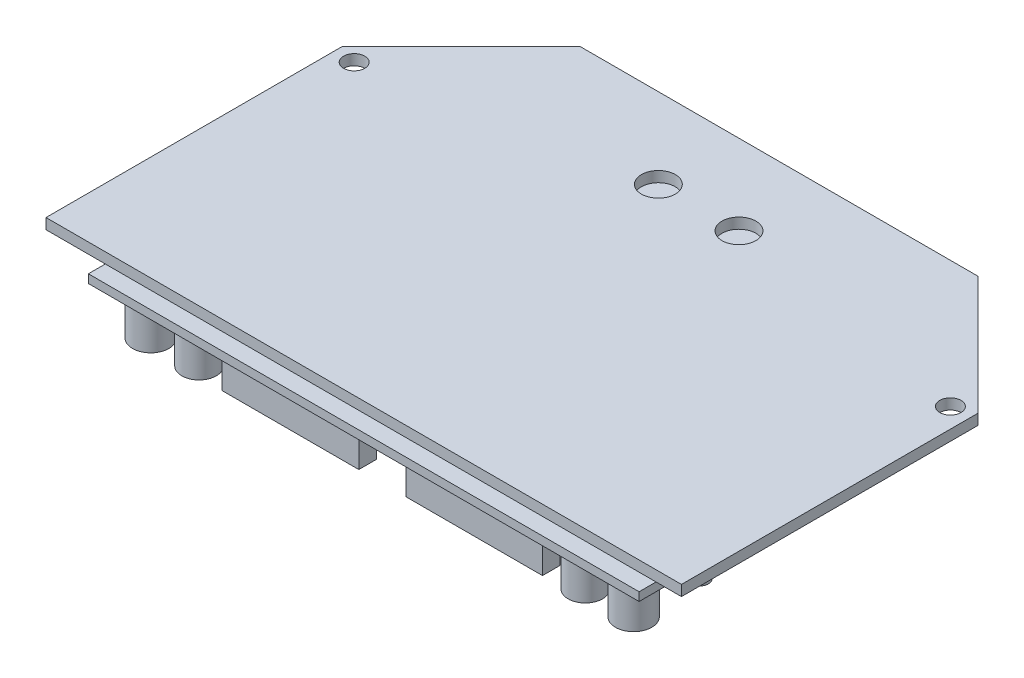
ISO-10303-21;
HEADER;
FILE_DESCRIPTION(('STEP AP214'),'2;1');
FILE_NAME('part.step','',(''),(''),'','','');
FILE_SCHEMA(('AUTOMOTIVE_DESIGN { 1 0 10303 214 1 1 1 1 }'));
ENDSEC;
DATA;
#1=APPLICATION_CONTEXT('core data for automotive mechanical design processes');
#2=APPLICATION_PROTOCOL_DEFINITION('international standard','automotive_design',2000,#1);
#3=PRODUCT_CONTEXT('',#1,'mechanical');
#4=PRODUCT('Part','Part','',(#3));
#5=PRODUCT_RELATED_PRODUCT_CATEGORY('part','',(#4));
#6=PRODUCT_DEFINITION_FORMATION('','',#4);
#7=PRODUCT_DEFINITION_CONTEXT('part definition',#1,'design');
#8=PRODUCT_DEFINITION('design','',#6,#7);
#9=PRODUCT_DEFINITION_SHAPE('','',#8);
#10=(LENGTH_UNIT() NAMED_UNIT(*) SI_UNIT(.MILLI.,.METRE.));
#11=(NAMED_UNIT(*) PLANE_ANGLE_UNIT() SI_UNIT($,.RADIAN.));
#12=(NAMED_UNIT(*) SI_UNIT($,.STERADIAN.) SOLID_ANGLE_UNIT());
#13=UNCERTAINTY_MEASURE_WITH_UNIT(LENGTH_MEASURE(1.E-05),#10,'distance_accuracy_value','');
#14=(GEOMETRIC_REPRESENTATION_CONTEXT(3) GLOBAL_UNCERTAINTY_ASSIGNED_CONTEXT((#13)) GLOBAL_UNIT_ASSIGNED_CONTEXT((#10,
#11,#12)) REPRESENTATION_CONTEXT('',''));
#15=CARTESIAN_POINT('',(0.,0.,0.));
#16=DIRECTION('',(0.,0.,1.));
#17=DIRECTION('',(1.,0.,0.));
#18=AXIS2_PLACEMENT_3D('',#15,#16,#17);
#19=CARTESIAN_POINT('',(0.,-8.5,0.));
#20=DIRECTION('',(0.,-1.,0.));
#21=DIRECTION('',(0.,0.,-1.));
#22=AXIS2_PLACEMENT_3D('',#19,#20,#21);
#23=PLANE('',#22);
#24=CARTESIAN_POINT('',(-45.5909299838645,-8.5,42.2798538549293));
#25=DIRECTION('',(0.,-1.,0.));
#26=DIRECTION('',(0.,0.,-1.));
#27=AXIS2_PLACEMENT_3D('',#24,#25,#26);
#28=CIRCLE('',#27,4.06515533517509);
#29=CARTESIAN_POINT('',(-45.5909299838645,-8.5,38.2146985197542));
#30=VERTEX_POINT('',#29);
#31=EDGE_CURVE('E221',#30,#30,#28,.T.);
#32=ORIENTED_EDGE('',*,*,#31,.F.);
#33=EDGE_LOOP('',(#32));
#34=FACE_BOUND('',#33,.T.);
#35=CARTESIAN_POINT('',(-56.9936964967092,-8.5,42.2798538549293));
#36=DIRECTION('',(0.,-1.,0.));
#37=DIRECTION('',(0.,0.,-1.));
#38=AXIS2_PLACEMENT_3D('',#35,#36,#37);
#39=CIRCLE('',#38,4.28874467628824);
#40=CARTESIAN_POINT('',(-56.9936964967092,-8.5,37.991109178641));
#41=VERTEX_POINT('',#40);
#42=EDGE_CURVE('E225',#41,#41,#39,.T.);
#43=ORIENTED_EDGE('',*,*,#42,.F.);
#44=EDGE_LOOP('',(#43));
#45=FACE_BOUND('',#44,.T.);
#46=CARTESIAN_POINT('',(-49.43838852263,-8.5,24.4947992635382));
#47=DIRECTION('',(0.,-1.,0.));
#48=DIRECTION('',(0.,0.,-1.));
#49=AXIS2_PLACEMENT_3D('',#46,#47,#48);
#50=CIRCLE('',#49,2.4163882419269);
#51=CARTESIAN_POINT('',(-49.43838852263,-8.5,22.0784110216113));
#52=VERTEX_POINT('',#51);
#53=EDGE_CURVE('E231',#52,#52,#50,.T.);
#54=ORIENTED_EDGE('',*,*,#53,.F.);
#55=EDGE_LOOP('',(#54));
#56=FACE_BOUND('',#55,.T.);
#57=CARTESIAN_POINT('',(-48.131652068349,-8.5,-10.0590210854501));
#58=DIRECTION('',(0.,-1.,0.));
#59=DIRECTION('',(0.,0.,-1.));
#60=AXIS2_PLACEMENT_3D('',#57,#58,#59);
#61=CIRCLE('',#60,4.57329975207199);
#62=CARTESIAN_POINT('',(-48.131652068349,-8.5,-14.6323208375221));
#63=VERTEX_POINT('',#62);
#64=EDGE_CURVE('E237',#63,#63,#61,.T.);
#65=ORIENTED_EDGE('',*,*,#64,.F.);
#66=EDGE_LOOP('',(#65));
#67=FACE_BOUND('',#66,.T.);
#68=CARTESIAN_POINT('',(-52.704951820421,-8.5,14.8400553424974));
#69=DIRECTION('',(0.,-1.,0.));
#70=DIRECTION('',(0.,0.,-1.));
#71=AXIS2_PLACEMENT_3D('',#68,#69,#70);
#72=CIRCLE('',#71,3.26656329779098);
#73=CARTESIAN_POINT('',(-52.704951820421,-8.5,11.5734920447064));
#74=VERTEX_POINT('',#73);
#75=EDGE_CURVE('E243',#74,#74,#72,.T.);
#76=ORIENTED_EDGE('',*,*,#75,.F.);
#77=EDGE_LOOP('',(#76));
#78=FACE_BOUND('',#77,.T.);
#79=CARTESIAN_POINT('',(-56.9936964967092,-8.5,26.7355299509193));
#80=DIRECTION('',(0.,-1.,0.));
#81=DIRECTION('',(0.,0.,-1.));
#82=AXIS2_PLACEMENT_3D('',#79,#80,#81);
#83=CIRCLE('',#82,2.0934696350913);
#84=CARTESIAN_POINT('',(-56.9936964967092,-8.5,24.642060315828));
#85=VERTEX_POINT('',#84);
#86=EDGE_CURVE('E249',#85,#85,#83,.T.);
#87=ORIENTED_EDGE('',*,*,#86,.F.);
#88=EDGE_LOOP('',(#87));
#89=FACE_BOUND('',#88,.T.);
#90=CARTESIAN_POINT('',(-56.2103338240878,-8.5,1.91201908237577));
#91=DIRECTION('',(0.,-1.,0.));
#92=DIRECTION('',(0.,0.,-1.));
#93=AXIS2_PLACEMENT_3D('',#90,#91,#92);
#94=CIRCLE('',#93,1.95840668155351);
#95=CARTESIAN_POINT('',(-56.2103338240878,-8.5,-0.0463875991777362));
#96=VERTEX_POINT('',#95);
#97=EDGE_CURVE('E255',#96,#96,#94,.T.);
#98=ORIENTED_EDGE('',*,*,#97,.F.);
#99=EDGE_LOOP('',(#98));
#100=FACE_BOUND('',#99,.T.);
#101=CARTESIAN_POINT('',(-37.8013110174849,-8.5,-22.2544870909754));
#102=DIRECTION('',(0.,-1.,0.));
#103=DIRECTION('',(0.,0.,-1.));
#104=AXIS2_PLACEMENT_3D('',#101,#102,#103);
#105=CIRCLE('',#104,1.5667253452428);
#106=CARTESIAN_POINT('',(-37.8013110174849,-8.5,-23.8212124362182));
#107=VERTEX_POINT('',#106);
#108=EDGE_CURVE('E261',#107,#107,#105,.T.);
#109=ORIENTED_EDGE('',*,*,#108,.F.);
#110=EDGE_LOOP('',(#109));
#111=FACE_BOUND('',#110,.T.);
#112=CARTESIAN_POINT('',(-10.8473948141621,-8.5,-14.8975113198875));
#113=DIRECTION('',(0.,-1.,0.));
#114=DIRECTION('',(0.,0.,-1.));
#115=AXIS2_PLACEMENT_3D('',#112,#113,#114);
#116=CIRCLE('',#115,3.91898876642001);
#117=CARTESIAN_POINT('',(-10.8473948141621,-8.5,-18.8165000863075));
#118=VERTEX_POINT('',#117);
#119=EDGE_CURVE('E267',#118,#118,#116,.T.);
#120=ORIENTED_EDGE('',*,*,#119,.F.);
#121=EDGE_LOOP('',(#120));
#122=FACE_BOUND('',#121,.T.);
#123=CARTESIAN_POINT('',(-22.1340575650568,-8.5,11.5734920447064));
#124=DIRECTION('',(0.,-1.,0.));
#125=DIRECTION('',(0.,0.,-1.));
#126=AXIS2_PLACEMENT_3D('',#123,#124,#125);
#127=CIRCLE('',#126,4.38885107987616);
#128=CARTESIAN_POINT('',(-22.1340575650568,-8.5,7.18464096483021));
#129=VERTEX_POINT('',#128);
#130=EDGE_CURVE('E273',#129,#129,#127,.T.);
#131=ORIENTED_EDGE('',*,*,#130,.F.);
#132=EDGE_LOOP('',(#131));
#133=FACE_BOUND('',#132,.T.);
#134=CARTESIAN_POINT('',(-10.8473948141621,-8.5,-39.0837833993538));
#135=DIRECTION('',(0.,-1.,0.));
#136=DIRECTION('',(0.,0.,-1.));
#137=AXIS2_PLACEMENT_3D('',#134,#135,#136);
#138=CIRCLE('',#137,4.56961559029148);
#139=CARTESIAN_POINT('',(-10.8473948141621,-8.5,-43.6533989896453));
#140=VERTEX_POINT('',#139);
#141=EDGE_CURVE('E279',#140,#140,#138,.T.);
#142=ORIENTED_EDGE('',*,*,#141,.F.);
#143=EDGE_LOOP('',(#142));
#144=FACE_BOUND('',#143,.T.);
#145=CARTESIAN_POINT('',(-25.8966307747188,-8.5,-39.0837833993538));
#146=DIRECTION('',(0.,-1.,0.));
#147=DIRECTION('',(0.,0.,-1.));
#148=AXIS2_PLACEMENT_3D('',#145,#146,#147);
#149=CIRCLE('',#148,4.68746547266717);
#150=CARTESIAN_POINT('',(-25.8966307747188,-8.5,-43.771248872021));
#151=VERTEX_POINT('',#150);
#152=EDGE_CURVE('E285',#151,#151,#149,.T.);
#153=ORIENTED_EDGE('',*,*,#152,.F.);
#154=EDGE_LOOP('',(#153));
#155=FACE_BOUND('',#154,.T.);
#156=DIRECTION('',(-1.,0.,0.));
#157=VECTOR('',#156,1.);
#158=CARTESIAN_POINT('',(0.,-8.5,49.));
#159=LINE('',#158,#157);
#160=CARTESIAN_POINT('',(65.,-8.5,49.));
#161=VERTEX_POINT('',#160);
#162=CARTESIAN_POINT('',(-65.,-8.5,49.));
#163=VERTEX_POINT('',#162);
#164=EDGE_CURVE('E321',#161,#163,#159,.T.);
#165=ORIENTED_EDGE('',*,*,#164,.T.);
#166=DIRECTION('',(0.,0.,-1.));
#167=VECTOR('',#166,1.);
#168=CARTESIAN_POINT('',(-65.,-8.5,49.));
#169=LINE('',#168,#167);
#170=CARTESIAN_POINT('',(-65.,-8.5,-12.6152236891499));
#171=VERTEX_POINT('',#170);
#172=EDGE_CURVE('E90',#163,#171,#169,.T.);
#173=ORIENTED_EDGE('',*,*,#172,.T.);
#174=DIRECTION('',(0.707106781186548,0.,-0.707106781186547));
#175=VECTOR('',#174,1.);
#176=CARTESIAN_POINT('',(-65.,-8.5,-12.6152236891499));
#177=LINE('',#176,#175);
#178=CARTESIAN_POINT('',(-28.6152236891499,-8.5,-49.));
#179=VERTEX_POINT('',#178);
#180=EDGE_CURVE('E68',#171,#179,#177,.T.);
#181=ORIENTED_EDGE('',*,*,#180,.T.);
#182=DIRECTION('',(1.,0.,0.));
#183=VECTOR('',#182,1.);
#184=CARTESIAN_POINT('',(-28.6152236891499,-8.5,-49.));
#185=LINE('',#184,#183);
#186=CARTESIAN_POINT('',(28.6152236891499,-8.5,-49.));
#187=VERTEX_POINT('',#186);
#188=EDGE_CURVE('E326',#179,#187,#185,.T.);
#189=ORIENTED_EDGE('',*,*,#188,.T.);
#190=DIRECTION('',(-0.707106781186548,0.,-0.707106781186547));
#191=VECTOR('',#190,1.);
#192=CARTESIAN_POINT('',(65.,-8.5,-12.6152236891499));
#193=LINE('',#192,#191);
#194=CARTESIAN_POINT('',(65.,-8.5,-12.6152236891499));
#195=VERTEX_POINT('',#194);
#196=EDGE_CURVE('E204',#195,#187,#193,.T.);
#197=ORIENTED_EDGE('',*,*,#196,.F.);
#198=DIRECTION('',(0.,0.,-1.));
#199=VECTOR('',#198,1.);
#200=CARTESIAN_POINT('',(65.,-8.5,49.));
#201=LINE('',#200,#199);
#202=EDGE_CURVE('E201',#161,#195,#201,.T.);
#203=ORIENTED_EDGE('',*,*,#202,.F.);
#204=EDGE_LOOP('',(#165,#173,#181,#189,#197,#203));
#205=FACE_BOUND('',#204,.T.);
#206=DIRECTION('',(1.,0.,0.));
#207=VECTOR('',#206,1.);
#208=CARTESIAN_POINT('',(-37.8013110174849,-8.5,40.4273504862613));
#209=LINE('',#208,#207);
#210=CARTESIAN_POINT('',(-37.8013110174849,-8.5,40.4273504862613));
#211=VERTEX_POINT('',#210);
#212=CARTESIAN_POINT('',(-5.55288099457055,-8.5,40.4273504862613));
#213=VERTEX_POINT('',#212);
#214=EDGE_CURVE('E307',#211,#213,#209,.T.);
#215=ORIENTED_EDGE('',*,*,#214,.F.);
#216=DIRECTION('',(0.,0.,-1.));
#217=VECTOR('',#216,1.);
#218=CARTESIAN_POINT('',(-37.8013110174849,-8.5,44.6052847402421));
#219=LINE('',#218,#217);
#220=CARTESIAN_POINT('',(-37.8013110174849,-8.5,44.6052847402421));
#221=VERTEX_POINT('',#220);
#222=EDGE_CURVE('E291',#221,#211,#219,.T.);
#223=ORIENTED_EDGE('',*,*,#222,.F.);
#224=DIRECTION('',(-1.,0.,0.));
#225=VECTOR('',#224,1.);
#226=CARTESIAN_POINT('',(-37.8013110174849,-8.5,44.6052847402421));
#227=LINE('',#226,#225);
#228=CARTESIAN_POINT('',(-5.55288099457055,-8.5,44.6052847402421));
#229=VERTEX_POINT('',#228);
#230=EDGE_CURVE('E298',#229,#221,#227,.T.);
#231=ORIENTED_EDGE('',*,*,#230,.F.);
#232=DIRECTION('',(0.,0.,1.));
#233=VECTOR('',#232,1.);
#234=CARTESIAN_POINT('',(-5.55288099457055,-8.5,44.6052847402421));
#235=LINE('',#234,#233);
#236=EDGE_CURVE('E309',#213,#229,#235,.T.);
#237=ORIENTED_EDGE('',*,*,#236,.F.);
#238=EDGE_LOOP('',(#215,#223,#231,#237));
#239=FACE_BOUND('',#238,.T.);
#240=CARTESIAN_POINT('',(45.5909299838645,-8.5,42.2798538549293));
#241=DIRECTION('',(0.,1.,0.));
#242=DIRECTION('',(0.,0.,-1.));
#243=AXIS2_PLACEMENT_3D('',#240,#241,#242);
#244=CIRCLE('',#243,4.06515533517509);
#245=CARTESIAN_POINT('',(45.5909299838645,-8.5,38.2146985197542));
#246=VERTEX_POINT('',#245);
#247=EDGE_CURVE('E1025',#246,#246,#244,.T.);
#248=ORIENTED_EDGE('',*,*,#247,.T.);
#249=EDGE_LOOP('',(#248));
#250=FACE_BOUND('',#249,.T.);
#251=CARTESIAN_POINT('',(56.9936964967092,-8.5,42.2798538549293));
#252=DIRECTION('',(0.,1.,0.));
#253=DIRECTION('',(0.,0.,-1.));
#254=AXIS2_PLACEMENT_3D('',#251,#252,#253);
#255=CIRCLE('',#254,4.28874467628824);
#256=CARTESIAN_POINT('',(56.9936964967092,-8.5,37.991109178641));
#257=VERTEX_POINT('',#256);
#258=EDGE_CURVE('E1024',#257,#257,#255,.T.);
#259=ORIENTED_EDGE('',*,*,#258,.T.);
#260=EDGE_LOOP('',(#259));
#261=FACE_BOUND('',#260,.T.);
#262=CARTESIAN_POINT('',(49.43838852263,-8.5,24.4947992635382));
#263=DIRECTION('',(0.,1.,0.));
#264=DIRECTION('',(0.,0.,-1.));
#265=AXIS2_PLACEMENT_3D('',#262,#263,#264);
#266=CIRCLE('',#265,2.4163882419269);
#267=CARTESIAN_POINT('',(49.43838852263,-8.5,22.0784110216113));
#268=VERTEX_POINT('',#267);
#269=EDGE_CURVE('E1034',#268,#268,#266,.T.);
#270=ORIENTED_EDGE('',*,*,#269,.T.);
#271=EDGE_LOOP('',(#270));
#272=FACE_BOUND('',#271,.T.);
#273=CARTESIAN_POINT('',(48.131652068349,-8.5,-10.0590210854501));
#274=DIRECTION('',(0.,1.,0.));
#275=DIRECTION('',(0.,0.,-1.));
#276=AXIS2_PLACEMENT_3D('',#273,#274,#275);
#277=CIRCLE('',#276,4.57329975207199);
#278=CARTESIAN_POINT('',(48.131652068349,-8.5,-14.6323208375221));
#279=VERTEX_POINT('',#278);
#280=EDGE_CURVE('E1039',#279,#279,#277,.T.);
#281=ORIENTED_EDGE('',*,*,#280,.T.);
#282=EDGE_LOOP('',(#281));
#283=FACE_BOUND('',#282,.T.);
#284=CARTESIAN_POINT('',(52.704951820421,-8.5,14.8400553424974));
#285=DIRECTION('',(0.,1.,0.));
#286=DIRECTION('',(0.,0.,-1.));
#287=AXIS2_PLACEMENT_3D('',#284,#285,#286);
#288=CIRCLE('',#287,3.26656329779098);
#289=CARTESIAN_POINT('',(52.704951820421,-8.5,11.5734920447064));
#290=VERTEX_POINT('',#289);
#291=EDGE_CURVE('E1045',#290,#290,#288,.T.);
#292=ORIENTED_EDGE('',*,*,#291,.T.);
#293=EDGE_LOOP('',(#292));
#294=FACE_BOUND('',#293,.T.);
#295=CARTESIAN_POINT('',(56.9936964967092,-8.5,26.7355299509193));
#296=DIRECTION('',(0.,1.,0.));
#297=DIRECTION('',(0.,0.,-1.));
#298=AXIS2_PLACEMENT_3D('',#295,#296,#297);
#299=CIRCLE('',#298,2.0934696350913);
#300=CARTESIAN_POINT('',(56.9936964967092,-8.5,24.642060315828));
#301=VERTEX_POINT('',#300);
#302=EDGE_CURVE('E1051',#301,#301,#299,.T.);
#303=ORIENTED_EDGE('',*,*,#302,.T.);
#304=EDGE_LOOP('',(#303));
#305=FACE_BOUND('',#304,.T.);
#306=CARTESIAN_POINT('',(56.2103338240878,-8.5,1.91201908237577));
#307=DIRECTION('',(0.,1.,0.));
#308=DIRECTION('',(0.,0.,-1.));
#309=AXIS2_PLACEMENT_3D('',#306,#307,#308);
#310=CIRCLE('',#309,1.95840668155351);
#311=CARTESIAN_POINT('',(56.2103338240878,-8.5,-0.0463875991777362));
#312=VERTEX_POINT('',#311);
#313=EDGE_CURVE('E1057',#312,#312,#310,.T.);
#314=ORIENTED_EDGE('',*,*,#313,.T.);
#315=EDGE_LOOP('',(#314));
#316=FACE_BOUND('',#315,.T.);
#317=CARTESIAN_POINT('',(37.8013110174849,-8.5,-22.2544870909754));
#318=DIRECTION('',(0.,1.,0.));
#319=DIRECTION('',(0.,0.,-1.));
#320=AXIS2_PLACEMENT_3D('',#317,#318,#319);
#321=CIRCLE('',#320,1.5667253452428);
#322=CARTESIAN_POINT('',(37.8013110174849,-8.5,-23.8212124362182));
#323=VERTEX_POINT('',#322);
#324=EDGE_CURVE('E1063',#323,#323,#321,.T.);
#325=ORIENTED_EDGE('',*,*,#324,.T.);
#326=EDGE_LOOP('',(#325));
#327=FACE_BOUND('',#326,.T.);
#328=CARTESIAN_POINT('',(10.8473948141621,-8.5,-14.8975113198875));
#329=DIRECTION('',(0.,1.,0.));
#330=DIRECTION('',(0.,0.,-1.));
#331=AXIS2_PLACEMENT_3D('',#328,#329,#330);
#332=CIRCLE('',#331,3.91898876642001);
#333=CARTESIAN_POINT('',(10.8473948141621,-8.5,-18.8165000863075));
#334=VERTEX_POINT('',#333);
#335=EDGE_CURVE('E1069',#334,#334,#332,.T.);
#336=ORIENTED_EDGE('',*,*,#335,.T.);
#337=EDGE_LOOP('',(#336));
#338=FACE_BOUND('',#337,.T.);
#339=CARTESIAN_POINT('',(22.1340575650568,-8.5,11.5734920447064));
#340=DIRECTION('',(0.,1.,0.));
#341=DIRECTION('',(0.,0.,-1.));
#342=AXIS2_PLACEMENT_3D('',#339,#340,#341);
#343=CIRCLE('',#342,4.38885107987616);
#344=CARTESIAN_POINT('',(22.1340575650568,-8.5,7.18464096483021));
#345=VERTEX_POINT('',#344);
#346=EDGE_CURVE('E1075',#345,#345,#343,.T.);
#347=ORIENTED_EDGE('',*,*,#346,.T.);
#348=EDGE_LOOP('',(#347));
#349=FACE_BOUND('',#348,.T.);
#350=CARTESIAN_POINT('',(10.8473948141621,-8.5,-39.0837833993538));
#351=DIRECTION('',(0.,1.,0.));
#352=DIRECTION('',(0.,0.,-1.));
#353=AXIS2_PLACEMENT_3D('',#350,#351,#352);
#354=CIRCLE('',#353,4.56961559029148);
#355=CARTESIAN_POINT('',(10.8473948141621,-8.5,-43.6533989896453));
#356=VERTEX_POINT('',#355);
#357=EDGE_CURVE('E1081',#356,#356,#354,.T.);
#358=ORIENTED_EDGE('',*,*,#357,.T.);
#359=EDGE_LOOP('',(#358));
#360=FACE_BOUND('',#359,.T.);
#361=CARTESIAN_POINT('',(25.8966307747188,-8.5,-39.0837833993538));
#362=DIRECTION('',(0.,1.,0.));
#363=DIRECTION('',(0.,0.,-1.));
#364=AXIS2_PLACEMENT_3D('',#361,#362,#363);
#365=CIRCLE('',#364,4.68746547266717);
#366=CARTESIAN_POINT('',(25.8966307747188,-8.5,-43.771248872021));
#367=VERTEX_POINT('',#366);
#368=EDGE_CURVE('E185',#367,#367,#365,.T.);
#369=ORIENTED_EDGE('',*,*,#368,.T.);
#370=EDGE_LOOP('',(#369));
#371=FACE_BOUND('',#370,.T.);
#372=DIRECTION('',(-1.,0.,0.));
#373=VECTOR('',#372,1.);
#374=CARTESIAN_POINT('',(37.8013110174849,-8.5,40.4273504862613));
#375=LINE('',#374,#373);
#376=CARTESIAN_POINT('',(37.8013110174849,-8.5,40.4273504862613));
#377=VERTEX_POINT('',#376);
#378=CARTESIAN_POINT('',(5.55288099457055,-8.5,40.4273504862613));
#379=VERTEX_POINT('',#378);
#380=EDGE_CURVE('E170',#377,#379,#375,.T.);
#381=ORIENTED_EDGE('',*,*,#380,.T.);
#382=DIRECTION('',(0.,0.,1.));
#383=VECTOR('',#382,1.);
#384=CARTESIAN_POINT('',(5.55288099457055,-8.5,44.6052847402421));
#385=LINE('',#384,#383);
#386=CARTESIAN_POINT('',(5.55288099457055,-8.5,44.6052847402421));
#387=VERTEX_POINT('',#386);
#388=EDGE_CURVE('E182',#379,#387,#385,.T.);
#389=ORIENTED_EDGE('',*,*,#388,.T.);
#390=DIRECTION('',(1.,0.,0.));
#391=VECTOR('',#390,1.);
#392=CARTESIAN_POINT('',(37.8013110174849,-8.5,44.6052847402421));
#393=LINE('',#392,#391);
#394=CARTESIAN_POINT('',(37.8013110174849,-8.5,44.6052847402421));
#395=VERTEX_POINT('',#394);
#396=EDGE_CURVE('E179',#387,#395,#393,.T.);
#397=ORIENTED_EDGE('',*,*,#396,.T.);
#398=DIRECTION('',(0.,0.,-1.));
#399=VECTOR('',#398,1.);
#400=CARTESIAN_POINT('',(37.8013110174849,-8.5,44.6052847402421));
#401=LINE('',#400,#399);
#402=EDGE_CURVE('E191',#395,#377,#401,.T.);
#403=ORIENTED_EDGE('',*,*,#402,.T.);
#404=EDGE_LOOP('',(#381,#389,#397,#403));
#405=FACE_BOUND('',#404,.T.);
#406=ADVANCED_FACE('F44',(#34,#45,#56,#67,#78,#89,#100,#111,#122,#133,#144,#155,#205,#239,#250,
#261,#272,#283,#294,#305,#316,#327,#338,#349,#360,#371,#405),#23,.T.);
#407=CARTESIAN_POINT('',(0.,-8.5,49.));
#408=DIRECTION('',(0.,0.,-1.));
#409=DIRECTION('',(-1.,0.,0.));
#410=AXIS2_PLACEMENT_3D('',#407,#408,#409);
#411=PLANE('',#410);
#412=DIRECTION('',(-1.,0.,0.));
#413=VECTOR('',#412,1.);
#414=CARTESIAN_POINT('',(0.,-6.5,49.));
#415=LINE('',#414,#413);
#416=CARTESIAN_POINT('',(65.,-6.5,49.));
#417=VERTEX_POINT('',#416);
#418=CARTESIAN_POINT('',(-65.,-6.5,49.));
#419=VERTEX_POINT('',#418);
#420=EDGE_CURVE('E320',#417,#419,#415,.T.);
#421=ORIENTED_EDGE('',*,*,#420,.T.);
#422=DIRECTION('',(0.,1.,0.));
#423=VECTOR('',#422,1.);
#424=CARTESIAN_POINT('',(-65.,-8.5,49.));
#425=LINE('',#424,#423);
#426=EDGE_CURVE('E12',#163,#419,#425,.T.);
#427=ORIENTED_EDGE('',*,*,#426,.F.);
#428=ORIENTED_EDGE('',*,*,#164,.F.);
#429=DIRECTION('',(0.,1.,0.));
#430=VECTOR('',#429,1.);
#431=CARTESIAN_POINT('',(65.,-8.5,49.));
#432=LINE('',#431,#430);
#433=EDGE_CURVE('E218',#161,#417,#432,.T.);
#434=ORIENTED_EDGE('',*,*,#433,.T.);
#435=EDGE_LOOP('',(#421,#427,#428,#434));
#436=FACE_BOUND('',#435,.T.);
#437=ADVANCED_FACE('F46',(#436),#411,.F.);
#438=CARTESIAN_POINT('',(-65.,-8.5,49.));
#439=DIRECTION('',(1.,0.,0.));
#440=DIRECTION('',(0.,0.,-1.));
#441=AXIS2_PLACEMENT_3D('',#438,#439,#440);
#442=PLANE('',#441);
#443=DIRECTION('',(0.,0.,-1.));
#444=VECTOR('',#443,1.);
#445=CARTESIAN_POINT('',(-65.,-6.5,49.));
#446=LINE('',#445,#444);
#447=CARTESIAN_POINT('',(-65.,-6.5,-12.6152236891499));
#448=VERTEX_POINT('',#447);
#449=EDGE_CURVE('E331',#419,#448,#446,.T.);
#450=ORIENTED_EDGE('',*,*,#449,.T.);
#451=DIRECTION('',(0.,1.,0.));
#452=VECTOR('',#451,1.);
#453=CARTESIAN_POINT('',(-65.,-8.5,-12.6152236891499));
#454=LINE('',#453,#452);
#455=EDGE_CURVE('E52',#171,#448,#454,.T.);
#456=ORIENTED_EDGE('',*,*,#455,.F.);
#457=ORIENTED_EDGE('',*,*,#172,.F.);
#458=ORIENTED_EDGE('',*,*,#426,.T.);
#459=EDGE_LOOP('',(#450,#456,#457,#458));
#460=FACE_BOUND('',#459,.T.);
#461=ADVANCED_FACE('F354',(#460),#442,.F.);
#462=CARTESIAN_POINT('',(-65.,-8.5,-12.6152236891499));
#463=DIRECTION('',(0.707106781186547,0.,0.707106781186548));
#464=DIRECTION('',(0.707106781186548,0.,-0.707106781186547));
#465=AXIS2_PLACEMENT_3D('',#462,#463,#464);
#466=PLANE('',#465);
#467=DIRECTION('',(0.707106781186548,0.,-0.707106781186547));
#468=VECTOR('',#467,1.);
#469=CARTESIAN_POINT('',(-65.,-6.5,-12.6152236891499));
#470=LINE('',#469,#468);
#471=CARTESIAN_POINT('',(-28.6152236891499,-6.5,-49.));
#472=VERTEX_POINT('',#471);
#473=EDGE_CURVE('E85',#448,#472,#470,.T.);
#474=ORIENTED_EDGE('',*,*,#473,.T.);
#475=DIRECTION('',(0.,1.,0.));
#476=VECTOR('',#475,1.);
#477=CARTESIAN_POINT('',(-28.6152236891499,-8.5,-49.));
#478=LINE('',#477,#476);
#479=EDGE_CURVE('E328',#179,#472,#478,.T.);
#480=ORIENTED_EDGE('',*,*,#479,.F.);
#481=ORIENTED_EDGE('',*,*,#180,.F.);
#482=ORIENTED_EDGE('',*,*,#455,.T.);
#483=EDGE_LOOP('',(#474,#480,#481,#482));
#484=FACE_BOUND('',#483,.T.);
#485=ADVANCED_FACE('F335',(#484),#466,.F.);
#486=CARTESIAN_POINT('',(-28.6152236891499,-8.5,-49.));
#487=DIRECTION('',(0.,0.,1.));
#488=DIRECTION('',(1.,0.,0.));
#489=AXIS2_PLACEMENT_3D('',#486,#487,#488);
#490=PLANE('',#489);
#491=DIRECTION('',(1.,0.,0.));
#492=VECTOR('',#491,1.);
#493=CARTESIAN_POINT('',(-28.6152236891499,-6.5,-49.));
#494=LINE('',#493,#492);
#495=CARTESIAN_POINT('',(28.6152236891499,-6.5,-49.));
#496=VERTEX_POINT('',#495);
#497=EDGE_CURVE('E323',#472,#496,#494,.T.);
#498=ORIENTED_EDGE('',*,*,#497,.T.);
#499=DIRECTION('',(0.,1.,0.));
#500=VECTOR('',#499,1.);
#501=CARTESIAN_POINT('',(28.6152236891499,-8.5,-49.));
#502=LINE('',#501,#500);
#503=EDGE_CURVE('E208',#187,#496,#502,.T.);
#504=ORIENTED_EDGE('',*,*,#503,.F.);
#505=ORIENTED_EDGE('',*,*,#188,.F.);
#506=ORIENTED_EDGE('',*,*,#479,.T.);
#507=EDGE_LOOP('',(#498,#504,#505,#506));
#508=FACE_BOUND('',#507,.T.);
#509=ADVANCED_FACE('F341',(#508),#490,.F.);
#510=CARTESIAN_POINT('',(0.,-6.5,0.));
#511=DIRECTION('',(0.,-1.,0.));
#512=DIRECTION('',(0.,0.,-1.));
#513=AXIS2_PLACEMENT_3D('',#510,#511,#512);
#514=PLANE('',#513);
#515=ORIENTED_EDGE('',*,*,#420,.F.);
#516=DIRECTION('',(0.,0.,-1.));
#517=VECTOR('',#516,1.);
#518=CARTESIAN_POINT('',(65.,-6.5,49.));
#519=LINE('',#518,#517);
#520=CARTESIAN_POINT('',(65.,-6.5,-12.6152236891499));
#521=VERTEX_POINT('',#520);
#522=EDGE_CURVE('E174',#417,#521,#519,.T.);
#523=ORIENTED_EDGE('',*,*,#522,.T.);
#524=DIRECTION('',(-0.707106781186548,0.,-0.707106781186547));
#525=VECTOR('',#524,1.);
#526=CARTESIAN_POINT('',(65.,-6.5,-12.6152236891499));
#527=LINE('',#526,#525);
#528=EDGE_CURVE('E205',#521,#496,#527,.T.);
#529=ORIENTED_EDGE('',*,*,#528,.T.);
#530=ORIENTED_EDGE('',*,*,#497,.F.);
#531=ORIENTED_EDGE('',*,*,#473,.F.);
#532=ORIENTED_EDGE('',*,*,#449,.F.);
#533=EDGE_LOOP('',(#515,#523,#529,#530,#531,#532));
#534=FACE_BOUND('',#533,.T.);
#535=ADVANCED_FACE('F338',(#534),#514,.F.);
#536=CARTESIAN_POINT('',(-37.8013110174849,-19.,44.6052847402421));
#537=DIRECTION('',(1.,0.,0.));
#538=DIRECTION('',(0.,0.,-1.));
#539=AXIS2_PLACEMENT_3D('',#536,#537,#538);
#540=PLANE('',#539);
#541=ORIENTED_EDGE('',*,*,#222,.T.);
#542=DIRECTION('',(0.,1.,0.));
#543=VECTOR('',#542,1.);
#544=CARTESIAN_POINT('',(-37.8013110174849,-19.,40.4273504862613));
#545=LINE('',#544,#543);
#546=CARTESIAN_POINT('',(-37.8013110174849,-19.,40.4273504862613));
#547=VERTEX_POINT('',#546);
#548=EDGE_CURVE('E318',#547,#211,#545,.T.);
#549=ORIENTED_EDGE('',*,*,#548,.F.);
#550=DIRECTION('',(0.,0.,-1.));
#551=VECTOR('',#550,1.);
#552=CARTESIAN_POINT('',(-37.8013110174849,-19.,44.6052847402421));
#553=LINE('',#552,#551);
#554=CARTESIAN_POINT('',(-37.8013110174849,-19.,44.6052847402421));
#555=VERTEX_POINT('',#554);
#556=EDGE_CURVE('E294',#555,#547,#553,.T.);
#557=ORIENTED_EDGE('',*,*,#556,.F.);
#558=DIRECTION('',(0.,1.,0.));
#559=VECTOR('',#558,1.);
#560=CARTESIAN_POINT('',(-37.8013110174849,-19.,44.6052847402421));
#561=LINE('',#560,#559);
#562=EDGE_CURVE('E304',#555,#221,#561,.T.);
#563=ORIENTED_EDGE('',*,*,#562,.T.);
#564=EDGE_LOOP('',(#541,#549,#557,#563));
#565=FACE_BOUND('',#564,.T.);
#566=ADVANCED_FACE('F370',(#565),#540,.F.);
#567=CARTESIAN_POINT('',(-37.8013110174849,-19.,40.4273504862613));
#568=DIRECTION('',(0.,0.,1.));
#569=DIRECTION('',(1.,0.,0.));
#570=AXIS2_PLACEMENT_3D('',#567,#568,#569);
#571=PLANE('',#570);
#572=ORIENTED_EDGE('',*,*,#214,.T.);
#573=DIRECTION('',(0.,1.,0.));
#574=VECTOR('',#573,1.);
#575=CARTESIAN_POINT('',(-5.55288099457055,-19.,40.4273504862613));
#576=LINE('',#575,#574);
#577=CARTESIAN_POINT('',(-5.55288099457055,-19.,40.4273504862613));
#578=VERTEX_POINT('',#577);
#579=EDGE_CURVE('E315',#578,#213,#576,.T.);
#580=ORIENTED_EDGE('',*,*,#579,.F.);
#581=DIRECTION('',(1.,0.,0.));
#582=VECTOR('',#581,1.);
#583=CARTESIAN_POINT('',(-37.8013110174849,-19.,40.4273504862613));
#584=LINE('',#583,#582);
#585=EDGE_CURVE('E297',#547,#578,#584,.T.);
#586=ORIENTED_EDGE('',*,*,#585,.F.);
#587=ORIENTED_EDGE('',*,*,#548,.T.);
#588=EDGE_LOOP('',(#572,#580,#586,#587));
#589=FACE_BOUND('',#588,.T.);
#590=ADVANCED_FACE('F391',(#589),#571,.F.);
#591=CARTESIAN_POINT('',(-5.55288099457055,-19.,44.6052847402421));
#592=DIRECTION('',(-1.,0.,0.));
#593=DIRECTION('',(0.,0.,1.));
#594=AXIS2_PLACEMENT_3D('',#591,#592,#593);
#595=PLANE('',#594);
#596=ORIENTED_EDGE('',*,*,#236,.T.);
#597=DIRECTION('',(0.,1.,0.));
#598=VECTOR('',#597,1.);
#599=CARTESIAN_POINT('',(-5.55288099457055,-19.,44.6052847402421));
#600=LINE('',#599,#598);
#601=CARTESIAN_POINT('',(-5.55288099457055,-19.,44.6052847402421));
#602=VERTEX_POINT('',#601);
#603=EDGE_CURVE('E59',#602,#229,#600,.T.);
#604=ORIENTED_EDGE('',*,*,#603,.F.);
#605=DIRECTION('',(0.,0.,1.));
#606=VECTOR('',#605,1.);
#607=CARTESIAN_POINT('',(-5.55288099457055,-19.,44.6052847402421));
#608=LINE('',#607,#606);
#609=EDGE_CURVE('E300',#578,#602,#608,.T.);
#610=ORIENTED_EDGE('',*,*,#609,.F.);
#611=ORIENTED_EDGE('',*,*,#579,.T.);
#612=EDGE_LOOP('',(#596,#604,#610,#611));
#613=FACE_BOUND('',#612,.T.);
#614=ADVANCED_FACE('F398',(#613),#595,.F.);
#615=CARTESIAN_POINT('',(-37.8013110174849,-19.,44.6052847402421));
#616=DIRECTION('',(0.,0.,-1.));
#617=DIRECTION('',(-1.,0.,0.));
#618=AXIS2_PLACEMENT_3D('',#615,#616,#617);
#619=PLANE('',#618);
#620=ORIENTED_EDGE('',*,*,#230,.T.);
#621=ORIENTED_EDGE('',*,*,#562,.F.);
#622=DIRECTION('',(-1.,0.,0.));
#623=VECTOR('',#622,1.);
#624=CARTESIAN_POINT('',(-37.8013110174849,-19.,44.6052847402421));
#625=LINE('',#624,#623);
#626=EDGE_CURVE('E302',#602,#555,#625,.T.);
#627=ORIENTED_EDGE('',*,*,#626,.F.);
#628=ORIENTED_EDGE('',*,*,#603,.T.);
#629=EDGE_LOOP('',(#620,#621,#627,#628));
#630=FACE_BOUND('',#629,.T.);
#631=ADVANCED_FACE('F405',(#630),#619,.F.);
#632=CARTESIAN_POINT('',(0.,-19.,0.));
#633=DIRECTION('',(0.,-1.,0.));
#634=DIRECTION('',(0.,0.,-1.));
#635=AXIS2_PLACEMENT_3D('',#632,#633,#634);
#636=PLANE('',#635);
#637=ORIENTED_EDGE('',*,*,#556,.T.);
#638=ORIENTED_EDGE('',*,*,#585,.T.);
#639=ORIENTED_EDGE('',*,*,#609,.T.);
#640=ORIENTED_EDGE('',*,*,#626,.T.);
#641=EDGE_LOOP('',(#637,#638,#639,#640));
#642=FACE_BOUND('',#641,.T.);
#643=ADVANCED_FACE('F413',(#642),#636,.T.);
#644=CARTESIAN_POINT('',(-25.8966307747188,-19.,-39.0837833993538));
#645=DIRECTION('',(0.,1.,0.));
#646=DIRECTION('',(0.,0.,1.));
#647=AXIS2_PLACEMENT_3D('',#644,#645,#646);
#648=CYLINDRICAL_SURFACE('',#647,4.68746547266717);
#649=CARTESIAN_POINT('',(-25.8966307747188,-19.,-39.0837833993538));
#650=DIRECTION('',(0.,-1.,0.));
#651=DIRECTION('',(0.,0.,-1.));
#652=AXIS2_PLACEMENT_3D('',#649,#650,#651);
#653=CIRCLE('',#652,4.68746547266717);
#654=CARTESIAN_POINT('',(-25.8966307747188,-19.,-43.771248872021));
#655=VERTEX_POINT('',#654);
#656=EDGE_CURVE('E288',#655,#655,#653,.T.);
#657=ORIENTED_EDGE('',*,*,#656,.F.);
#658=EDGE_LOOP('',(#657));
#659=FACE_BOUND('',#658,.T.);
#660=ORIENTED_EDGE('',*,*,#152,.T.);
#661=EDGE_LOOP('',(#660));
#662=FACE_BOUND('',#661,.T.);
#663=ADVANCED_FACE('F420',(#659,#662),#648,.T.);
#664=CARTESIAN_POINT('',(-25.8966307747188,-19.,-39.0837833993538));
#665=DIRECTION('',(0.,-1.,0.));
#666=DIRECTION('',(0.,0.,-1.));
#667=AXIS2_PLACEMENT_3D('',#664,#665,#666);
#668=PLANE('',#667);
#669=ORIENTED_EDGE('',*,*,#656,.T.);
#670=EDGE_LOOP('',(#669));
#671=FACE_BOUND('',#670,.T.);
#672=ADVANCED_FACE('F428',(#671),#668,.T.);
#673=CARTESIAN_POINT('',(-10.8473948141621,-19.,-39.0837833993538));
#674=DIRECTION('',(0.,1.,0.));
#675=DIRECTION('',(0.,0.,1.));
#676=AXIS2_PLACEMENT_3D('',#673,#674,#675);
#677=CYLINDRICAL_SURFACE('',#676,4.56961559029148);
#678=CARTESIAN_POINT('',(-10.8473948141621,-19.,-39.0837833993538));
#679=DIRECTION('',(0.,-1.,0.));
#680=DIRECTION('',(0.,0.,-1.));
#681=AXIS2_PLACEMENT_3D('',#678,#679,#680);
#682=CIRCLE('',#681,4.56961559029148);
#683=CARTESIAN_POINT('',(-10.8473948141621,-19.,-43.6533989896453));
#684=VERTEX_POINT('',#683);
#685=EDGE_CURVE('E282',#684,#684,#682,.T.);
#686=ORIENTED_EDGE('',*,*,#685,.F.);
#687=EDGE_LOOP('',(#686));
#688=FACE_BOUND('',#687,.T.);
#689=ORIENTED_EDGE('',*,*,#141,.T.);
#690=EDGE_LOOP('',(#689));
#691=FACE_BOUND('',#690,.T.);
#692=ADVANCED_FACE('F436',(#688,#691),#677,.T.);
#693=CARTESIAN_POINT('',(-10.8473948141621,-19.,-39.0837833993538));
#694=DIRECTION('',(0.,-1.,0.));
#695=DIRECTION('',(0.,0.,-1.));
#696=AXIS2_PLACEMENT_3D('',#693,#694,#695);
#697=PLANE('',#696);
#698=ORIENTED_EDGE('',*,*,#685,.T.);
#699=EDGE_LOOP('',(#698));
#700=FACE_BOUND('',#699,.T.);
#701=ADVANCED_FACE('F444',(#700),#697,.T.);
#702=CARTESIAN_POINT('',(-22.1340575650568,-19.,11.5734920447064));
#703=DIRECTION('',(0.,1.,0.));
#704=DIRECTION('',(0.,0.,1.));
#705=AXIS2_PLACEMENT_3D('',#702,#703,#704);
#706=CYLINDRICAL_SURFACE('',#705,4.38885107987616);
#707=CARTESIAN_POINT('',(-22.1340575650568,-19.,11.5734920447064));
#708=DIRECTION('',(0.,-1.,0.));
#709=DIRECTION('',(0.,0.,-1.));
#710=AXIS2_PLACEMENT_3D('',#707,#708,#709);
#711=CIRCLE('',#710,4.38885107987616);
#712=CARTESIAN_POINT('',(-22.1340575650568,-19.,7.18464096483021));
#713=VERTEX_POINT('',#712);
#714=EDGE_CURVE('E276',#713,#713,#711,.T.);
#715=ORIENTED_EDGE('',*,*,#714,.F.);
#716=EDGE_LOOP('',(#715));
#717=FACE_BOUND('',#716,.T.);
#718=ORIENTED_EDGE('',*,*,#130,.T.);
#719=EDGE_LOOP('',(#718));
#720=FACE_BOUND('',#719,.T.);
#721=ADVANCED_FACE('F452',(#717,#720),#706,.T.);
#722=CARTESIAN_POINT('',(-22.1340575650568,-19.,11.5734920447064));
#723=DIRECTION('',(0.,-1.,0.));
#724=DIRECTION('',(0.,0.,-1.));
#725=AXIS2_PLACEMENT_3D('',#722,#723,#724);
#726=PLANE('',#725);
#727=ORIENTED_EDGE('',*,*,#714,.T.);
#728=EDGE_LOOP('',(#727));
#729=FACE_BOUND('',#728,.T.);
#730=ADVANCED_FACE('F460',(#729),#726,.T.);
#731=CARTESIAN_POINT('',(-10.8473948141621,-19.,-14.8975113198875));
#732=DIRECTION('',(0.,1.,0.));
#733=DIRECTION('',(0.,0.,1.));
#734=AXIS2_PLACEMENT_3D('',#731,#732,#733);
#735=CYLINDRICAL_SURFACE('',#734,3.91898876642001);
#736=CARTESIAN_POINT('',(-10.8473948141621,-19.,-14.8975113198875));
#737=DIRECTION('',(0.,-1.,0.));
#738=DIRECTION('',(0.,0.,-1.));
#739=AXIS2_PLACEMENT_3D('',#736,#737,#738);
#740=CIRCLE('',#739,3.91898876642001);
#741=CARTESIAN_POINT('',(-10.8473948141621,-19.,-18.8165000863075));
#742=VERTEX_POINT('',#741);
#743=EDGE_CURVE('E270',#742,#742,#740,.T.);
#744=ORIENTED_EDGE('',*,*,#743,.F.);
#745=EDGE_LOOP('',(#744));
#746=FACE_BOUND('',#745,.T.);
#747=ORIENTED_EDGE('',*,*,#119,.T.);
#748=EDGE_LOOP('',(#747));
#749=FACE_BOUND('',#748,.T.);
#750=ADVANCED_FACE('F468',(#746,#749),#735,.T.);
#751=CARTESIAN_POINT('',(-10.8473948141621,-19.,-14.8975113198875));
#752=DIRECTION('',(0.,-1.,0.));
#753=DIRECTION('',(0.,0.,-1.));
#754=AXIS2_PLACEMENT_3D('',#751,#752,#753);
#755=PLANE('',#754);
#756=ORIENTED_EDGE('',*,*,#743,.T.);
#757=EDGE_LOOP('',(#756));
#758=FACE_BOUND('',#757,.T.);
#759=ADVANCED_FACE('F476',(#758),#755,.T.);
#760=CARTESIAN_POINT('',(-37.8013110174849,-19.,-22.2544870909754));
#761=DIRECTION('',(0.,1.,0.));
#762=DIRECTION('',(0.,0.,1.));
#763=AXIS2_PLACEMENT_3D('',#760,#761,#762);
#764=CYLINDRICAL_SURFACE('',#763,1.5667253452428);
#765=CARTESIAN_POINT('',(-37.8013110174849,-19.,-22.2544870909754));
#766=DIRECTION('',(0.,-1.,0.));
#767=DIRECTION('',(0.,0.,-1.));
#768=AXIS2_PLACEMENT_3D('',#765,#766,#767);
#769=CIRCLE('',#768,1.5667253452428);
#770=CARTESIAN_POINT('',(-37.8013110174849,-19.,-23.8212124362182));
#771=VERTEX_POINT('',#770);
#772=EDGE_CURVE('E264',#771,#771,#769,.T.);
#773=ORIENTED_EDGE('',*,*,#772,.F.);
#774=EDGE_LOOP('',(#773));
#775=FACE_BOUND('',#774,.T.);
#776=ORIENTED_EDGE('',*,*,#108,.T.);
#777=EDGE_LOOP('',(#776));
#778=FACE_BOUND('',#777,.T.);
#779=ADVANCED_FACE('F484',(#775,#778),#764,.T.);
#780=CARTESIAN_POINT('',(-37.8013110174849,-19.,-22.2544870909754));
#781=DIRECTION('',(0.,-1.,0.));
#782=DIRECTION('',(0.,0.,-1.));
#783=AXIS2_PLACEMENT_3D('',#780,#781,#782);
#784=PLANE('',#783);
#785=ORIENTED_EDGE('',*,*,#772,.T.);
#786=EDGE_LOOP('',(#785));
#787=FACE_BOUND('',#786,.T.);
#788=ADVANCED_FACE('F493',(#787),#784,.T.);
#789=CARTESIAN_POINT('',(-56.2103338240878,-19.,1.91201908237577));
#790=DIRECTION('',(0.,1.,0.));
#791=DIRECTION('',(0.,0.,1.));
#792=AXIS2_PLACEMENT_3D('',#789,#790,#791);
#793=CYLINDRICAL_SURFACE('',#792,1.95840668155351);
#794=CARTESIAN_POINT('',(-56.2103338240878,-19.,1.91201908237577));
#795=DIRECTION('',(0.,-1.,0.));
#796=DIRECTION('',(0.,0.,-1.));
#797=AXIS2_PLACEMENT_3D('',#794,#795,#796);
#798=CIRCLE('',#797,1.95840668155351);
#799=CARTESIAN_POINT('',(-56.2103338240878,-19.,-0.0463875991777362));
#800=VERTEX_POINT('',#799);
#801=EDGE_CURVE('E258',#800,#800,#798,.T.);
#802=ORIENTED_EDGE('',*,*,#801,.F.);
#803=EDGE_LOOP('',(#802));
#804=FACE_BOUND('',#803,.T.);
#805=ORIENTED_EDGE('',*,*,#97,.T.);
#806=EDGE_LOOP('',(#805));
#807=FACE_BOUND('',#806,.T.);
#808=ADVANCED_FACE('F501',(#804,#807),#793,.T.);
#809=CARTESIAN_POINT('',(-56.2103338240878,-19.,1.91201908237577));
#810=DIRECTION('',(0.,-1.,0.));
#811=DIRECTION('',(0.,0.,-1.));
#812=AXIS2_PLACEMENT_3D('',#809,#810,#811);
#813=PLANE('',#812);
#814=ORIENTED_EDGE('',*,*,#801,.T.);
#815=EDGE_LOOP('',(#814));
#816=FACE_BOUND('',#815,.T.);
#817=ADVANCED_FACE('F509',(#816),#813,.T.);
#818=CARTESIAN_POINT('',(-56.9936964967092,-19.,26.7355299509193));
#819=DIRECTION('',(0.,1.,0.));
#820=DIRECTION('',(0.,0.,1.));
#821=AXIS2_PLACEMENT_3D('',#818,#819,#820);
#822=CYLINDRICAL_SURFACE('',#821,2.0934696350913);
#823=CARTESIAN_POINT('',(-56.9936964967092,-19.,26.7355299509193));
#824=DIRECTION('',(0.,-1.,0.));
#825=DIRECTION('',(0.,0.,-1.));
#826=AXIS2_PLACEMENT_3D('',#823,#824,#825);
#827=CIRCLE('',#826,2.0934696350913);
#828=CARTESIAN_POINT('',(-56.9936964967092,-19.,24.642060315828));
#829=VERTEX_POINT('',#828);
#830=EDGE_CURVE('E252',#829,#829,#827,.T.);
#831=ORIENTED_EDGE('',*,*,#830,.F.);
#832=EDGE_LOOP('',(#831));
#833=FACE_BOUND('',#832,.T.);
#834=ORIENTED_EDGE('',*,*,#86,.T.);
#835=EDGE_LOOP('',(#834));
#836=FACE_BOUND('',#835,.T.);
#837=ADVANCED_FACE('F517',(#833,#836),#822,.T.);
#838=CARTESIAN_POINT('',(-56.9936964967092,-19.,26.7355299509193));
#839=DIRECTION('',(0.,-1.,0.));
#840=DIRECTION('',(0.,0.,-1.));
#841=AXIS2_PLACEMENT_3D('',#838,#839,#840);
#842=PLANE('',#841);
#843=ORIENTED_EDGE('',*,*,#830,.T.);
#844=EDGE_LOOP('',(#843));
#845=FACE_BOUND('',#844,.T.);
#846=ADVANCED_FACE('F525',(#845),#842,.T.);
#847=CARTESIAN_POINT('',(-52.704951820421,-19.,14.8400553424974));
#848=DIRECTION('',(0.,1.,0.));
#849=DIRECTION('',(0.,0.,1.));
#850=AXIS2_PLACEMENT_3D('',#847,#848,#849);
#851=CYLINDRICAL_SURFACE('',#850,3.26656329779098);
#852=CARTESIAN_POINT('',(-52.704951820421,-19.,14.8400553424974));
#853=DIRECTION('',(0.,-1.,0.));
#854=DIRECTION('',(0.,0.,-1.));
#855=AXIS2_PLACEMENT_3D('',#852,#853,#854);
#856=CIRCLE('',#855,3.26656329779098);
#857=CARTESIAN_POINT('',(-52.704951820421,-19.,11.5734920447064));
#858=VERTEX_POINT('',#857);
#859=EDGE_CURVE('E246',#858,#858,#856,.T.);
#860=ORIENTED_EDGE('',*,*,#859,.F.);
#861=EDGE_LOOP('',(#860));
#862=FACE_BOUND('',#861,.T.);
#863=ORIENTED_EDGE('',*,*,#75,.T.);
#864=EDGE_LOOP('',(#863));
#865=FACE_BOUND('',#864,.T.);
#866=ADVANCED_FACE('F533',(#862,#865),#851,.T.);
#867=CARTESIAN_POINT('',(-52.704951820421,-19.,14.8400553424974));
#868=DIRECTION('',(0.,-1.,0.));
#869=DIRECTION('',(0.,0.,-1.));
#870=AXIS2_PLACEMENT_3D('',#867,#868,#869);
#871=PLANE('',#870);
#872=ORIENTED_EDGE('',*,*,#859,.T.);
#873=EDGE_LOOP('',(#872));
#874=FACE_BOUND('',#873,.T.);
#875=ADVANCED_FACE('F541',(#874),#871,.T.);
#876=CARTESIAN_POINT('',(-48.131652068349,-19.,-10.0590210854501));
#877=DIRECTION('',(0.,1.,0.));
#878=DIRECTION('',(0.,0.,1.));
#879=AXIS2_PLACEMENT_3D('',#876,#877,#878);
#880=CYLINDRICAL_SURFACE('',#879,4.57329975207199);
#881=CARTESIAN_POINT('',(-48.131652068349,-19.,-10.0590210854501));
#882=DIRECTION('',(0.,-1.,0.));
#883=DIRECTION('',(0.,0.,-1.));
#884=AXIS2_PLACEMENT_3D('',#881,#882,#883);
#885=CIRCLE('',#884,4.57329975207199);
#886=CARTESIAN_POINT('',(-48.131652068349,-19.,-14.6323208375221));
#887=VERTEX_POINT('',#886);
#888=EDGE_CURVE('E240',#887,#887,#885,.T.);
#889=ORIENTED_EDGE('',*,*,#888,.F.);
#890=EDGE_LOOP('',(#889));
#891=FACE_BOUND('',#890,.T.);
#892=ORIENTED_EDGE('',*,*,#64,.T.);
#893=EDGE_LOOP('',(#892));
#894=FACE_BOUND('',#893,.T.);
#895=ADVANCED_FACE('F549',(#891,#894),#880,.T.);
#896=CARTESIAN_POINT('',(-48.131652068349,-19.,-10.0590210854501));
#897=DIRECTION('',(0.,-1.,0.));
#898=DIRECTION('',(0.,0.,-1.));
#899=AXIS2_PLACEMENT_3D('',#896,#897,#898);
#900=PLANE('',#899);
#901=ORIENTED_EDGE('',*,*,#888,.T.);
#902=EDGE_LOOP('',(#901));
#903=FACE_BOUND('',#902,.T.);
#904=ADVANCED_FACE('F557',(#903),#900,.T.);
#905=CARTESIAN_POINT('',(-49.43838852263,-19.,24.4947992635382));
#906=DIRECTION('',(0.,1.,0.));
#907=DIRECTION('',(0.,0.,1.));
#908=AXIS2_PLACEMENT_3D('',#905,#906,#907);
#909=CYLINDRICAL_SURFACE('',#908,2.4163882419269);
#910=CARTESIAN_POINT('',(-49.43838852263,-19.,24.4947992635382));
#911=DIRECTION('',(0.,-1.,0.));
#912=DIRECTION('',(0.,0.,-1.));
#913=AXIS2_PLACEMENT_3D('',#910,#911,#912);
#914=CIRCLE('',#913,2.4163882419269);
#915=CARTESIAN_POINT('',(-49.43838852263,-19.,22.0784110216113));
#916=VERTEX_POINT('',#915);
#917=EDGE_CURVE('E234',#916,#916,#914,.T.);
#918=ORIENTED_EDGE('',*,*,#917,.F.);
#919=EDGE_LOOP('',(#918));
#920=FACE_BOUND('',#919,.T.);
#921=ORIENTED_EDGE('',*,*,#53,.T.);
#922=EDGE_LOOP('',(#921));
#923=FACE_BOUND('',#922,.T.);
#924=ADVANCED_FACE('F565',(#920,#923),#909,.T.);
#925=CARTESIAN_POINT('',(-49.43838852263,-19.,24.4947992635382));
#926=DIRECTION('',(0.,-1.,0.));
#927=DIRECTION('',(0.,0.,-1.));
#928=AXIS2_PLACEMENT_3D('',#925,#926,#927);
#929=PLANE('',#928);
#930=ORIENTED_EDGE('',*,*,#917,.T.);
#931=EDGE_LOOP('',(#930));
#932=FACE_BOUND('',#931,.T.);
#933=ADVANCED_FACE('F573',(#932),#929,.T.);
#934=CARTESIAN_POINT('',(-56.9936964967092,-19.,42.2798538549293));
#935=DIRECTION('',(0.,1.,0.));
#936=DIRECTION('',(0.,0.,1.));
#937=AXIS2_PLACEMENT_3D('',#934,#935,#936);
#938=CYLINDRICAL_SURFACE('',#937,4.28874467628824);
#939=CARTESIAN_POINT('',(-56.9936964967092,-19.,42.2798538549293));
#940=DIRECTION('',(0.,-1.,0.));
#941=DIRECTION('',(0.,0.,-1.));
#942=AXIS2_PLACEMENT_3D('',#939,#940,#941);
#943=CIRCLE('',#942,4.28874467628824);
#944=CARTESIAN_POINT('',(-56.9936964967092,-19.,37.991109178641));
#945=VERTEX_POINT('',#944);
#946=EDGE_CURVE('E228',#945,#945,#943,.T.);
#947=ORIENTED_EDGE('',*,*,#946,.F.);
#948=EDGE_LOOP('',(#947));
#949=FACE_BOUND('',#948,.T.);
#950=ORIENTED_EDGE('',*,*,#42,.T.);
#951=EDGE_LOOP('',(#950));
#952=FACE_BOUND('',#951,.T.);
#953=ADVANCED_FACE('F581',(#949,#952),#938,.T.);
#954=CARTESIAN_POINT('',(-56.9936964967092,-19.,42.2798538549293));
#955=DIRECTION('',(0.,-1.,0.));
#956=DIRECTION('',(0.,0.,-1.));
#957=AXIS2_PLACEMENT_3D('',#954,#955,#956);
#958=PLANE('',#957);
#959=ORIENTED_EDGE('',*,*,#946,.T.);
#960=EDGE_LOOP('',(#959));
#961=FACE_BOUND('',#960,.T.);
#962=ADVANCED_FACE('F589',(#961),#958,.T.);
#963=CARTESIAN_POINT('',(-45.5909299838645,-19.,42.2798538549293));
#964=DIRECTION('',(0.,1.,0.));
#965=DIRECTION('',(0.,0.,1.));
#966=AXIS2_PLACEMENT_3D('',#963,#964,#965);
#967=CYLINDRICAL_SURFACE('',#966,4.06515533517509);
#968=CARTESIAN_POINT('',(-45.5909299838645,-19.,42.2798538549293));
#969=DIRECTION('',(0.,-1.,0.));
#970=DIRECTION('',(0.,0.,-1.));
#971=AXIS2_PLACEMENT_3D('',#968,#969,#970);
#972=CIRCLE('',#971,4.06515533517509);
#973=CARTESIAN_POINT('',(-45.5909299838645,-19.,38.2146985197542));
#974=VERTEX_POINT('',#973);
#975=EDGE_CURVE('E222',#974,#974,#972,.T.);
#976=ORIENTED_EDGE('',*,*,#975,.F.);
#977=EDGE_LOOP('',(#976));
#978=FACE_BOUND('',#977,.T.);
#979=ORIENTED_EDGE('',*,*,#31,.T.);
#980=EDGE_LOOP('',(#979));
#981=FACE_BOUND('',#980,.T.);
#982=ADVANCED_FACE('F597',(#978,#981),#967,.T.);
#983=CARTESIAN_POINT('',(-45.5909299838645,-19.,42.2798538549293));
#984=DIRECTION('',(0.,-1.,0.));
#985=DIRECTION('',(0.,0.,-1.));
#986=AXIS2_PLACEMENT_3D('',#983,#984,#985);
#987=PLANE('',#986);
#988=ORIENTED_EDGE('',*,*,#975,.T.);
#989=EDGE_LOOP('',(#988));
#990=FACE_BOUND('',#989,.T.);
#991=ADVANCED_FACE('F605',(#990),#987,.T.);
#992=CARTESIAN_POINT('',(65.,-8.5,49.));
#993=DIRECTION('',(-1.,0.,0.));
#994=DIRECTION('',(0.,0.,-1.));
#995=AXIS2_PLACEMENT_3D('',#992,#993,#994);
#996=PLANE('',#995);
#997=ORIENTED_EDGE('',*,*,#522,.F.);
#998=ORIENTED_EDGE('',*,*,#433,.F.);
#999=ORIENTED_EDGE('',*,*,#202,.T.);
#1000=DIRECTION('',(0.,1.,0.));
#1001=VECTOR('',#1000,1.);
#1002=CARTESIAN_POINT('',(65.,-8.5,-12.6152236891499));
#1003=LINE('',#1002,#1001);
#1004=EDGE_CURVE('E215',#195,#521,#1003,.T.);
#1005=ORIENTED_EDGE('',*,*,#1004,.T.);
#1006=EDGE_LOOP('',(#997,#998,#999,#1005));
#1007=FACE_BOUND('',#1006,.T.);
#1008=ADVANCED_FACE('F352',(#1007),#996,.F.);
#1009=CARTESIAN_POINT('',(65.,-8.5,-12.6152236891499));
#1010=DIRECTION('',(-0.707106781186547,0.,0.707106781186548));
#1011=DIRECTION('',(-0.707106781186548,0.,-0.707106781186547));
#1012=AXIS2_PLACEMENT_3D('',#1009,#1010,#1011);
#1013=PLANE('',#1012);
#1014=ORIENTED_EDGE('',*,*,#528,.F.);
#1015=ORIENTED_EDGE('',*,*,#1004,.F.);
#1016=ORIENTED_EDGE('',*,*,#196,.T.);
#1017=ORIENTED_EDGE('',*,*,#503,.T.);
#1018=EDGE_LOOP('',(#1014,#1015,#1016,#1017));
#1019=FACE_BOUND('',#1018,.T.);
#1020=ADVANCED_FACE('F344',(#1019),#1013,.F.);
#1021=CARTESIAN_POINT('',(37.8013110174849,-19.,44.6052847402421));
#1022=DIRECTION('',(-1.,0.,0.));
#1023=DIRECTION('',(0.,0.,-1.));
#1024=AXIS2_PLACEMENT_3D('',#1021,#1022,#1023);
#1025=PLANE('',#1024);
#1026=ORIENTED_EDGE('',*,*,#402,.F.);
#1027=DIRECTION('',(0.,1.,0.));
#1028=VECTOR('',#1027,1.);
#1029=CARTESIAN_POINT('',(37.8013110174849,-19.,44.6052847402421));
#1030=LINE('',#1029,#1028);
#1031=CARTESIAN_POINT('',(37.8013110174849,-19.,44.6052847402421));
#1032=VERTEX_POINT('',#1031);
#1033=EDGE_CURVE('E178',#1032,#395,#1030,.T.);
#1034=ORIENTED_EDGE('',*,*,#1033,.F.);
#1035=DIRECTION('',(0.,0.,-1.));
#1036=VECTOR('',#1035,1.);
#1037=CARTESIAN_POINT('',(37.8013110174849,-19.,44.6052847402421));
#1038=LINE('',#1037,#1036);
#1039=CARTESIAN_POINT('',(37.8013110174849,-19.,40.4273504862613));
#1040=VERTEX_POINT('',#1039);
#1041=EDGE_CURVE('E159',#1032,#1040,#1038,.T.);
#1042=ORIENTED_EDGE('',*,*,#1041,.T.);
#1043=DIRECTION('',(0.,1.,0.));
#1044=VECTOR('',#1043,1.);
#1045=CARTESIAN_POINT('',(37.8013110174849,-19.,40.4273504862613));
#1046=LINE('',#1045,#1044);
#1047=EDGE_CURVE('E167',#1040,#377,#1046,.T.);
#1048=ORIENTED_EDGE('',*,*,#1047,.T.);
#1049=EDGE_LOOP('',(#1026,#1034,#1042,#1048));
#1050=FACE_BOUND('',#1049,.T.);
#1051=ADVANCED_FACE('F177',(#1050),#1025,.F.);
#1052=CARTESIAN_POINT('',(37.8013110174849,-19.,40.4273504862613));
#1053=DIRECTION('',(0.,0.,1.));
#1054=DIRECTION('',(-1.,0.,0.));
#1055=AXIS2_PLACEMENT_3D('',#1052,#1053,#1054);
#1056=PLANE('',#1055);
#1057=ORIENTED_EDGE('',*,*,#380,.F.);
#1058=ORIENTED_EDGE('',*,*,#1047,.F.);
#1059=DIRECTION('',(-1.,0.,0.));
#1060=VECTOR('',#1059,1.);
#1061=CARTESIAN_POINT('',(37.8013110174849,-19.,40.4273504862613));
#1062=LINE('',#1061,#1060);
#1063=CARTESIAN_POINT('',(5.55288099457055,-19.,40.4273504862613));
#1064=VERTEX_POINT('',#1063);
#1065=EDGE_CURVE('E155',#1040,#1064,#1062,.T.);
#1066=ORIENTED_EDGE('',*,*,#1065,.T.);
#1067=DIRECTION('',(0.,1.,0.));
#1068=VECTOR('',#1067,1.);
#1069=CARTESIAN_POINT('',(5.55288099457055,-19.,40.4273504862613));
#1070=LINE('',#1069,#1068);
#1071=EDGE_CURVE('E175',#1064,#379,#1070,.T.);
#1072=ORIENTED_EDGE('',*,*,#1071,.T.);
#1073=EDGE_LOOP('',(#1057,#1058,#1066,#1072));
#1074=FACE_BOUND('',#1073,.T.);
#1075=ADVANCED_FACE('F168',(#1074),#1056,.F.);
#1076=CARTESIAN_POINT('',(5.55288099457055,-19.,44.6052847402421));
#1077=DIRECTION('',(1.,0.,0.));
#1078=DIRECTION('',(0.,0.,1.));
#1079=AXIS2_PLACEMENT_3D('',#1076,#1077,#1078);
#1080=PLANE('',#1079);
#1081=ORIENTED_EDGE('',*,*,#388,.F.);
#1082=ORIENTED_EDGE('',*,*,#1071,.F.);
#1083=DIRECTION('',(0.,0.,1.));
#1084=VECTOR('',#1083,1.);
#1085=CARTESIAN_POINT('',(5.55288099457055,-19.,44.6052847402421));
#1086=LINE('',#1085,#1084);
#1087=CARTESIAN_POINT('',(5.55288099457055,-19.,44.6052847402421));
#1088=VERTEX_POINT('',#1087);
#1089=EDGE_CURVE('E162',#1064,#1088,#1086,.T.);
#1090=ORIENTED_EDGE('',*,*,#1089,.T.);
#1091=DIRECTION('',(0.,1.,0.));
#1092=VECTOR('',#1091,1.);
#1093=CARTESIAN_POINT('',(5.55288099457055,-19.,44.6052847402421));
#1094=LINE('',#1093,#1092);
#1095=EDGE_CURVE('E198',#1088,#387,#1094,.T.);
#1096=ORIENTED_EDGE('',*,*,#1095,.T.);
#1097=EDGE_LOOP('',(#1081,#1082,#1090,#1096));
#1098=FACE_BOUND('',#1097,.T.);
#1099=ADVANCED_FACE('F637',(#1098),#1080,.F.);
#1100=CARTESIAN_POINT('',(37.8013110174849,-19.,44.6052847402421));
#1101=DIRECTION('',(0.,0.,-1.));
#1102=DIRECTION('',(1.,0.,0.));
#1103=AXIS2_PLACEMENT_3D('',#1100,#1101,#1102);
#1104=PLANE('',#1103);
#1105=ORIENTED_EDGE('',*,*,#396,.F.);
#1106=ORIENTED_EDGE('',*,*,#1095,.F.);
#1107=DIRECTION('',(1.,0.,0.));
#1108=VECTOR('',#1107,1.);
#1109=CARTESIAN_POINT('',(37.8013110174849,-19.,44.6052847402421));
#1110=LINE('',#1109,#1108);
#1111=EDGE_CURVE('E189',#1088,#1032,#1110,.T.);
#1112=ORIENTED_EDGE('',*,*,#1111,.T.);
#1113=ORIENTED_EDGE('',*,*,#1033,.T.);
#1114=EDGE_LOOP('',(#1105,#1106,#1112,#1113));
#1115=FACE_BOUND('',#1114,.T.);
#1116=ADVANCED_FACE('F644',(#1115),#1104,.F.);
#1117=CARTESIAN_POINT('',(0.,-19.,0.));
#1118=DIRECTION('',(0.,-1.,0.));
#1119=DIRECTION('',(0.,0.,-1.));
#1120=AXIS2_PLACEMENT_3D('',#1117,#1118,#1119);
#1121=PLANE('',#1120);
#1122=ORIENTED_EDGE('',*,*,#1041,.F.);
#1123=ORIENTED_EDGE('',*,*,#1111,.F.);
#1124=ORIENTED_EDGE('',*,*,#1089,.F.);
#1125=ORIENTED_EDGE('',*,*,#1065,.F.);
#1126=EDGE_LOOP('',(#1122,#1123,#1124,#1125));
#1127=FACE_BOUND('',#1126,.T.);
#1128=ADVANCED_FACE('F157',(#1127),#1121,.T.);
#1129=CARTESIAN_POINT('',(25.8966307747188,-19.,-39.0837833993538));
#1130=DIRECTION('',(0.,1.,0.));
#1131=DIRECTION('',(0.,0.,1.));
#1132=AXIS2_PLACEMENT_3D('',#1129,#1130,#1131);
#1133=CYLINDRICAL_SURFACE('',#1132,4.68746547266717);
#1134=CARTESIAN_POINT('',(25.8966307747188,-19.,-39.0837833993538));
#1135=DIRECTION('',(0.,1.,0.));
#1136=DIRECTION('',(0.,0.,-1.));
#1137=AXIS2_PLACEMENT_3D('',#1134,#1135,#1136);
#1138=CIRCLE('',#1137,4.68746547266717);
#1139=CARTESIAN_POINT('',(25.8966307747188,-19.,-43.771248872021));
#1140=VERTEX_POINT('',#1139);
#1141=EDGE_CURVE('E193',#1140,#1140,#1138,.T.);
#1142=ORIENTED_EDGE('',*,*,#1141,.T.);
#1143=EDGE_LOOP('',(#1142));
#1144=FACE_BOUND('',#1143,.T.);
#1145=ORIENTED_EDGE('',*,*,#368,.F.);
#1146=EDGE_LOOP('',(#1145));
#1147=FACE_BOUND('',#1146,.T.);
#1148=ADVANCED_FACE('F659',(#1144,#1147),#1133,.T.);
#1149=CARTESIAN_POINT('',(25.8966307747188,-19.,-39.0837833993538));
#1150=DIRECTION('',(0.,-1.,0.));
#1151=DIRECTION('',(0.,0.,-1.));
#1152=AXIS2_PLACEMENT_3D('',#1149,#1150,#1151);
#1153=PLANE('',#1152);
#1154=ORIENTED_EDGE('',*,*,#1141,.F.);
#1155=EDGE_LOOP('',(#1154));
#1156=FACE_BOUND('',#1155,.T.);
#1157=ADVANCED_FACE('F666',(#1156),#1153,.T.);
#1158=CARTESIAN_POINT('',(10.8473948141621,-19.,-39.0837833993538));
#1159=DIRECTION('',(0.,1.,0.));
#1160=DIRECTION('',(0.,0.,1.));
#1161=AXIS2_PLACEMENT_3D('',#1158,#1159,#1160);
#1162=CYLINDRICAL_SURFACE('',#1161,4.56961559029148);
#1163=CARTESIAN_POINT('',(10.8473948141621,-19.,-39.0837833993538));
#1164=DIRECTION('',(0.,1.,0.));
#1165=DIRECTION('',(0.,0.,-1.));
#1166=AXIS2_PLACEMENT_3D('',#1163,#1164,#1165);
#1167=CIRCLE('',#1166,4.56961559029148);
#1168=CARTESIAN_POINT('',(10.8473948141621,-19.,-43.6533989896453));
#1169=VERTEX_POINT('',#1168);
#1170=EDGE_CURVE('E1084',#1169,#1169,#1167,.T.);
#1171=ORIENTED_EDGE('',*,*,#1170,.T.);
#1172=EDGE_LOOP('',(#1171));
#1173=FACE_BOUND('',#1172,.T.);
#1174=ORIENTED_EDGE('',*,*,#357,.F.);
#1175=EDGE_LOOP('',(#1174));
#1176=FACE_BOUND('',#1175,.T.);
#1177=ADVANCED_FACE('F674',(#1173,#1176),#1162,.T.);
#1178=CARTESIAN_POINT('',(10.8473948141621,-19.,-39.0837833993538));
#1179=DIRECTION('',(0.,-1.,0.));
#1180=DIRECTION('',(0.,0.,-1.));
#1181=AXIS2_PLACEMENT_3D('',#1178,#1179,#1180);
#1182=PLANE('',#1181);
#1183=ORIENTED_EDGE('',*,*,#1170,.F.);
#1184=EDGE_LOOP('',(#1183));
#1185=FACE_BOUND('',#1184,.T.);
#1186=ADVANCED_FACE('F682',(#1185),#1182,.T.);
#1187=CARTESIAN_POINT('',(22.1340575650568,-19.,11.5734920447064));
#1188=DIRECTION('',(0.,1.,0.));
#1189=DIRECTION('',(0.,0.,1.));
#1190=AXIS2_PLACEMENT_3D('',#1187,#1188,#1189);
#1191=CYLINDRICAL_SURFACE('',#1190,4.38885107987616);
#1192=CARTESIAN_POINT('',(22.1340575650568,-19.,11.5734920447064));
#1193=DIRECTION('',(0.,1.,0.));
#1194=DIRECTION('',(0.,0.,-1.));
#1195=AXIS2_PLACEMENT_3D('',#1192,#1193,#1194);
#1196=CIRCLE('',#1195,4.38885107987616);
#1197=CARTESIAN_POINT('',(22.1340575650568,-19.,7.18464096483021));
#1198=VERTEX_POINT('',#1197);
#1199=EDGE_CURVE('E1078',#1198,#1198,#1196,.T.);
#1200=ORIENTED_EDGE('',*,*,#1199,.T.);
#1201=EDGE_LOOP('',(#1200));
#1202=FACE_BOUND('',#1201,.T.);
#1203=ORIENTED_EDGE('',*,*,#346,.F.);
#1204=EDGE_LOOP('',(#1203));
#1205=FACE_BOUND('',#1204,.T.);
#1206=ADVANCED_FACE('F690',(#1202,#1205),#1191,.T.);
#1207=CARTESIAN_POINT('',(22.1340575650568,-19.,11.5734920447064));
#1208=DIRECTION('',(0.,-1.,0.));
#1209=DIRECTION('',(0.,0.,-1.));
#1210=AXIS2_PLACEMENT_3D('',#1207,#1208,#1209);
#1211=PLANE('',#1210);
#1212=ORIENTED_EDGE('',*,*,#1199,.F.);
#1213=EDGE_LOOP('',(#1212));
#1214=FACE_BOUND('',#1213,.T.);
#1215=ADVANCED_FACE('F698',(#1214),#1211,.T.);
#1216=CARTESIAN_POINT('',(10.8473948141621,-19.,-14.8975113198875));
#1217=DIRECTION('',(0.,1.,0.));
#1218=DIRECTION('',(0.,0.,1.));
#1219=AXIS2_PLACEMENT_3D('',#1216,#1217,#1218);
#1220=CYLINDRICAL_SURFACE('',#1219,3.91898876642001);
#1221=CARTESIAN_POINT('',(10.8473948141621,-19.,-14.8975113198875));
#1222=DIRECTION('',(0.,1.,0.));
#1223=DIRECTION('',(0.,0.,-1.));
#1224=AXIS2_PLACEMENT_3D('',#1221,#1222,#1223);
#1225=CIRCLE('',#1224,3.91898876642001);
#1226=CARTESIAN_POINT('',(10.8473948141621,-19.,-18.8165000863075));
#1227=VERTEX_POINT('',#1226);
#1228=EDGE_CURVE('E1072',#1227,#1227,#1225,.T.);
#1229=ORIENTED_EDGE('',*,*,#1228,.T.);
#1230=EDGE_LOOP('',(#1229));
#1231=FACE_BOUND('',#1230,.T.);
#1232=ORIENTED_EDGE('',*,*,#335,.F.);
#1233=EDGE_LOOP('',(#1232));
#1234=FACE_BOUND('',#1233,.T.);
#1235=ADVANCED_FACE('F706',(#1231,#1234),#1220,.T.);
#1236=CARTESIAN_POINT('',(10.8473948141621,-19.,-14.8975113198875));
#1237=DIRECTION('',(0.,-1.,0.));
#1238=DIRECTION('',(0.,0.,-1.));
#1239=AXIS2_PLACEMENT_3D('',#1236,#1237,#1238);
#1240=PLANE('',#1239);
#1241=ORIENTED_EDGE('',*,*,#1228,.F.);
#1242=EDGE_LOOP('',(#1241));
#1243=FACE_BOUND('',#1242,.T.);
#1244=ADVANCED_FACE('F714',(#1243),#1240,.T.);
#1245=CARTESIAN_POINT('',(37.8013110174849,-19.,-22.2544870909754));
#1246=DIRECTION('',(0.,1.,0.));
#1247=DIRECTION('',(0.,0.,1.));
#1248=AXIS2_PLACEMENT_3D('',#1245,#1246,#1247);
#1249=CYLINDRICAL_SURFACE('',#1248,1.5667253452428);
#1250=CARTESIAN_POINT('',(37.8013110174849,-19.,-22.2544870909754));
#1251=DIRECTION('',(0.,1.,0.));
#1252=DIRECTION('',(0.,0.,-1.));
#1253=AXIS2_PLACEMENT_3D('',#1250,#1251,#1252);
#1254=CIRCLE('',#1253,1.5667253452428);
#1255=CARTESIAN_POINT('',(37.8013110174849,-19.,-23.8212124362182));
#1256=VERTEX_POINT('',#1255);
#1257=EDGE_CURVE('E1066',#1256,#1256,#1254,.T.);
#1258=ORIENTED_EDGE('',*,*,#1257,.T.);
#1259=EDGE_LOOP('',(#1258));
#1260=FACE_BOUND('',#1259,.T.);
#1261=ORIENTED_EDGE('',*,*,#324,.F.);
#1262=EDGE_LOOP('',(#1261));
#1263=FACE_BOUND('',#1262,.T.);
#1264=ADVANCED_FACE('F722',(#1260,#1263),#1249,.T.);
#1265=CARTESIAN_POINT('',(37.8013110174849,-19.,-22.2544870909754));
#1266=DIRECTION('',(0.,-1.,0.));
#1267=DIRECTION('',(0.,0.,-1.));
#1268=AXIS2_PLACEMENT_3D('',#1265,#1266,#1267);
#1269=PLANE('',#1268);
#1270=ORIENTED_EDGE('',*,*,#1257,.F.);
#1271=EDGE_LOOP('',(#1270));
#1272=FACE_BOUND('',#1271,.T.);
#1273=ADVANCED_FACE('F731',(#1272),#1269,.T.);
#1274=CARTESIAN_POINT('',(56.2103338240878,-19.,1.91201908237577));
#1275=DIRECTION('',(0.,1.,0.));
#1276=DIRECTION('',(0.,0.,1.));
#1277=AXIS2_PLACEMENT_3D('',#1274,#1275,#1276);
#1278=CYLINDRICAL_SURFACE('',#1277,1.95840668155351);
#1279=CARTESIAN_POINT('',(56.2103338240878,-19.,1.91201908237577));
#1280=DIRECTION('',(0.,1.,0.));
#1281=DIRECTION('',(0.,0.,-1.));
#1282=AXIS2_PLACEMENT_3D('',#1279,#1280,#1281);
#1283=CIRCLE('',#1282,1.95840668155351);
#1284=CARTESIAN_POINT('',(56.2103338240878,-19.,-0.0463875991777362));
#1285=VERTEX_POINT('',#1284);
#1286=EDGE_CURVE('E1060',#1285,#1285,#1283,.T.);
#1287=ORIENTED_EDGE('',*,*,#1286,.T.);
#1288=EDGE_LOOP('',(#1287));
#1289=FACE_BOUND('',#1288,.T.);
#1290=ORIENTED_EDGE('',*,*,#313,.F.);
#1291=EDGE_LOOP('',(#1290));
#1292=FACE_BOUND('',#1291,.T.);
#1293=ADVANCED_FACE('F739',(#1289,#1292),#1278,.T.);
#1294=CARTESIAN_POINT('',(56.2103338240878,-19.,1.91201908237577));
#1295=DIRECTION('',(0.,-1.,0.));
#1296=DIRECTION('',(0.,0.,-1.));
#1297=AXIS2_PLACEMENT_3D('',#1294,#1295,#1296);
#1298=PLANE('',#1297);
#1299=ORIENTED_EDGE('',*,*,#1286,.F.);
#1300=EDGE_LOOP('',(#1299));
#1301=FACE_BOUND('',#1300,.T.);
#1302=ADVANCED_FACE('F747',(#1301),#1298,.T.);
#1303=CARTESIAN_POINT('',(56.9936964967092,-19.,26.7355299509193));
#1304=DIRECTION('',(0.,1.,0.));
#1305=DIRECTION('',(0.,0.,1.));
#1306=AXIS2_PLACEMENT_3D('',#1303,#1304,#1305);
#1307=CYLINDRICAL_SURFACE('',#1306,2.0934696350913);
#1308=CARTESIAN_POINT('',(56.9936964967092,-19.,26.7355299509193));
#1309=DIRECTION('',(0.,1.,0.));
#1310=DIRECTION('',(0.,0.,-1.));
#1311=AXIS2_PLACEMENT_3D('',#1308,#1309,#1310);
#1312=CIRCLE('',#1311,2.0934696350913);
#1313=CARTESIAN_POINT('',(56.9936964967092,-19.,24.642060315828));
#1314=VERTEX_POINT('',#1313);
#1315=EDGE_CURVE('E1054',#1314,#1314,#1312,.T.);
#1316=ORIENTED_EDGE('',*,*,#1315,.T.);
#1317=EDGE_LOOP('',(#1316));
#1318=FACE_BOUND('',#1317,.T.);
#1319=ORIENTED_EDGE('',*,*,#302,.F.);
#1320=EDGE_LOOP('',(#1319));
#1321=FACE_BOUND('',#1320,.T.);
#1322=ADVANCED_FACE('F754',(#1318,#1321),#1307,.T.);
#1323=CARTESIAN_POINT('',(56.9936964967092,-19.,26.7355299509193));
#1324=DIRECTION('',(0.,-1.,0.));
#1325=DIRECTION('',(0.,0.,-1.));
#1326=AXIS2_PLACEMENT_3D('',#1323,#1324,#1325);
#1327=PLANE('',#1326);
#1328=ORIENTED_EDGE('',*,*,#1315,.F.);
#1329=EDGE_LOOP('',(#1328));
#1330=FACE_BOUND('',#1329,.T.);
#1331=ADVANCED_FACE('F762',(#1330),#1327,.T.);
#1332=CARTESIAN_POINT('',(52.704951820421,-19.,14.8400553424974));
#1333=DIRECTION('',(0.,1.,0.));
#1334=DIRECTION('',(0.,0.,1.));
#1335=AXIS2_PLACEMENT_3D('',#1332,#1333,#1334);
#1336=CYLINDRICAL_SURFACE('',#1335,3.26656329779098);
#1337=CARTESIAN_POINT('',(52.704951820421,-19.,14.8400553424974));
#1338=DIRECTION('',(0.,1.,0.));
#1339=DIRECTION('',(0.,0.,-1.));
#1340=AXIS2_PLACEMENT_3D('',#1337,#1338,#1339);
#1341=CIRCLE('',#1340,3.26656329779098);
#1342=CARTESIAN_POINT('',(52.704951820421,-19.,11.5734920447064));
#1343=VERTEX_POINT('',#1342);
#1344=EDGE_CURVE('E1048',#1343,#1343,#1341,.T.);
#1345=ORIENTED_EDGE('',*,*,#1344,.T.);
#1346=EDGE_LOOP('',(#1345));
#1347=FACE_BOUND('',#1346,.T.);
#1348=ORIENTED_EDGE('',*,*,#291,.F.);
#1349=EDGE_LOOP('',(#1348));
#1350=FACE_BOUND('',#1349,.T.);
#1351=ADVANCED_FACE('F769',(#1347,#1350),#1336,.T.);
#1352=CARTESIAN_POINT('',(52.704951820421,-19.,14.8400553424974));
#1353=DIRECTION('',(0.,-1.,0.));
#1354=DIRECTION('',(0.,0.,-1.));
#1355=AXIS2_PLACEMENT_3D('',#1352,#1353,#1354);
#1356=PLANE('',#1355);
#1357=ORIENTED_EDGE('',*,*,#1344,.F.);
#1358=EDGE_LOOP('',(#1357));
#1359=FACE_BOUND('',#1358,.T.);
#1360=ADVANCED_FACE('F777',(#1359),#1356,.T.);
#1361=CARTESIAN_POINT('',(48.131652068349,-19.,-10.0590210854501));
#1362=DIRECTION('',(0.,1.,0.));
#1363=DIRECTION('',(0.,0.,1.));
#1364=AXIS2_PLACEMENT_3D('',#1361,#1362,#1363);
#1365=CYLINDRICAL_SURFACE('',#1364,4.57329975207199);
#1366=CARTESIAN_POINT('',(48.131652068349,-19.,-10.0590210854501));
#1367=DIRECTION('',(0.,1.,0.));
#1368=DIRECTION('',(0.,0.,-1.));
#1369=AXIS2_PLACEMENT_3D('',#1366,#1367,#1368);
#1370=CIRCLE('',#1369,4.57329975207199);
#1371=CARTESIAN_POINT('',(48.131652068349,-19.,-14.6323208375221));
#1372=VERTEX_POINT('',#1371);
#1373=EDGE_CURVE('E1042',#1372,#1372,#1370,.T.);
#1374=ORIENTED_EDGE('',*,*,#1373,.T.);
#1375=EDGE_LOOP('',(#1374));
#1376=FACE_BOUND('',#1375,.T.);
#1377=ORIENTED_EDGE('',*,*,#280,.F.);
#1378=EDGE_LOOP('',(#1377));
#1379=FACE_BOUND('',#1378,.T.);
#1380=ADVANCED_FACE('F785',(#1376,#1379),#1365,.T.);
#1381=CARTESIAN_POINT('',(48.131652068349,-19.,-10.0590210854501));
#1382=DIRECTION('',(0.,-1.,0.));
#1383=DIRECTION('',(0.,0.,-1.));
#1384=AXIS2_PLACEMENT_3D('',#1381,#1382,#1383);
#1385=PLANE('',#1384);
#1386=ORIENTED_EDGE('',*,*,#1373,.F.);
#1387=EDGE_LOOP('',(#1386));
#1388=FACE_BOUND('',#1387,.T.);
#1389=ADVANCED_FACE('F793',(#1388),#1385,.T.);
#1390=CARTESIAN_POINT('',(49.43838852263,-19.,24.4947992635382));
#1391=DIRECTION('',(0.,1.,0.));
#1392=DIRECTION('',(0.,0.,1.));
#1393=AXIS2_PLACEMENT_3D('',#1390,#1391,#1392);
#1394=CYLINDRICAL_SURFACE('',#1393,2.4163882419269);
#1395=CARTESIAN_POINT('',(49.43838852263,-19.,24.4947992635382));
#1396=DIRECTION('',(0.,1.,0.));
#1397=DIRECTION('',(0.,0.,-1.));
#1398=AXIS2_PLACEMENT_3D('',#1395,#1396,#1397);
#1399=CIRCLE('',#1398,2.4163882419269);
#1400=CARTESIAN_POINT('',(49.43838852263,-19.,22.0784110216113));
#1401=VERTEX_POINT('',#1400);
#1402=EDGE_CURVE('E1036',#1401,#1401,#1399,.T.);
#1403=ORIENTED_EDGE('',*,*,#1402,.T.);
#1404=EDGE_LOOP('',(#1403));
#1405=FACE_BOUND('',#1404,.T.);
#1406=ORIENTED_EDGE('',*,*,#269,.F.);
#1407=EDGE_LOOP('',(#1406));
#1408=FACE_BOUND('',#1407,.T.);
#1409=ADVANCED_FACE('F801',(#1405,#1408),#1394,.T.);
#1410=CARTESIAN_POINT('',(49.43838852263,-19.,24.4947992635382));
#1411=DIRECTION('',(0.,-1.,0.));
#1412=DIRECTION('',(0.,0.,-1.));
#1413=AXIS2_PLACEMENT_3D('',#1410,#1411,#1412);
#1414=PLANE('',#1413);
#1415=ORIENTED_EDGE('',*,*,#1402,.F.);
#1416=EDGE_LOOP('',(#1415));
#1417=FACE_BOUND('',#1416,.T.);
#1418=ADVANCED_FACE('F809',(#1417),#1414,.T.);
#1419=CARTESIAN_POINT('',(56.9936964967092,-19.,42.2798538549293));
#1420=DIRECTION('',(0.,1.,0.));
#1421=DIRECTION('',(0.,0.,1.));
#1422=AXIS2_PLACEMENT_3D('',#1419,#1420,#1421);
#1423=CYLINDRICAL_SURFACE('',#1422,4.28874467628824);
#1424=CARTESIAN_POINT('',(56.9936964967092,-19.,42.2798538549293));
#1425=DIRECTION('',(0.,1.,0.));
#1426=DIRECTION('',(0.,0.,-1.));
#1427=AXIS2_PLACEMENT_3D('',#1424,#1425,#1426);
#1428=CIRCLE('',#1427,4.28874467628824);
#1429=CARTESIAN_POINT('',(56.9936964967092,-19.,37.991109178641));
#1430=VERTEX_POINT('',#1429);
#1431=EDGE_CURVE('E1028',#1430,#1430,#1428,.T.);
#1432=ORIENTED_EDGE('',*,*,#1431,.T.);
#1433=EDGE_LOOP('',(#1432));
#1434=FACE_BOUND('',#1433,.T.);
#1435=ORIENTED_EDGE('',*,*,#258,.F.);
#1436=EDGE_LOOP('',(#1435));
#1437=FACE_BOUND('',#1436,.T.);
#1438=ADVANCED_FACE('F817',(#1434,#1437),#1423,.T.);
#1439=CARTESIAN_POINT('',(56.9936964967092,-19.,42.2798538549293));
#1440=DIRECTION('',(0.,-1.,0.));
#1441=DIRECTION('',(0.,0.,-1.));
#1442=AXIS2_PLACEMENT_3D('',#1439,#1440,#1441);
#1443=PLANE('',#1442);
#1444=ORIENTED_EDGE('',*,*,#1431,.F.);
#1445=EDGE_LOOP('',(#1444));
#1446=FACE_BOUND('',#1445,.T.);
#1447=ADVANCED_FACE('F825',(#1446),#1443,.T.);
#1448=CARTESIAN_POINT('',(45.5909299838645,-19.,42.2798538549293));
#1449=DIRECTION('',(0.,1.,0.));
#1450=DIRECTION('',(0.,0.,1.));
#1451=AXIS2_PLACEMENT_3D('',#1448,#1449,#1450);
#1452=CYLINDRICAL_SURFACE('',#1451,4.06515533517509);
#1453=CARTESIAN_POINT('',(45.5909299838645,-19.,42.2798538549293));
#1454=DIRECTION('',(0.,1.,0.));
#1455=DIRECTION('',(0.,0.,-1.));
#1456=AXIS2_PLACEMENT_3D('',#1453,#1454,#1455);
#1457=CIRCLE('',#1456,4.06515533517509);
#1458=CARTESIAN_POINT('',(45.5909299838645,-19.,38.2146985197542));
#1459=VERTEX_POINT('',#1458);
#1460=EDGE_CURVE('E1023',#1459,#1459,#1457,.T.);
#1461=ORIENTED_EDGE('',*,*,#1460,.T.);
#1462=EDGE_LOOP('',(#1461));
#1463=FACE_BOUND('',#1462,.T.);
#1464=ORIENTED_EDGE('',*,*,#247,.F.);
#1465=EDGE_LOOP('',(#1464));
#1466=FACE_BOUND('',#1465,.T.);
#1467=ADVANCED_FACE('F833',(#1463,#1466),#1452,.T.);
#1468=CARTESIAN_POINT('',(45.5909299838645,-19.,42.2798538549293));
#1469=DIRECTION('',(0.,-1.,0.));
#1470=DIRECTION('',(0.,0.,-1.));
#1471=AXIS2_PLACEMENT_3D('',#1468,#1469,#1470);
#1472=PLANE('',#1471);
#1473=ORIENTED_EDGE('',*,*,#1460,.F.);
#1474=EDGE_LOOP('',(#1473));
#1475=FACE_BOUND('',#1474,.T.);
#1476=ADVANCED_FACE('F841',(#1475),#1472,.T.);
#1477=CLOSED_SHELL('',(#406,#437,#461,#485,#509,#535,#566,#590,#614,#631,#643,#663,#672,#692,
#701,#721,#730,#750,#759,#779,#788,#808,#817,#837,#846,#866,#875,#895,#904,#924,#933,#953,#962,
#982,#991,#1008,#1020,#1051,#1075,#1099,#1116,#1128,#1148,#1157,#1177,#1186,#1206,#1215,#1235,
#1244,#1264,#1273,#1293,#1302,#1322,#1331,#1351,#1360,#1380,#1389,#1409,#1418,#1438,#1447,#1467,#1476));
#1478=MANIFOLD_SOLID_BREP('B2',#1477);
#1479=CARTESIAN_POINT('',(0.,-2.5,0.));
#1480=DIRECTION('',(0.,1.,0.));
#1481=DIRECTION('',(0.,0.,1.));
#1482=AXIS2_PLACEMENT_3D('',#1479,#1480,#1481);
#1483=PLANE('',#1482);
#1484=DIRECTION('',(-0.707106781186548,0.,-0.707106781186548));
#1485=VECTOR('',#1484,1.);
#1486=CARTESIAN_POINT('',(-64.714601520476,-2.5,-23.5900991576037));
#1487=LINE('',#1486,#1485);
#1488=CARTESIAN_POINT('',(-52.8743601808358,-2.5,-11.7498578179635));
#1489=VERTEX_POINT('',#1488);
#1490=CARTESIAN_POINT('',(-64.714601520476,-2.5,-23.5900991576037));
#1491=VERTEX_POINT('',#1490);
#1492=EDGE_CURVE('E1638',#1489,#1491,#1487,.T.);
#1493=ORIENTED_EDGE('',*,*,#1492,.F.);
#1494=DIRECTION('',(-0.707106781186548,0.,0.707106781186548));
#1495=VECTOR('',#1494,1.);
#1496=CARTESIAN_POINT('',(-52.8743601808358,-2.5,-11.7498578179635));
#1497=LINE('',#1496,#1495);
#1498=CARTESIAN_POINT('',(-47.4513488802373,-2.5,-17.1728691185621));
#1499=VERTEX_POINT('',#1498);
#1500=EDGE_CURVE('E1643',#1499,#1489,#1497,.T.);
#1501=ORIENTED_EDGE('',*,*,#1500,.F.);
#1502=DIRECTION('',(0.707106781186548,0.,0.707106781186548));
#1503=VECTOR('',#1502,1.);
#1504=CARTESIAN_POINT('',(-59.2915902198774,-2.5,-29.0131104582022));
#1505=LINE('',#1504,#1503);
#1506=CARTESIAN_POINT('',(-59.2915902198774,-2.5,-29.0131104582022));
#1507=VERTEX_POINT('',#1506);
#1508=EDGE_CURVE('E1655',#1507,#1499,#1505,.T.);
#1509=ORIENTED_EDGE('',*,*,#1508,.F.);
#1510=DIRECTION('',(0.707106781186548,0.,-0.707106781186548));
#1511=VECTOR('',#1510,1.);
#1512=CARTESIAN_POINT('',(-64.714601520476,-2.5,-23.5900991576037));
#1513=LINE('',#1512,#1511);
#1514=EDGE_CURVE('E1652',#1491,#1507,#1513,.T.);
#1515=ORIENTED_EDGE('',*,*,#1514,.F.);
#1516=EDGE_LOOP('',(#1493,#1501,#1509,#1515));
#1517=FACE_BOUND('',#1516,.T.);
#1518=DIRECTION('',(0.,0.,-1.));
#1519=VECTOR('',#1518,1.);
#1520=CARTESIAN_POINT('',(-71.041448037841,-2.5,14.0094458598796));
#1521=LINE('',#1520,#1519);
#1522=CARTESIAN_POINT('',(-71.041448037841,-2.5,14.0094458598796));
#1523=VERTEX_POINT('',#1522);
#1524=CARTESIAN_POINT('',(-71.041448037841,-2.5,6.77876412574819));
#1525=VERTEX_POINT('',#1524);
#1526=EDGE_CURVE('E1704',#1523,#1525,#1521,.T.);
#1527=ORIENTED_EDGE('',*,*,#1526,.F.);
#1528=DIRECTION('',(-1.,0.,0.));
#1529=VECTOR('',#1528,1.);
#1530=CARTESIAN_POINT('',(-71.041448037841,-2.5,14.0094458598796));
#1531=LINE('',#1530,#1529);
#1532=CARTESIAN_POINT('',(-54.2301130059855,-2.5,14.0094458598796));
#1533=VERTEX_POINT('',#1532);
#1534=EDGE_CURVE('E1709',#1533,#1523,#1531,.T.);
#1535=ORIENTED_EDGE('',*,*,#1534,.F.);
#1536=DIRECTION('',(0.,0.,1.));
#1537=VECTOR('',#1536,1.);
#1538=CARTESIAN_POINT('',(-54.2301130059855,-2.5,14.0094458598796));
#1539=LINE('',#1538,#1537);
#1540=CARTESIAN_POINT('',(-54.2301130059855,-2.5,6.77876412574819));
#1541=VERTEX_POINT('',#1540);
#1542=EDGE_CURVE('E1721',#1541,#1533,#1539,.T.);
#1543=ORIENTED_EDGE('',*,*,#1542,.F.);
#1544=DIRECTION('',(1.,0.,0.));
#1545=VECTOR('',#1544,1.);
#1546=CARTESIAN_POINT('',(-71.041448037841,-2.5,6.77876412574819));
#1547=LINE('',#1546,#1545);
#1548=EDGE_CURVE('E1718',#1525,#1541,#1547,.T.);
#1549=ORIENTED_EDGE('',*,*,#1548,.F.);
#1550=EDGE_LOOP('',(#1527,#1535,#1543,#1549));
#1551=FACE_BOUND('',#1550,.T.);
#1552=DIRECTION('',(0.,0.,-1.));
#1553=VECTOR('',#1552,1.);
#1554=CARTESIAN_POINT('',(-71.041448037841,-2.5,42.5706387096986));
#1555=LINE('',#1554,#1553);
#1556=CARTESIAN_POINT('',(-71.041448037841,-2.5,42.5706387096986));
#1557=VERTEX_POINT('',#1556);
#1558=CARTESIAN_POINT('',(-71.041448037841,-2.5,35.8822581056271));
#1559=VERTEX_POINT('',#1558);
#1560=EDGE_CURVE('E1770',#1557,#1559,#1555,.T.);
#1561=ORIENTED_EDGE('',*,*,#1560,.F.);
#1562=DIRECTION('',(-1.,0.,0.));
#1563=VECTOR('',#1562,1.);
#1564=CARTESIAN_POINT('',(-71.041448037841,-2.5,42.5706387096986));
#1565=LINE('',#1564,#1563);
#1566=CARTESIAN_POINT('',(-54.2301130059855,-2.5,42.5706387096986));
#1567=VERTEX_POINT('',#1566);
#1568=EDGE_CURVE('E1775',#1567,#1557,#1565,.T.);
#1569=ORIENTED_EDGE('',*,*,#1568,.F.);
#1570=DIRECTION('',(0.,0.,1.));
#1571=VECTOR('',#1570,1.);
#1572=CARTESIAN_POINT('',(-54.2301130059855,-2.5,42.5706387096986));
#1573=LINE('',#1572,#1571);
#1574=CARTESIAN_POINT('',(-54.2301130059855,-2.5,35.8822581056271));
#1575=VERTEX_POINT('',#1574);
#1576=EDGE_CURVE('E1787',#1575,#1567,#1573,.T.);
#1577=ORIENTED_EDGE('',*,*,#1576,.F.);
#1578=DIRECTION('',(1.,0.,0.));
#1579=VECTOR('',#1578,1.);
#1580=CARTESIAN_POINT('',(-71.041448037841,-2.5,35.8822581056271));
#1581=LINE('',#1580,#1579);
#1582=EDGE_CURVE('E1784',#1559,#1575,#1581,.T.);
#1583=ORIENTED_EDGE('',*,*,#1582,.F.);
#1584=EDGE_LOOP('',(#1561,#1569,#1577,#1583));
#1585=FACE_BOUND('',#1584,.T.);
#1586=CARTESIAN_POINT('',(-70.3686002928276,-2.5,-19.115819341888));
#1587=DIRECTION('',(0.,1.,0.));
#1588=DIRECTION('',(0.,0.,1.));
#1589=AXIS2_PLACEMENT_3D('',#1586,#1587,#1588);
#1590=CIRCLE('',#1589,2.50000000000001);
#1591=CARTESIAN_POINT('',(-70.3686002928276,-2.5,-16.615819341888));
#1592=VERTEX_POINT('',#1591);
#1593=EDGE_CURVE('E1804',#1592,#1592,#1590,.T.);
#1594=ORIENTED_EDGE('',*,*,#1593,.T.);
#1595=EDGE_LOOP('',(#1594));
#1596=FACE_BOUND('',#1595,.T.);
#1597=CARTESIAN_POINT('',(-9.51304051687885,-2.5,-30.0613437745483));
#1598=DIRECTION('',(0.,1.,0.));
#1599=DIRECTION('',(0.,0.,1.));
#1600=AXIS2_PLACEMENT_3D('',#1597,#1598,#1599);
#1601=CIRCLE('',#1600,4.);
#1602=CARTESIAN_POINT('',(-9.51304051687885,-2.5,-26.0613437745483));
#1603=VERTEX_POINT('',#1602);
#1604=EDGE_CURVE('E1575',#1603,#1603,#1601,.T.);
#1605=ORIENTED_EDGE('',*,*,#1604,.T.);
#1606=EDGE_LOOP('',(#1605));
#1607=FACE_BOUND('',#1606,.T.);
#1608=DIRECTION('',(1.,0.,0.));
#1609=VECTOR('',#1608,1.);
#1610=CARTESIAN_POINT('',(-85.,-2.5,49.));
#1611=LINE('',#1610,#1609);
#1612=CARTESIAN_POINT('',(-75.,-2.5,49.));
#1613=VERTEX_POINT('',#1612);
#1614=CARTESIAN_POINT('',(75.,-2.5,49.));
#1615=VERTEX_POINT('',#1614);
#1616=EDGE_CURVE('E1552',#1613,#1615,#1611,.T.);
#1617=ORIENTED_EDGE('',*,*,#1616,.F.);
#1618=DIRECTION('',(0.,0.,1.));
#1619=VECTOR('',#1618,1.);
#1620=CARTESIAN_POINT('',(-75.,-2.5,-21.));
#1621=LINE('',#1620,#1619);
#1622=CARTESIAN_POINT('',(-75.,-2.5,-21.));
#1623=VERTEX_POINT('',#1622);
#1624=EDGE_CURVE('E1538',#1623,#1613,#1621,.T.);
#1625=ORIENTED_EDGE('',*,*,#1624,.F.);
#1626=DIRECTION('',(-0.707106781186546,0.,0.707106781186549));
#1627=VECTOR('',#1626,1.);
#1628=CARTESIAN_POINT('',(-47.0000000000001,-2.5,-49.));
#1629=LINE('',#1628,#1627);
#1630=CARTESIAN_POINT('',(-47.0000000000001,-2.5,-49.));
#1631=VERTEX_POINT('',#1630);
#1632=EDGE_CURVE('E1547',#1631,#1623,#1629,.T.);
#1633=ORIENTED_EDGE('',*,*,#1632,.F.);
#1634=DIRECTION('',(-1.,0.,0.));
#1635=VECTOR('',#1634,1.);
#1636=CARTESIAN_POINT('',(0.,-2.5,-49.));
#1637=LINE('',#1636,#1635);
#1638=CARTESIAN_POINT('',(47.0000000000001,-2.5,-49.));
#1639=VERTEX_POINT('',#1638);
#1640=EDGE_CURVE('E1562',#1639,#1631,#1637,.T.);
#1641=ORIENTED_EDGE('',*,*,#1640,.F.);
#1642=DIRECTION('',(0.707106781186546,0.,0.707106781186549));
#1643=VECTOR('',#1642,1.);
#1644=CARTESIAN_POINT('',(47.0000000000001,-2.5,-49.));
#1645=LINE('',#1644,#1643);
#1646=CARTESIAN_POINT('',(75.,-2.5,-21.));
#1647=VERTEX_POINT('',#1646);
#1648=EDGE_CURVE('E1593',#1639,#1647,#1645,.T.);
#1649=ORIENTED_EDGE('',*,*,#1648,.T.);
#1650=DIRECTION('',(0.,0.,1.));
#1651=VECTOR('',#1650,1.);
#1652=CARTESIAN_POINT('',(75.,-2.5,-21.));
#1653=LINE('',#1652,#1651);
#1654=EDGE_CURVE('E1560',#1647,#1615,#1653,.T.);
#1655=ORIENTED_EDGE('',*,*,#1654,.T.);
#1656=EDGE_LOOP('',(#1617,#1625,#1633,#1641,#1649,#1655));
#1657=FACE_BOUND('',#1656,.T.);
#1658=DIRECTION('',(0.,0.,-1.));
#1659=VECTOR('',#1658,1.);
#1660=CARTESIAN_POINT('',(-71.041448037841,-2.5,27.7477411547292));
#1661=LINE('',#1660,#1659);
#1662=CARTESIAN_POINT('',(-71.041448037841,-2.5,27.7477411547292));
#1663=VERTEX_POINT('',#1662);
#1664=CARTESIAN_POINT('',(-71.041448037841,-2.5,20.8785935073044));
#1665=VERTEX_POINT('',#1664);
#1666=EDGE_CURVE('E1737',#1663,#1665,#1661,.T.);
#1667=ORIENTED_EDGE('',*,*,#1666,.F.);
#1668=DIRECTION('',(-1.,0.,0.));
#1669=VECTOR('',#1668,1.);
#1670=CARTESIAN_POINT('',(-71.041448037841,-2.5,27.7477411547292));
#1671=LINE('',#1670,#1669);
#1672=CARTESIAN_POINT('',(-54.2301130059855,-2.5,27.7477411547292));
#1673=VERTEX_POINT('',#1672);
#1674=EDGE_CURVE('E1742',#1673,#1663,#1671,.T.);
#1675=ORIENTED_EDGE('',*,*,#1674,.F.);
#1676=DIRECTION('',(0.,0.,1.));
#1677=VECTOR('',#1676,1.);
#1678=CARTESIAN_POINT('',(-54.2301130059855,-2.5,27.7477411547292));
#1679=LINE('',#1678,#1677);
#1680=CARTESIAN_POINT('',(-54.2301130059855,-2.5,20.8785935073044));
#1681=VERTEX_POINT('',#1680);
#1682=EDGE_CURVE('E1754',#1681,#1673,#1679,.T.);
#1683=ORIENTED_EDGE('',*,*,#1682,.F.);
#1684=DIRECTION('',(1.,0.,0.));
#1685=VECTOR('',#1684,1.);
#1686=CARTESIAN_POINT('',(-71.041448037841,-2.5,20.8785935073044));
#1687=LINE('',#1686,#1685);
#1688=EDGE_CURVE('E1751',#1665,#1681,#1687,.T.);
#1689=ORIENTED_EDGE('',*,*,#1688,.F.);
#1690=EDGE_LOOP('',(#1667,#1675,#1683,#1689));
#1691=FACE_BOUND('',#1690,.T.);
#1692=DIRECTION('',(0.,0.,-1.));
#1693=VECTOR('',#1692,1.);
#1694=CARTESIAN_POINT('',(-71.041448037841,-2.5,-1.17498578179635));
#1695=LINE('',#1694,#1693);
#1696=CARTESIAN_POINT('',(-71.041448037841,-2.5,-1.17498578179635));
#1697=VERTEX_POINT('',#1696);
#1698=CARTESIAN_POINT('',(-71.041448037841,-2.5,-8.76720160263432));
#1699=VERTEX_POINT('',#1698);
#1700=EDGE_CURVE('E1671',#1697,#1699,#1695,.T.);
#1701=ORIENTED_EDGE('',*,*,#1700,.F.);
#1702=DIRECTION('',(-1.,0.,0.));
#1703=VECTOR('',#1702,1.);
#1704=CARTESIAN_POINT('',(-71.041448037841,-2.5,-1.17498578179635));
#1705=LINE('',#1704,#1703);
#1706=CARTESIAN_POINT('',(-54.2301130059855,-2.5,-1.17498578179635));
#1707=VERTEX_POINT('',#1706);
#1708=EDGE_CURVE('E1676',#1707,#1697,#1705,.T.);
#1709=ORIENTED_EDGE('',*,*,#1708,.F.);
#1710=DIRECTION('',(0.,0.,1.));
#1711=VECTOR('',#1710,1.);
#1712=CARTESIAN_POINT('',(-54.2301130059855,-2.5,-1.17498578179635));
#1713=LINE('',#1712,#1711);
#1714=CARTESIAN_POINT('',(-54.2301130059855,-2.5,-8.76720160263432));
#1715=VERTEX_POINT('',#1714);
#1716=EDGE_CURVE('E1688',#1715,#1707,#1713,.T.);
#1717=ORIENTED_EDGE('',*,*,#1716,.F.);
#1718=DIRECTION('',(1.,0.,0.));
#1719=VECTOR('',#1718,1.);
#1720=CARTESIAN_POINT('',(-71.041448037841,-2.5,-8.76720160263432));
#1721=LINE('',#1720,#1719);
#1722=EDGE_CURVE('E1685',#1699,#1715,#1721,.T.);
#1723=ORIENTED_EDGE('',*,*,#1722,.F.);
#1724=EDGE_LOOP('',(#1701,#1709,#1717,#1723));
#1725=FACE_BOUND('',#1724,.T.);
#1726=DIRECTION('',(-0.707106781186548,0.,-0.707106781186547));
#1727=VECTOR('',#1726,1.);
#1728=CARTESIAN_POINT('',(-53.3714695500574,-2.5,-36.2437921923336));
#1729=LINE('',#1728,#1727);
#1730=CARTESIAN_POINT('',(-40.6951806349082,-2.5,-23.5675032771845));
#1731=VERTEX_POINT('',#1730);
#1732=CARTESIAN_POINT('',(-53.3714695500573,-2.5,-36.2437921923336));
#1733=VERTEX_POINT('',#1732);
#1734=EDGE_CURVE('E1607',#1731,#1733,#1729,.T.);
#1735=ORIENTED_EDGE('',*,*,#1734,.F.);
#1736=DIRECTION('',(-0.707106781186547,0.,0.707106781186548));
#1737=VECTOR('',#1736,1.);
#1738=CARTESIAN_POINT('',(-40.6951806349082,-2.5,-23.5675032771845));
#1739=LINE('',#1738,#1737);
#1740=CARTESIAN_POINT('',(-34.7750599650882,-2.5,-29.4876239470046));
#1741=VERTEX_POINT('',#1740);
#1742=EDGE_CURVE('E1613',#1741,#1731,#1739,.T.);
#1743=ORIENTED_EDGE('',*,*,#1742,.F.);
#1744=DIRECTION('',(0.707106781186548,0.,0.707106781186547));
#1745=VECTOR('',#1744,1.);
#1746=CARTESIAN_POINT('',(-47.4513488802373,-2.5,-42.1639128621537));
#1747=LINE('',#1746,#1745);
#1748=CARTESIAN_POINT('',(-47.4513488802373,-2.5,-42.1639128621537));
#1749=VERTEX_POINT('',#1748);
#1750=EDGE_CURVE('E1623',#1749,#1741,#1747,.T.);
#1751=ORIENTED_EDGE('',*,*,#1750,.F.);
#1752=DIRECTION('',(0.707106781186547,0.,-0.707106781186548));
#1753=VECTOR('',#1752,1.);
#1754=CARTESIAN_POINT('',(-53.3714695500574,-2.5,-36.2437921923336));
#1755=LINE('',#1754,#1753);
#1756=EDGE_CURVE('E1220',#1733,#1749,#1755,.T.);
#1757=ORIENTED_EDGE('',*,*,#1756,.F.);
#1758=EDGE_LOOP('',(#1735,#1743,#1751,#1757));
#1759=FACE_BOUND('',#1758,.T.);
#1760=DIRECTION('',(0.707106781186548,0.,-0.707106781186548));
#1761=VECTOR('',#1760,1.);
#1762=CARTESIAN_POINT('',(64.714601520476,-2.5,-23.5900991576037));
#1763=LINE('',#1762,#1761);
#1764=CARTESIAN_POINT('',(52.8743601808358,-2.5,-11.7498578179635));
#1765=VERTEX_POINT('',#1764);
#1766=CARTESIAN_POINT('',(64.714601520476,-2.5,-23.5900991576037));
#1767=VERTEX_POINT('',#1766);
#1768=EDGE_CURVE('E1977',#1765,#1767,#1763,.T.);
#1769=ORIENTED_EDGE('',*,*,#1768,.T.);
#1770=DIRECTION('',(-0.707106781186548,0.,-0.707106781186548));
#1771=VECTOR('',#1770,1.);
#1772=CARTESIAN_POINT('',(64.714601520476,-2.5,-23.5900991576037));
#1773=LINE('',#1772,#1771);
#1774=CARTESIAN_POINT('',(59.2915902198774,-2.5,-29.0131104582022));
#1775=VERTEX_POINT('',#1774);
#1776=EDGE_CURVE('E1974',#1767,#1775,#1773,.T.);
#1777=ORIENTED_EDGE('',*,*,#1776,.T.);
#1778=DIRECTION('',(-0.707106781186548,0.,0.707106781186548));
#1779=VECTOR('',#1778,1.);
#1780=CARTESIAN_POINT('',(59.2915902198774,-2.5,-29.0131104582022));
#1781=LINE('',#1780,#1779);
#1782=CARTESIAN_POINT('',(47.4513488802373,-2.5,-17.1728691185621));
#1783=VERTEX_POINT('',#1782);
#1784=EDGE_CURVE('E1971',#1775,#1783,#1781,.T.);
#1785=ORIENTED_EDGE('',*,*,#1784,.T.);
#1786=DIRECTION('',(0.707106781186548,0.,0.707106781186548));
#1787=VECTOR('',#1786,1.);
#1788=CARTESIAN_POINT('',(52.8743601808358,-2.5,-11.7498578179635));
#1789=LINE('',#1788,#1787);
#1790=EDGE_CURVE('E1967',#1783,#1765,#1789,.T.);
#1791=ORIENTED_EDGE('',*,*,#1790,.T.);
#1792=EDGE_LOOP('',(#1769,#1777,#1785,#1791));
#1793=FACE_BOUND('',#1792,.T.);
#1794=DIRECTION('',(0.,0.,-1.));
#1795=VECTOR('',#1794,1.);
#1796=CARTESIAN_POINT('',(71.041448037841,-2.5,14.0094458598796));
#1797=LINE('',#1796,#1795);
#1798=CARTESIAN_POINT('',(71.041448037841,-2.5,14.0094458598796));
#1799=VERTEX_POINT('',#1798);
#1800=CARTESIAN_POINT('',(71.041448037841,-2.5,6.77876412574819));
#1801=VERTEX_POINT('',#1800);
#1802=EDGE_CURVE('E1915',#1799,#1801,#1797,.T.);
#1803=ORIENTED_EDGE('',*,*,#1802,.T.);
#1804=DIRECTION('',(-1.,0.,0.));
#1805=VECTOR('',#1804,1.);
#1806=CARTESIAN_POINT('',(71.041448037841,-2.5,6.77876412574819));
#1807=LINE('',#1806,#1805);
#1808=CARTESIAN_POINT('',(54.2301130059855,-2.5,6.77876412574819));
#1809=VERTEX_POINT('',#1808);
#1810=EDGE_CURVE('E1912',#1801,#1809,#1807,.T.);
#1811=ORIENTED_EDGE('',*,*,#1810,.T.);
#1812=DIRECTION('',(0.,0.,1.));
#1813=VECTOR('',#1812,1.);
#1814=CARTESIAN_POINT('',(54.2301130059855,-2.5,14.0094458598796));
#1815=LINE('',#1814,#1813);
#1816=CARTESIAN_POINT('',(54.2301130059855,-2.5,14.0094458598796));
#1817=VERTEX_POINT('',#1816);
#1818=EDGE_CURVE('E1909',#1809,#1817,#1815,.T.);
#1819=ORIENTED_EDGE('',*,*,#1818,.T.);
#1820=DIRECTION('',(1.,0.,0.));
#1821=VECTOR('',#1820,1.);
#1822=CARTESIAN_POINT('',(71.041448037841,-2.5,14.0094458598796));
#1823=LINE('',#1822,#1821);
#1824=EDGE_CURVE('E1905',#1817,#1799,#1823,.T.);
#1825=ORIENTED_EDGE('',*,*,#1824,.T.);
#1826=EDGE_LOOP('',(#1803,#1811,#1819,#1825));
#1827=FACE_BOUND('',#1826,.T.);
#1828=DIRECTION('',(0.,0.,-1.));
#1829=VECTOR('',#1828,1.);
#1830=CARTESIAN_POINT('',(71.041448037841,-2.5,42.5706387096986));
#1831=LINE('',#1830,#1829);
#1832=CARTESIAN_POINT('',(71.041448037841,-2.5,42.5706387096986));
#1833=VERTEX_POINT('',#1832);
#1834=CARTESIAN_POINT('',(71.041448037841,-2.5,35.8822581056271));
#1835=VERTEX_POINT('',#1834);
#1836=EDGE_CURVE('E1853',#1833,#1835,#1831,.T.);
#1837=ORIENTED_EDGE('',*,*,#1836,.T.);
#1838=DIRECTION('',(-1.,0.,0.));
#1839=VECTOR('',#1838,1.);
#1840=CARTESIAN_POINT('',(71.041448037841,-2.5,35.8822581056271));
#1841=LINE('',#1840,#1839);
#1842=CARTESIAN_POINT('',(54.2301130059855,-2.5,35.8822581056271));
#1843=VERTEX_POINT('',#1842);
#1844=EDGE_CURVE('E1850',#1835,#1843,#1841,.T.);
#1845=ORIENTED_EDGE('',*,*,#1844,.T.);
#1846=DIRECTION('',(0.,0.,1.));
#1847=VECTOR('',#1846,1.);
#1848=CARTESIAN_POINT('',(54.2301130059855,-2.5,42.5706387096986));
#1849=LINE('',#1848,#1847);
#1850=CARTESIAN_POINT('',(54.2301130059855,-2.5,42.5706387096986));
#1851=VERTEX_POINT('',#1850);
#1852=EDGE_CURVE('E1847',#1843,#1851,#1849,.T.);
#1853=ORIENTED_EDGE('',*,*,#1852,.T.);
#1854=DIRECTION('',(1.,0.,0.));
#1855=VECTOR('',#1854,1.);
#1856=CARTESIAN_POINT('',(71.041448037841,-2.5,42.5706387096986));
#1857=LINE('',#1856,#1855);
#1858=EDGE_CURVE('E1843',#1851,#1833,#1857,.T.);
#1859=ORIENTED_EDGE('',*,*,#1858,.T.);
#1860=EDGE_LOOP('',(#1837,#1845,#1853,#1859));
#1861=FACE_BOUND('',#1860,.T.);
#1862=CARTESIAN_POINT('',(70.3686002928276,-2.5,-19.115819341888));
#1863=DIRECTION('',(0.,-1.,0.));
#1864=DIRECTION('',(0.,0.,1.));
#1865=AXIS2_PLACEMENT_3D('',#1862,#1863,#1864);
#1866=CIRCLE('',#1865,2.50000000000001);
#1867=CARTESIAN_POINT('',(70.3686002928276,-2.5,-16.615819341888));
#1868=VERTEX_POINT('',#1867);
#1869=EDGE_CURVE('E1826',#1868,#1868,#1866,.T.);
#1870=ORIENTED_EDGE('',*,*,#1869,.F.);
#1871=EDGE_LOOP('',(#1870));
#1872=FACE_BOUND('',#1871,.T.);
#1873=CARTESIAN_POINT('',(9.51304051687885,-2.5,-30.0613437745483));
#1874=DIRECTION('',(0.,-1.,0.));
#1875=DIRECTION('',(0.,0.,1.));
#1876=AXIS2_PLACEMENT_3D('',#1873,#1874,#1875);
#1877=CIRCLE('',#1876,4.);
#1878=CARTESIAN_POINT('',(9.51304051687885,-2.5,-26.0613437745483));
#1879=VERTEX_POINT('',#1878);
#1880=EDGE_CURVE('E1605',#1879,#1879,#1877,.T.);
#1881=ORIENTED_EDGE('',*,*,#1880,.F.);
#1882=EDGE_LOOP('',(#1881));
#1883=FACE_BOUND('',#1882,.T.);
#1884=DIRECTION('',(0.,0.,-1.));
#1885=VECTOR('',#1884,1.);
#1886=CARTESIAN_POINT('',(71.041448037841,-2.5,27.7477411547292));
#1887=LINE('',#1886,#1885);
#1888=CARTESIAN_POINT('',(71.041448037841,-2.5,27.7477411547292));
#1889=VERTEX_POINT('',#1888);
#1890=CARTESIAN_POINT('',(71.041448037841,-2.5,20.8785935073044));
#1891=VERTEX_POINT('',#1890);
#1892=EDGE_CURVE('E1884',#1889,#1891,#1887,.T.);
#1893=ORIENTED_EDGE('',*,*,#1892,.T.);
#1894=DIRECTION('',(-1.,0.,0.));
#1895=VECTOR('',#1894,1.);
#1896=CARTESIAN_POINT('',(71.041448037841,-2.5,20.8785935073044));
#1897=LINE('',#1896,#1895);
#1898=CARTESIAN_POINT('',(54.2301130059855,-2.5,20.8785935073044));
#1899=VERTEX_POINT('',#1898);
#1900=EDGE_CURVE('E1881',#1891,#1899,#1897,.T.);
#1901=ORIENTED_EDGE('',*,*,#1900,.T.);
#1902=DIRECTION('',(0.,0.,1.));
#1903=VECTOR('',#1902,1.);
#1904=CARTESIAN_POINT('',(54.2301130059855,-2.5,27.7477411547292));
#1905=LINE('',#1904,#1903);
#1906=CARTESIAN_POINT('',(54.2301130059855,-2.5,27.7477411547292));
#1907=VERTEX_POINT('',#1906);
#1908=EDGE_CURVE('E1878',#1899,#1907,#1905,.T.);
#1909=ORIENTED_EDGE('',*,*,#1908,.T.);
#1910=DIRECTION('',(1.,0.,0.));
#1911=VECTOR('',#1910,1.);
#1912=CARTESIAN_POINT('',(71.041448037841,-2.5,27.7477411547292));
#1913=LINE('',#1912,#1911);
#1914=EDGE_CURVE('E1874',#1907,#1889,#1913,.T.);
#1915=ORIENTED_EDGE('',*,*,#1914,.T.);
#1916=EDGE_LOOP('',(#1893,#1901,#1909,#1915));
#1917=FACE_BOUND('',#1916,.T.);
#1918=DIRECTION('',(0.,0.,-1.));
#1919=VECTOR('',#1918,1.);
#1920=CARTESIAN_POINT('',(71.041448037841,-2.5,-1.17498578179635));
#1921=LINE('',#1920,#1919);
#1922=CARTESIAN_POINT('',(71.041448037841,-2.5,-1.17498578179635));
#1923=VERTEX_POINT('',#1922);
#1924=CARTESIAN_POINT('',(71.041448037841,-2.5,-8.76720160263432));
#1925=VERTEX_POINT('',#1924);
#1926=EDGE_CURVE('E1946',#1923,#1925,#1921,.T.);
#1927=ORIENTED_EDGE('',*,*,#1926,.T.);
#1928=DIRECTION('',(-1.,0.,0.));
#1929=VECTOR('',#1928,1.);
#1930=CARTESIAN_POINT('',(71.041448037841,-2.5,-8.76720160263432));
#1931=LINE('',#1930,#1929);
#1932=CARTESIAN_POINT('',(54.2301130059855,-2.5,-8.76720160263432));
#1933=VERTEX_POINT('',#1932);
#1934=EDGE_CURVE('E1943',#1925,#1933,#1931,.T.);
#1935=ORIENTED_EDGE('',*,*,#1934,.T.);
#1936=DIRECTION('',(0.,0.,1.));
#1937=VECTOR('',#1936,1.);
#1938=CARTESIAN_POINT('',(54.2301130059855,-2.5,-1.17498578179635));
#1939=LINE('',#1938,#1937);
#1940=CARTESIAN_POINT('',(54.2301130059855,-2.5,-1.17498578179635));
#1941=VERTEX_POINT('',#1940);
#1942=EDGE_CURVE('E1940',#1933,#1941,#1939,.T.);
#1943=ORIENTED_EDGE('',*,*,#1942,.T.);
#1944=DIRECTION('',(1.,0.,0.));
#1945=VECTOR('',#1944,1.);
#1946=CARTESIAN_POINT('',(71.041448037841,-2.5,-1.17498578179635));
#1947=LINE('',#1946,#1945);
#1948=EDGE_CURVE('E1936',#1941,#1923,#1947,.T.);
#1949=ORIENTED_EDGE('',*,*,#1948,.T.);
#1950=EDGE_LOOP('',(#1927,#1935,#1943,#1949));
#1951=FACE_BOUND('',#1950,.T.);
#1952=DIRECTION('',(0.707106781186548,0.,-0.707106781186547));
#1953=VECTOR('',#1952,1.);
#1954=CARTESIAN_POINT('',(53.3714695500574,-2.5,-36.2437921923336));
#1955=LINE('',#1954,#1953);
#1956=CARTESIAN_POINT('',(40.6951806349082,-2.5,-23.5675032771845));
#1957=VERTEX_POINT('',#1956);
#1958=CARTESIAN_POINT('',(53.3714695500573,-2.5,-36.2437921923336));
#1959=VERTEX_POINT('',#1958);
#1960=EDGE_CURVE('E1554',#1957,#1959,#1955,.T.);
#1961=ORIENTED_EDGE('',*,*,#1960,.T.);
#1962=DIRECTION('',(-0.707106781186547,0.,-0.707106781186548));
#1963=VECTOR('',#1962,1.);
#1964=CARTESIAN_POINT('',(53.3714695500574,-2.5,-36.2437921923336));
#1965=LINE('',#1964,#1963);
#1966=CARTESIAN_POINT('',(47.4513488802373,-2.5,-42.1639128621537));
#1967=VERTEX_POINT('',#1966);
#1968=EDGE_CURVE('E2005',#1959,#1967,#1965,.T.);
#1969=ORIENTED_EDGE('',*,*,#1968,.T.);
#1970=DIRECTION('',(-0.707106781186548,0.,0.707106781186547));
#1971=VECTOR('',#1970,1.);
#1972=CARTESIAN_POINT('',(47.4513488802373,-2.5,-42.1639128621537));
#1973=LINE('',#1972,#1971);
#1974=CARTESIAN_POINT('',(34.7750599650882,-2.5,-29.4876239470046));
#1975=VERTEX_POINT('',#1974);
#1976=EDGE_CURVE('E2002',#1967,#1975,#1973,.T.);
#1977=ORIENTED_EDGE('',*,*,#1976,.T.);
#1978=DIRECTION('',(0.707106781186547,0.,0.707106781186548));
#1979=VECTOR('',#1978,1.);
#1980=CARTESIAN_POINT('',(40.6951806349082,-2.5,-23.5675032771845));
#1981=LINE('',#1980,#1979);
#1982=EDGE_CURVE('E1998',#1975,#1957,#1981,.T.);
#1983=ORIENTED_EDGE('',*,*,#1982,.T.);
#1984=EDGE_LOOP('',(#1961,#1969,#1977,#1983));
#1985=FACE_BOUND('',#1984,.T.);
#1986=ADVANCED_FACE('F1197',(#1517,#1551,#1585,#1596,#1607,#1657,#1691,#1725,#1759,#1793,#1827,
#1861,#1872,#1883,#1917,#1951,#1985),#1483,.F.);
#1987=CARTESIAN_POINT('',(-75.,-2.5,-21.));
#1988=DIRECTION('',(-1.,0.,0.));
#1989=DIRECTION('',(0.,0.,1.));
#1990=AXIS2_PLACEMENT_3D('',#1987,#1988,#1989);
#1991=PLANE('',#1990);
#1992=DIRECTION('',(0.,0.,1.));
#1993=VECTOR('',#1992,1.);
#1994=CARTESIAN_POINT('',(-75.,0.,-21.));
#1995=LINE('',#1994,#1993);
#1996=CARTESIAN_POINT('',(-75.,0.,-21.));
#1997=VERTEX_POINT('',#1996);
#1998=CARTESIAN_POINT('',(-75.,0.,49.));
#1999=VERTEX_POINT('',#1998);
#2000=EDGE_CURVE('E1212',#1997,#1999,#1995,.T.);
#2001=ORIENTED_EDGE('',*,*,#2000,.F.);
#2002=DIRECTION('',(0.,1.,0.));
#2003=VECTOR('',#2002,1.);
#2004=CARTESIAN_POINT('',(-75.,-2.5,-21.));
#2005=LINE('',#2004,#2003);
#2006=EDGE_CURVE('E42',#1623,#1997,#2005,.T.);
#2007=ORIENTED_EDGE('',*,*,#2006,.F.);
#2008=ORIENTED_EDGE('',*,*,#1624,.T.);
#2009=DIRECTION('',(0.,-1.,0.));
#2010=VECTOR('',#2009,1.);
#2011=CARTESIAN_POINT('',(-75.,0.,49.));
#2012=LINE('',#2011,#2010);
#2013=EDGE_CURVE('E1541',#1999,#1613,#2012,.T.);
#2014=ORIENTED_EDGE('',*,*,#2013,.F.);
#2015=EDGE_LOOP('',(#2001,#2007,#2008,#2014));
#2016=FACE_BOUND('',#2015,.T.);
#2017=ADVANCED_FACE('F1540',(#2016),#1991,.T.);
#2018=CARTESIAN_POINT('',(-47.0000000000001,-2.5,-49.));
#2019=DIRECTION('',(-0.707106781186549,0.,-0.707106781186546));
#2020=DIRECTION('',(-0.707106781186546,0.,0.707106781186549));
#2021=AXIS2_PLACEMENT_3D('',#2018,#2019,#2020);
#2022=PLANE('',#2021);
#2023=DIRECTION('',(-0.707106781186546,0.,0.707106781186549));
#2024=VECTOR('',#2023,1.);
#2025=CARTESIAN_POINT('',(-47.0000000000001,0.,-49.));
#2026=LINE('',#2025,#2024);
#2027=CARTESIAN_POINT('',(-47.0000000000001,0.,-49.));
#2028=VERTEX_POINT('',#2027);
#2029=EDGE_CURVE('E1566',#2028,#1997,#2026,.T.);
#2030=ORIENTED_EDGE('',*,*,#2029,.F.);
#2031=DIRECTION('',(0.,1.,0.));
#2032=VECTOR('',#2031,1.);
#2033=CARTESIAN_POINT('',(-47.0000000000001,-2.5,-49.));
#2034=LINE('',#2033,#2032);
#2035=EDGE_CURVE('E1201',#1631,#2028,#2034,.T.);
#2036=ORIENTED_EDGE('',*,*,#2035,.F.);
#2037=ORIENTED_EDGE('',*,*,#1632,.T.);
#2038=ORIENTED_EDGE('',*,*,#2006,.T.);
#2039=EDGE_LOOP('',(#2030,#2036,#2037,#2038));
#2040=FACE_BOUND('',#2039,.T.);
#2041=ADVANCED_FACE('F1583',(#2040),#2022,.T.);
#2042=CARTESIAN_POINT('',(0.,-2.5,-49.));
#2043=DIRECTION('',(0.,0.,-1.));
#2044=DIRECTION('',(-1.,0.,0.));
#2045=AXIS2_PLACEMENT_3D('',#2042,#2043,#2044);
#2046=PLANE('',#2045);
#2047=DIRECTION('',(-1.,0.,0.));
#2048=VECTOR('',#2047,1.);
#2049=CARTESIAN_POINT('',(0.,0.,-49.));
#2050=LINE('',#2049,#2048);
#2051=CARTESIAN_POINT('',(47.0000000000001,0.,-49.));
#2052=VERTEX_POINT('',#2051);
#2053=EDGE_CURVE('E1574',#2052,#2028,#2050,.T.);
#2054=ORIENTED_EDGE('',*,*,#2053,.F.);
#2055=DIRECTION('',(0.,1.,0.));
#2056=VECTOR('',#2055,1.);
#2057=CARTESIAN_POINT('',(47.0000000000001,-2.5,-49.));
#2058=LINE('',#2057,#2056);
#2059=EDGE_CURVE('E1588',#1639,#2052,#2058,.T.);
#2060=ORIENTED_EDGE('',*,*,#2059,.F.);
#2061=ORIENTED_EDGE('',*,*,#1640,.T.);
#2062=ORIENTED_EDGE('',*,*,#2035,.T.);
#2063=EDGE_LOOP('',(#2054,#2060,#2061,#2062));
#2064=FACE_BOUND('',#2063,.T.);
#2065=ADVANCED_FACE('F1586',(#2064),#2046,.T.);
#2066=CARTESIAN_POINT('',(-85.,-2.5,49.));
#2067=DIRECTION('',(0.,0.,1.));
#2068=DIRECTION('',(1.,0.,0.));
#2069=AXIS2_PLACEMENT_3D('',#2066,#2067,#2068);
#2070=PLANE('',#2069);
#2071=ORIENTED_EDGE('',*,*,#2013,.T.);
#2072=ORIENTED_EDGE('',*,*,#1616,.T.);
#2073=DIRECTION('',(0.,-1.,0.));
#2074=VECTOR('',#2073,1.);
#2075=CARTESIAN_POINT('',(75.,0.,49.));
#2076=LINE('',#2075,#2074);
#2077=CARTESIAN_POINT('',(75.,0.,49.));
#2078=VERTEX_POINT('',#2077);
#2079=EDGE_CURVE('E1555',#2078,#1615,#2076,.T.);
#2080=ORIENTED_EDGE('',*,*,#2079,.F.);
#2081=DIRECTION('',(1.,0.,0.));
#2082=VECTOR('',#2081,1.);
#2083=CARTESIAN_POINT('',(-85.,0.,49.));
#2084=LINE('',#2083,#2082);
#2085=EDGE_CURVE('E1553',#1999,#2078,#2084,.T.);
#2086=ORIENTED_EDGE('',*,*,#2085,.F.);
#2087=EDGE_LOOP('',(#2071,#2072,#2080,#2086));
#2088=FACE_BOUND('',#2087,.T.);
#2089=ADVANCED_FACE('F1199',(#2088),#2070,.T.);
#2090=CARTESIAN_POINT('',(0.,0.,0.));
#2091=DIRECTION('',(0.,1.,0.));
#2092=DIRECTION('',(0.,0.,1.));
#2093=AXIS2_PLACEMENT_3D('',#2090,#2091,#2092);
#2094=PLANE('',#2093);
#2095=ORIENTED_EDGE('',*,*,#2000,.T.);
#2096=ORIENTED_EDGE('',*,*,#2085,.T.);
#2097=DIRECTION('',(0.,0.,1.));
#2098=VECTOR('',#2097,1.);
#2099=CARTESIAN_POINT('',(75.,0.,-21.));
#2100=LINE('',#2099,#2098);
#2101=CARTESIAN_POINT('',(75.,0.,-21.));
#2102=VERTEX_POINT('',#2101);
#2103=EDGE_CURVE('E1596',#2102,#2078,#2100,.T.);
#2104=ORIENTED_EDGE('',*,*,#2103,.F.);
#2105=DIRECTION('',(0.707106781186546,0.,0.707106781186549));
#2106=VECTOR('',#2105,1.);
#2107=CARTESIAN_POINT('',(47.0000000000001,0.,-49.));
#2108=LINE('',#2107,#2106);
#2109=EDGE_CURVE('E1599',#2052,#2102,#2108,.T.);
#2110=ORIENTED_EDGE('',*,*,#2109,.F.);
#2111=ORIENTED_EDGE('',*,*,#2053,.T.);
#2112=ORIENTED_EDGE('',*,*,#2029,.T.);
#2113=EDGE_LOOP('',(#2095,#2096,#2104,#2110,#2111,#2112));
#2114=FACE_BOUND('',#2113,.T.);
#2115=CARTESIAN_POINT('',(-70.3686002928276,0.,-19.115819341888));
#2116=DIRECTION('',(0.,1.,0.));
#2117=DIRECTION('',(0.,0.,1.));
#2118=AXIS2_PLACEMENT_3D('',#2115,#2116,#2117);
#2119=CIRCLE('',#2118,2.50000000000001);
#2120=CARTESIAN_POINT('',(-70.3686002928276,0.,-16.615819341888));
#2121=VERTEX_POINT('',#2120);
#2122=EDGE_CURVE('E1803',#2121,#2121,#2119,.T.);
#2123=ORIENTED_EDGE('',*,*,#2122,.F.);
#2124=EDGE_LOOP('',(#2123));
#2125=FACE_BOUND('',#2124,.T.);
#2126=CARTESIAN_POINT('',(-9.51304051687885,0.,-30.0613437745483));
#2127=DIRECTION('',(0.,1.,0.));
#2128=DIRECTION('',(0.,0.,1.));
#2129=AXIS2_PLACEMENT_3D('',#2126,#2127,#2128);
#2130=CIRCLE('',#2129,4.);
#2131=CARTESIAN_POINT('',(-9.51304051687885,0.,-26.0613437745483));
#2132=VERTEX_POINT('',#2131);
#2133=EDGE_CURVE('E1569',#2132,#2132,#2130,.T.);
#2134=ORIENTED_EDGE('',*,*,#2133,.F.);
#2135=EDGE_LOOP('',(#2134));
#2136=FACE_BOUND('',#2135,.T.);
#2137=CARTESIAN_POINT('',(70.3686002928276,0.,-19.115819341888));
#2138=DIRECTION('',(0.,-1.,0.));
#2139=DIRECTION('',(0.,0.,1.));
#2140=AXIS2_PLACEMENT_3D('',#2137,#2138,#2139);
#2141=CIRCLE('',#2140,2.50000000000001);
#2142=CARTESIAN_POINT('',(70.3686002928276,0.,-16.615819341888));
#2143=VERTEX_POINT('',#2142);
#2144=EDGE_CURVE('E1822',#2143,#2143,#2141,.T.);
#2145=ORIENTED_EDGE('',*,*,#2144,.T.);
#2146=EDGE_LOOP('',(#2145));
#2147=FACE_BOUND('',#2146,.T.);
#2148=CARTESIAN_POINT('',(9.51304051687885,0.,-30.0613437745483));
#2149=DIRECTION('',(0.,-1.,0.));
#2150=DIRECTION('',(0.,0.,1.));
#2151=AXIS2_PLACEMENT_3D('',#2148,#2149,#2150);
#2152=CIRCLE('',#2151,4.);
#2153=CARTESIAN_POINT('',(9.51304051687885,0.,-26.0613437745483));
#2154=VERTEX_POINT('',#2153);
#2155=EDGE_CURVE('E1602',#2154,#2154,#2152,.T.);
#2156=ORIENTED_EDGE('',*,*,#2155,.T.);
#2157=EDGE_LOOP('',(#2156));
#2158=FACE_BOUND('',#2157,.T.);
#2159=ADVANCED_FACE('F1579',(#2114,#2125,#2136,#2147,#2158),#2094,.T.);
#2160=CARTESIAN_POINT('',(-9.51304051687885,-2.5,-30.0613437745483));
#2161=DIRECTION('',(0.,1.,0.));
#2162=DIRECTION('',(0.,0.,1.));
#2163=AXIS2_PLACEMENT_3D('',#2160,#2161,#2162);
#2164=CYLINDRICAL_SURFACE('',#2163,4.);
#2165=ORIENTED_EDGE('',*,*,#1604,.F.);
#2166=EDGE_LOOP('',(#2165));
#2167=FACE_BOUND('',#2166,.T.);
#2168=ORIENTED_EDGE('',*,*,#2133,.T.);
#2169=EDGE_LOOP('',(#2168));
#2170=FACE_BOUND('',#2169,.T.);
#2171=ADVANCED_FACE('F1814',(#2167,#2170),#2164,.F.);
#2172=CARTESIAN_POINT('',(-70.3686002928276,-2.5,-19.115819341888));
#2173=DIRECTION('',(0.,1.,0.));
#2174=DIRECTION('',(0.,0.,1.));
#2175=AXIS2_PLACEMENT_3D('',#2172,#2173,#2174);
#2176=CYLINDRICAL_SURFACE('',#2175,2.50000000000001);
#2177=ORIENTED_EDGE('',*,*,#1593,.F.);
#2178=EDGE_LOOP('',(#2177));
#2179=FACE_BOUND('',#2178,.T.);
#2180=ORIENTED_EDGE('',*,*,#2122,.T.);
#2181=EDGE_LOOP('',(#2180));
#2182=FACE_BOUND('',#2181,.T.);
#2183=ADVANCED_FACE('F2064',(#2179,#2182),#2176,.F.);
#2184=CARTESIAN_POINT('',(-71.041448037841,-5.5,42.5706387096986));
#2185=DIRECTION('',(1.,0.,0.));
#2186=DIRECTION('',(0.,0.,-1.));
#2187=AXIS2_PLACEMENT_3D('',#2184,#2185,#2186);
#2188=PLANE('',#2187);
#2189=ORIENTED_EDGE('',*,*,#1560,.T.);
#2190=DIRECTION('',(0.,1.,0.));
#2191=VECTOR('',#2190,1.);
#2192=CARTESIAN_POINT('',(-71.041448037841,-5.5,35.8822581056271));
#2193=LINE('',#2192,#2191);
#2194=CARTESIAN_POINT('',(-71.041448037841,-5.5,35.8822581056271));
#2195=VERTEX_POINT('',#2194);
#2196=EDGE_CURVE('E1800',#2195,#1559,#2193,.T.);
#2197=ORIENTED_EDGE('',*,*,#2196,.F.);
#2198=DIRECTION('',(0.,0.,-1.));
#2199=VECTOR('',#2198,1.);
#2200=CARTESIAN_POINT('',(-71.041448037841,-5.5,42.5706387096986));
#2201=LINE('',#2200,#2199);
#2202=CARTESIAN_POINT('',(-71.041448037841,-5.5,42.5706387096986));
#2203=VERTEX_POINT('',#2202);
#2204=EDGE_CURVE('E1771',#2203,#2195,#2201,.T.);
#2205=ORIENTED_EDGE('',*,*,#2204,.F.);
#2206=DIRECTION('',(0.,1.,0.));
#2207=VECTOR('',#2206,1.);
#2208=CARTESIAN_POINT('',(-71.041448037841,-5.5,42.5706387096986));
#2209=LINE('',#2208,#2207);
#2210=EDGE_CURVE('E1781',#2203,#1557,#2209,.T.);
#2211=ORIENTED_EDGE('',*,*,#2210,.T.);
#2212=EDGE_LOOP('',(#2189,#2197,#2205,#2211));
#2213=FACE_BOUND('',#2212,.T.);
#2214=ADVANCED_FACE('F2072',(#2213),#2188,.F.);
#2215=CARTESIAN_POINT('',(-71.041448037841,-5.5,35.8822581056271));
#2216=DIRECTION('',(0.,0.,1.));
#2217=DIRECTION('',(1.,0.,0.));
#2218=AXIS2_PLACEMENT_3D('',#2215,#2216,#2217);
#2219=PLANE('',#2218);
#2220=ORIENTED_EDGE('',*,*,#1582,.T.);
#2221=DIRECTION('',(0.,1.,0.));
#2222=VECTOR('',#2221,1.);
#2223=CARTESIAN_POINT('',(-54.2301130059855,-5.5,35.8822581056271));
#2224=LINE('',#2223,#2222);
#2225=CARTESIAN_POINT('',(-54.2301130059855,-5.5,35.8822581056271));
#2226=VERTEX_POINT('',#2225);
#2227=EDGE_CURVE('E1797',#2226,#1575,#2224,.T.);
#2228=ORIENTED_EDGE('',*,*,#2227,.F.);
#2229=DIRECTION('',(1.,0.,0.));
#2230=VECTOR('',#2229,1.);
#2231=CARTESIAN_POINT('',(-71.041448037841,-5.5,35.8822581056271));
#2232=LINE('',#2231,#2230);
#2233=EDGE_CURVE('E1774',#2195,#2226,#2232,.T.);
#2234=ORIENTED_EDGE('',*,*,#2233,.F.);
#2235=ORIENTED_EDGE('',*,*,#2196,.T.);
#2236=EDGE_LOOP('',(#2220,#2228,#2234,#2235));
#2237=FACE_BOUND('',#2236,.T.);
#2238=ADVANCED_FACE('F2079',(#2237),#2219,.F.);
#2239=CARTESIAN_POINT('',(-54.2301130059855,-5.5,42.5706387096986));
#2240=DIRECTION('',(-1.,0.,0.));
#2241=DIRECTION('',(0.,0.,1.));
#2242=AXIS2_PLACEMENT_3D('',#2239,#2240,#2241);
#2243=PLANE('',#2242);
#2244=ORIENTED_EDGE('',*,*,#1576,.T.);
#2245=DIRECTION('',(0.,1.,0.));
#2246=VECTOR('',#2245,1.);
#2247=CARTESIAN_POINT('',(-54.2301130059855,-5.5,42.5706387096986));
#2248=LINE('',#2247,#2246);
#2249=CARTESIAN_POINT('',(-54.2301130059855,-5.5,42.5706387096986));
#2250=VERTEX_POINT('',#2249);
#2251=EDGE_CURVE('E1794',#2250,#1567,#2248,.T.);
#2252=ORIENTED_EDGE('',*,*,#2251,.F.);
#2253=DIRECTION('',(0.,0.,1.));
#2254=VECTOR('',#2253,1.);
#2255=CARTESIAN_POINT('',(-54.2301130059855,-5.5,42.5706387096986));
#2256=LINE('',#2255,#2254);
#2257=EDGE_CURVE('E1777',#2226,#2250,#2256,.T.);
#2258=ORIENTED_EDGE('',*,*,#2257,.F.);
#2259=ORIENTED_EDGE('',*,*,#2227,.T.);
#2260=EDGE_LOOP('',(#2244,#2252,#2258,#2259));
#2261=FACE_BOUND('',#2260,.T.);
#2262=ADVANCED_FACE('F2087',(#2261),#2243,.F.);
#2263=CARTESIAN_POINT('',(-71.041448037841,-5.5,42.5706387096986));
#2264=DIRECTION('',(0.,0.,-1.));
#2265=DIRECTION('',(-1.,0.,0.));
#2266=AXIS2_PLACEMENT_3D('',#2263,#2264,#2265);
#2267=PLANE('',#2266);
#2268=ORIENTED_EDGE('',*,*,#1568,.T.);
#2269=ORIENTED_EDGE('',*,*,#2210,.F.);
#2270=DIRECTION('',(-1.,0.,0.));
#2271=VECTOR('',#2270,1.);
#2272=CARTESIAN_POINT('',(-71.041448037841,-5.5,42.5706387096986));
#2273=LINE('',#2272,#2271);
#2274=EDGE_CURVE('E1779',#2250,#2203,#2273,.T.);
#2275=ORIENTED_EDGE('',*,*,#2274,.F.);
#2276=ORIENTED_EDGE('',*,*,#2251,.T.);
#2277=EDGE_LOOP('',(#2268,#2269,#2275,#2276));
#2278=FACE_BOUND('',#2277,.T.);
#2279=ADVANCED_FACE('F2095',(#2278),#2267,.F.);
#2280=CARTESIAN_POINT('',(0.,-5.5,0.));
#2281=DIRECTION('',(0.,-1.,0.));
#2282=DIRECTION('',(0.,0.,-1.));
#2283=AXIS2_PLACEMENT_3D('',#2280,#2281,#2282);
#2284=PLANE('',#2283);
#2285=ORIENTED_EDGE('',*,*,#2204,.T.);
#2286=ORIENTED_EDGE('',*,*,#2233,.T.);
#2287=ORIENTED_EDGE('',*,*,#2257,.T.);
#2288=ORIENTED_EDGE('',*,*,#2274,.T.);
#2289=EDGE_LOOP('',(#2285,#2286,#2287,#2288));
#2290=FACE_BOUND('',#2289,.T.);
#2291=ADVANCED_FACE('F2103',(#2290),#2284,.T.);
#2292=CARTESIAN_POINT('',(-71.041448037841,-5.5,27.7477411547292));
#2293=DIRECTION('',(1.,0.,0.));
#2294=DIRECTION('',(0.,0.,-1.));
#2295=AXIS2_PLACEMENT_3D('',#2292,#2293,#2294);
#2296=PLANE('',#2295);
#2297=ORIENTED_EDGE('',*,*,#1666,.T.);
#2298=DIRECTION('',(0.,1.,0.));
#2299=VECTOR('',#2298,1.);
#2300=CARTESIAN_POINT('',(-71.041448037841,-5.5,20.8785935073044));
#2301=LINE('',#2300,#2299);
#2302=CARTESIAN_POINT('',(-71.041448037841,-5.5,20.8785935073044));
#2303=VERTEX_POINT('',#2302);
#2304=EDGE_CURVE('E1767',#2303,#1665,#2301,.T.);
#2305=ORIENTED_EDGE('',*,*,#2304,.F.);
#2306=DIRECTION('',(0.,0.,-1.));
#2307=VECTOR('',#2306,1.);
#2308=CARTESIAN_POINT('',(-71.041448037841,-5.5,27.7477411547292));
#2309=LINE('',#2308,#2307);
#2310=CARTESIAN_POINT('',(-71.041448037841,-5.5,27.7477411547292));
#2311=VERTEX_POINT('',#2310);
#2312=EDGE_CURVE('E1738',#2311,#2303,#2309,.T.);
#2313=ORIENTED_EDGE('',*,*,#2312,.F.);
#2314=DIRECTION('',(0.,1.,0.));
#2315=VECTOR('',#2314,1.);
#2316=CARTESIAN_POINT('',(-71.041448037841,-5.5,27.7477411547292));
#2317=LINE('',#2316,#2315);
#2318=EDGE_CURVE('E1748',#2311,#1663,#2317,.T.);
#2319=ORIENTED_EDGE('',*,*,#2318,.T.);
#2320=EDGE_LOOP('',(#2297,#2305,#2313,#2319));
#2321=FACE_BOUND('',#2320,.T.);
#2322=ADVANCED_FACE('F2111',(#2321),#2296,.F.);
#2323=CARTESIAN_POINT('',(-71.041448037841,-5.5,20.8785935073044));
#2324=DIRECTION('',(0.,0.,1.));
#2325=DIRECTION('',(1.,0.,0.));
#2326=AXIS2_PLACEMENT_3D('',#2323,#2324,#2325);
#2327=PLANE('',#2326);
#2328=ORIENTED_EDGE('',*,*,#1688,.T.);
#2329=DIRECTION('',(0.,1.,0.));
#2330=VECTOR('',#2329,1.);
#2331=CARTESIAN_POINT('',(-54.2301130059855,-5.5,20.8785935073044));
#2332=LINE('',#2331,#2330);
#2333=CARTESIAN_POINT('',(-54.2301130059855,-5.5,20.8785935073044));
#2334=VERTEX_POINT('',#2333);
#2335=EDGE_CURVE('E1764',#2334,#1681,#2332,.T.);
#2336=ORIENTED_EDGE('',*,*,#2335,.F.);
#2337=DIRECTION('',(1.,0.,0.));
#2338=VECTOR('',#2337,1.);
#2339=CARTESIAN_POINT('',(-71.041448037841,-5.5,20.8785935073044));
#2340=LINE('',#2339,#2338);
#2341=EDGE_CURVE('E1741',#2303,#2334,#2340,.T.);
#2342=ORIENTED_EDGE('',*,*,#2341,.F.);
#2343=ORIENTED_EDGE('',*,*,#2304,.T.);
#2344=EDGE_LOOP('',(#2328,#2336,#2342,#2343));
#2345=FACE_BOUND('',#2344,.T.);
#2346=ADVANCED_FACE('F2119',(#2345),#2327,.F.);
#2347=CARTESIAN_POINT('',(-54.2301130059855,-5.5,27.7477411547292));
#2348=DIRECTION('',(-1.,0.,0.));
#2349=DIRECTION('',(0.,0.,1.));
#2350=AXIS2_PLACEMENT_3D('',#2347,#2348,#2349);
#2351=PLANE('',#2350);
#2352=ORIENTED_EDGE('',*,*,#1682,.T.);
#2353=DIRECTION('',(0.,1.,0.));
#2354=VECTOR('',#2353,1.);
#2355=CARTESIAN_POINT('',(-54.2301130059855,-5.5,27.7477411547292));
#2356=LINE('',#2355,#2354);
#2357=CARTESIAN_POINT('',(-54.2301130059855,-5.5,27.7477411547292));
#2358=VERTEX_POINT('',#2357);
#2359=EDGE_CURVE('E1761',#2358,#1673,#2356,.T.);
#2360=ORIENTED_EDGE('',*,*,#2359,.F.);
#2361=DIRECTION('',(0.,0.,1.));
#2362=VECTOR('',#2361,1.);
#2363=CARTESIAN_POINT('',(-54.2301130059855,-5.5,27.7477411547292));
#2364=LINE('',#2363,#2362);
#2365=EDGE_CURVE('E1744',#2334,#2358,#2364,.T.);
#2366=ORIENTED_EDGE('',*,*,#2365,.F.);
#2367=ORIENTED_EDGE('',*,*,#2335,.T.);
#2368=EDGE_LOOP('',(#2352,#2360,#2366,#2367));
#2369=FACE_BOUND('',#2368,.T.);
#2370=ADVANCED_FACE('F2127',(#2369),#2351,.F.);
#2371=CARTESIAN_POINT('',(-71.041448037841,-5.5,27.7477411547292));
#2372=DIRECTION('',(0.,0.,-1.));
#2373=DIRECTION('',(-1.,0.,0.));
#2374=AXIS2_PLACEMENT_3D('',#2371,#2372,#2373);
#2375=PLANE('',#2374);
#2376=ORIENTED_EDGE('',*,*,#1674,.T.);
#2377=ORIENTED_EDGE('',*,*,#2318,.F.);
#2378=DIRECTION('',(-1.,0.,0.));
#2379=VECTOR('',#2378,1.);
#2380=CARTESIAN_POINT('',(-71.041448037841,-5.5,27.7477411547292));
#2381=LINE('',#2380,#2379);
#2382=EDGE_CURVE('E1746',#2358,#2311,#2381,.T.);
#2383=ORIENTED_EDGE('',*,*,#2382,.F.);
#2384=ORIENTED_EDGE('',*,*,#2359,.T.);
#2385=EDGE_LOOP('',(#2376,#2377,#2383,#2384));
#2386=FACE_BOUND('',#2385,.T.);
#2387=ADVANCED_FACE('F2135',(#2386),#2375,.F.);
#2388=CARTESIAN_POINT('',(0.,-5.5,0.));
#2389=DIRECTION('',(0.,-1.,0.));
#2390=DIRECTION('',(0.,0.,-1.));
#2391=AXIS2_PLACEMENT_3D('',#2388,#2389,#2390);
#2392=PLANE('',#2391);
#2393=ORIENTED_EDGE('',*,*,#2312,.T.);
#2394=ORIENTED_EDGE('',*,*,#2341,.T.);
#2395=ORIENTED_EDGE('',*,*,#2365,.T.);
#2396=ORIENTED_EDGE('',*,*,#2382,.T.);
#2397=EDGE_LOOP('',(#2393,#2394,#2395,#2396));
#2398=FACE_BOUND('',#2397,.T.);
#2399=ADVANCED_FACE('F2143',(#2398),#2392,.T.);
#2400=CARTESIAN_POINT('',(-71.041448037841,-5.5,14.0094458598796));
#2401=DIRECTION('',(1.,0.,0.));
#2402=DIRECTION('',(0.,0.,-1.));
#2403=AXIS2_PLACEMENT_3D('',#2400,#2401,#2402);
#2404=PLANE('',#2403);
#2405=ORIENTED_EDGE('',*,*,#1526,.T.);
#2406=DIRECTION('',(0.,1.,0.));
#2407=VECTOR('',#2406,1.);
#2408=CARTESIAN_POINT('',(-71.041448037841,-5.5,6.77876412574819));
#2409=LINE('',#2408,#2407);
#2410=CARTESIAN_POINT('',(-71.041448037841,-5.5,6.77876412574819));
#2411=VERTEX_POINT('',#2410);
#2412=EDGE_CURVE('E1734',#2411,#1525,#2409,.T.);
#2413=ORIENTED_EDGE('',*,*,#2412,.F.);
#2414=DIRECTION('',(0.,0.,-1.));
#2415=VECTOR('',#2414,1.);
#2416=CARTESIAN_POINT('',(-71.041448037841,-5.5,14.0094458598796));
#2417=LINE('',#2416,#2415);
#2418=CARTESIAN_POINT('',(-71.041448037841,-5.5,14.0094458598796));
#2419=VERTEX_POINT('',#2418);
#2420=EDGE_CURVE('E1705',#2419,#2411,#2417,.T.);
#2421=ORIENTED_EDGE('',*,*,#2420,.F.);
#2422=DIRECTION('',(0.,1.,0.));
#2423=VECTOR('',#2422,1.);
#2424=CARTESIAN_POINT('',(-71.041448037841,-5.5,14.0094458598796));
#2425=LINE('',#2424,#2423);
#2426=EDGE_CURVE('E1715',#2419,#1523,#2425,.T.);
#2427=ORIENTED_EDGE('',*,*,#2426,.T.);
#2428=EDGE_LOOP('',(#2405,#2413,#2421,#2427));
#2429=FACE_BOUND('',#2428,.T.);
#2430=ADVANCED_FACE('F2151',(#2429),#2404,.F.);
#2431=CARTESIAN_POINT('',(-71.041448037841,-5.5,6.77876412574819));
#2432=DIRECTION('',(0.,0.,1.));
#2433=DIRECTION('',(1.,0.,0.));
#2434=AXIS2_PLACEMENT_3D('',#2431,#2432,#2433);
#2435=PLANE('',#2434);
#2436=ORIENTED_EDGE('',*,*,#1548,.T.);
#2437=DIRECTION('',(0.,1.,0.));
#2438=VECTOR('',#2437,1.);
#2439=CARTESIAN_POINT('',(-54.2301130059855,-5.5,6.77876412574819));
#2440=LINE('',#2439,#2438);
#2441=CARTESIAN_POINT('',(-54.2301130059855,-5.5,6.77876412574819));
#2442=VERTEX_POINT('',#2441);
#2443=EDGE_CURVE('E1731',#2442,#1541,#2440,.T.);
#2444=ORIENTED_EDGE('',*,*,#2443,.F.);
#2445=DIRECTION('',(1.,0.,0.));
#2446=VECTOR('',#2445,1.);
#2447=CARTESIAN_POINT('',(-71.041448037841,-5.5,6.77876412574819));
#2448=LINE('',#2447,#2446);
#2449=EDGE_CURVE('E1708',#2411,#2442,#2448,.T.);
#2450=ORIENTED_EDGE('',*,*,#2449,.F.);
#2451=ORIENTED_EDGE('',*,*,#2412,.T.);
#2452=EDGE_LOOP('',(#2436,#2444,#2450,#2451));
#2453=FACE_BOUND('',#2452,.T.);
#2454=ADVANCED_FACE('F2159',(#2453),#2435,.F.);
#2455=CARTESIAN_POINT('',(-54.2301130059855,-5.5,14.0094458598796));
#2456=DIRECTION('',(-1.,0.,0.));
#2457=DIRECTION('',(0.,0.,1.));
#2458=AXIS2_PLACEMENT_3D('',#2455,#2456,#2457);
#2459=PLANE('',#2458);
#2460=ORIENTED_EDGE('',*,*,#1542,.T.);
#2461=DIRECTION('',(0.,1.,0.));
#2462=VECTOR('',#2461,1.);
#2463=CARTESIAN_POINT('',(-54.2301130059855,-5.5,14.0094458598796));
#2464=LINE('',#2463,#2462);
#2465=CARTESIAN_POINT('',(-54.2301130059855,-5.5,14.0094458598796));
#2466=VERTEX_POINT('',#2465);
#2467=EDGE_CURVE('E1728',#2466,#1533,#2464,.T.);
#2468=ORIENTED_EDGE('',*,*,#2467,.F.);
#2469=DIRECTION('',(0.,0.,1.));
#2470=VECTOR('',#2469,1.);
#2471=CARTESIAN_POINT('',(-54.2301130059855,-5.5,14.0094458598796));
#2472=LINE('',#2471,#2470);
#2473=EDGE_CURVE('E1711',#2442,#2466,#2472,.T.);
#2474=ORIENTED_EDGE('',*,*,#2473,.F.);
#2475=ORIENTED_EDGE('',*,*,#2443,.T.);
#2476=EDGE_LOOP('',(#2460,#2468,#2474,#2475));
#2477=FACE_BOUND('',#2476,.T.);
#2478=ADVANCED_FACE('F2167',(#2477),#2459,.F.);
#2479=CARTESIAN_POINT('',(-71.041448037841,-5.5,14.0094458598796));
#2480=DIRECTION('',(0.,0.,-1.));
#2481=DIRECTION('',(-1.,0.,0.));
#2482=AXIS2_PLACEMENT_3D('',#2479,#2480,#2481);
#2483=PLANE('',#2482);
#2484=ORIENTED_EDGE('',*,*,#1534,.T.);
#2485=ORIENTED_EDGE('',*,*,#2426,.F.);
#2486=DIRECTION('',(-1.,0.,0.));
#2487=VECTOR('',#2486,1.);
#2488=CARTESIAN_POINT('',(-71.041448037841,-5.5,14.0094458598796));
#2489=LINE('',#2488,#2487);
#2490=EDGE_CURVE('E1713',#2466,#2419,#2489,.T.);
#2491=ORIENTED_EDGE('',*,*,#2490,.F.);
#2492=ORIENTED_EDGE('',*,*,#2467,.T.);
#2493=EDGE_LOOP('',(#2484,#2485,#2491,#2492));
#2494=FACE_BOUND('',#2493,.T.);
#2495=ADVANCED_FACE('F2175',(#2494),#2483,.F.);
#2496=CARTESIAN_POINT('',(0.,-5.5,0.));
#2497=DIRECTION('',(0.,-1.,0.));
#2498=DIRECTION('',(0.,0.,-1.));
#2499=AXIS2_PLACEMENT_3D('',#2496,#2497,#2498);
#2500=PLANE('',#2499);
#2501=ORIENTED_EDGE('',*,*,#2420,.T.);
#2502=ORIENTED_EDGE('',*,*,#2449,.T.);
#2503=ORIENTED_EDGE('',*,*,#2473,.T.);
#2504=ORIENTED_EDGE('',*,*,#2490,.T.);
#2505=EDGE_LOOP('',(#2501,#2502,#2503,#2504));
#2506=FACE_BOUND('',#2505,.T.);
#2507=ADVANCED_FACE('F2183',(#2506),#2500,.T.);
#2508=CARTESIAN_POINT('',(-71.041448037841,-5.5,-1.17498578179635));
#2509=DIRECTION('',(1.,0.,0.));
#2510=DIRECTION('',(0.,0.,-1.));
#2511=AXIS2_PLACEMENT_3D('',#2508,#2509,#2510);
#2512=PLANE('',#2511);
#2513=ORIENTED_EDGE('',*,*,#1700,.T.);
#2514=DIRECTION('',(0.,1.,0.));
#2515=VECTOR('',#2514,1.);
#2516=CARTESIAN_POINT('',(-71.041448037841,-5.5,-8.76720160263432));
#2517=LINE('',#2516,#2515);
#2518=CARTESIAN_POINT('',(-71.041448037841,-5.5,-8.76720160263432));
#2519=VERTEX_POINT('',#2518);
#2520=EDGE_CURVE('E1701',#2519,#1699,#2517,.T.);
#2521=ORIENTED_EDGE('',*,*,#2520,.F.);
#2522=DIRECTION('',(0.,0.,-1.));
#2523=VECTOR('',#2522,1.);
#2524=CARTESIAN_POINT('',(-71.041448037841,-5.5,-1.17498578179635));
#2525=LINE('',#2524,#2523);
#2526=CARTESIAN_POINT('',(-71.041448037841,-5.5,-1.17498578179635));
#2527=VERTEX_POINT('',#2526);
#2528=EDGE_CURVE('E1672',#2527,#2519,#2525,.T.);
#2529=ORIENTED_EDGE('',*,*,#2528,.F.);
#2530=DIRECTION('',(0.,1.,0.));
#2531=VECTOR('',#2530,1.);
#2532=CARTESIAN_POINT('',(-71.041448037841,-5.5,-1.17498578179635));
#2533=LINE('',#2532,#2531);
#2534=EDGE_CURVE('E1682',#2527,#1697,#2533,.T.);
#2535=ORIENTED_EDGE('',*,*,#2534,.T.);
#2536=EDGE_LOOP('',(#2513,#2521,#2529,#2535));
#2537=FACE_BOUND('',#2536,.T.);
#2538=ADVANCED_FACE('F2191',(#2537),#2512,.F.);
#2539=CARTESIAN_POINT('',(-71.041448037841,-5.5,-8.76720160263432));
#2540=DIRECTION('',(0.,0.,1.));
#2541=DIRECTION('',(1.,0.,0.));
#2542=AXIS2_PLACEMENT_3D('',#2539,#2540,#2541);
#2543=PLANE('',#2542);
#2544=ORIENTED_EDGE('',*,*,#1722,.T.);
#2545=DIRECTION('',(0.,1.,0.));
#2546=VECTOR('',#2545,1.);
#2547=CARTESIAN_POINT('',(-54.2301130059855,-5.5,-8.76720160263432));
#2548=LINE('',#2547,#2546);
#2549=CARTESIAN_POINT('',(-54.2301130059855,-5.5,-8.76720160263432));
#2550=VERTEX_POINT('',#2549);
#2551=EDGE_CURVE('E1698',#2550,#1715,#2548,.T.);
#2552=ORIENTED_EDGE('',*,*,#2551,.F.);
#2553=DIRECTION('',(1.,0.,0.));
#2554=VECTOR('',#2553,1.);
#2555=CARTESIAN_POINT('',(-71.041448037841,-5.5,-8.76720160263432));
#2556=LINE('',#2555,#2554);
#2557=EDGE_CURVE('E1675',#2519,#2550,#2556,.T.);
#2558=ORIENTED_EDGE('',*,*,#2557,.F.);
#2559=ORIENTED_EDGE('',*,*,#2520,.T.);
#2560=EDGE_LOOP('',(#2544,#2552,#2558,#2559));
#2561=FACE_BOUND('',#2560,.T.);
#2562=ADVANCED_FACE('F2199',(#2561),#2543,.F.);
#2563=CARTESIAN_POINT('',(-54.2301130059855,-5.5,-1.17498578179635));
#2564=DIRECTION('',(-1.,0.,0.));
#2565=DIRECTION('',(0.,0.,1.));
#2566=AXIS2_PLACEMENT_3D('',#2563,#2564,#2565);
#2567=PLANE('',#2566);
#2568=ORIENTED_EDGE('',*,*,#1716,.T.);
#2569=DIRECTION('',(0.,1.,0.));
#2570=VECTOR('',#2569,1.);
#2571=CARTESIAN_POINT('',(-54.2301130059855,-5.5,-1.17498578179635));
#2572=LINE('',#2571,#2570);
#2573=CARTESIAN_POINT('',(-54.2301130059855,-5.5,-1.17498578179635));
#2574=VERTEX_POINT('',#2573);
#2575=EDGE_CURVE('E1695',#2574,#1707,#2572,.T.);
#2576=ORIENTED_EDGE('',*,*,#2575,.F.);
#2577=DIRECTION('',(0.,0.,1.));
#2578=VECTOR('',#2577,1.);
#2579=CARTESIAN_POINT('',(-54.2301130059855,-5.5,-1.17498578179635));
#2580=LINE('',#2579,#2578);
#2581=EDGE_CURVE('E1678',#2550,#2574,#2580,.T.);
#2582=ORIENTED_EDGE('',*,*,#2581,.F.);
#2583=ORIENTED_EDGE('',*,*,#2551,.T.);
#2584=EDGE_LOOP('',(#2568,#2576,#2582,#2583));
#2585=FACE_BOUND('',#2584,.T.);
#2586=ADVANCED_FACE('F2207',(#2585),#2567,.F.);
#2587=CARTESIAN_POINT('',(-71.041448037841,-5.5,-1.17498578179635));
#2588=DIRECTION('',(0.,0.,-1.));
#2589=DIRECTION('',(-1.,0.,0.));
#2590=AXIS2_PLACEMENT_3D('',#2587,#2588,#2589);
#2591=PLANE('',#2590);
#2592=ORIENTED_EDGE('',*,*,#1708,.T.);
#2593=ORIENTED_EDGE('',*,*,#2534,.F.);
#2594=DIRECTION('',(-1.,0.,0.));
#2595=VECTOR('',#2594,1.);
#2596=CARTESIAN_POINT('',(-71.041448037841,-5.5,-1.17498578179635));
#2597=LINE('',#2596,#2595);
#2598=EDGE_CURVE('E1680',#2574,#2527,#2597,.T.);
#2599=ORIENTED_EDGE('',*,*,#2598,.F.);
#2600=ORIENTED_EDGE('',*,*,#2575,.T.);
#2601=EDGE_LOOP('',(#2592,#2593,#2599,#2600));
#2602=FACE_BOUND('',#2601,.T.);
#2603=ADVANCED_FACE('F2215',(#2602),#2591,.F.);
#2604=CARTESIAN_POINT('',(0.,-5.5,0.));
#2605=DIRECTION('',(0.,-1.,0.));
#2606=DIRECTION('',(0.,0.,-1.));
#2607=AXIS2_PLACEMENT_3D('',#2604,#2605,#2606);
#2608=PLANE('',#2607);
#2609=ORIENTED_EDGE('',*,*,#2528,.T.);
#2610=ORIENTED_EDGE('',*,*,#2557,.T.);
#2611=ORIENTED_EDGE('',*,*,#2581,.T.);
#2612=ORIENTED_EDGE('',*,*,#2598,.T.);
#2613=EDGE_LOOP('',(#2609,#2610,#2611,#2612));
#2614=FACE_BOUND('',#2613,.T.);
#2615=ADVANCED_FACE('F2223',(#2614),#2608,.T.);
#2616=CARTESIAN_POINT('',(-64.714601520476,-5.5,-23.5900991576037));
#2617=DIRECTION('',(0.707106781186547,0.,-0.707106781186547));
#2618=DIRECTION('',(-0.707106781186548,0.,-0.707106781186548));
#2619=AXIS2_PLACEMENT_3D('',#2616,#2617,#2618);
#2620=PLANE('',#2619);
#2621=ORIENTED_EDGE('',*,*,#1492,.T.);
#2622=DIRECTION('',(0.,1.,0.));
#2623=VECTOR('',#2622,1.);
#2624=CARTESIAN_POINT('',(-64.714601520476,-5.5,-23.5900991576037));
#2625=LINE('',#2624,#2623);
#2626=CARTESIAN_POINT('',(-64.714601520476,-5.5,-23.5900991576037));
#2627=VERTEX_POINT('',#2626);
#2628=EDGE_CURVE('E1668',#2627,#1491,#2625,.T.);
#2629=ORIENTED_EDGE('',*,*,#2628,.F.);
#2630=DIRECTION('',(-0.707106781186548,0.,-0.707106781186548));
#2631=VECTOR('',#2630,1.);
#2632=CARTESIAN_POINT('',(-64.714601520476,-5.5,-23.5900991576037));
#2633=LINE('',#2632,#2631);
#2634=CARTESIAN_POINT('',(-52.8743601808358,-5.5,-11.7498578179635));
#2635=VERTEX_POINT('',#2634);
#2636=EDGE_CURVE('E1639',#2635,#2627,#2633,.T.);
#2637=ORIENTED_EDGE('',*,*,#2636,.F.);
#2638=DIRECTION('',(0.,1.,0.));
#2639=VECTOR('',#2638,1.);
#2640=CARTESIAN_POINT('',(-52.8743601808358,-5.5,-11.7498578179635));
#2641=LINE('',#2640,#2639);
#2642=EDGE_CURVE('E1649',#2635,#1489,#2641,.T.);
#2643=ORIENTED_EDGE('',*,*,#2642,.T.);
#2644=EDGE_LOOP('',(#2621,#2629,#2637,#2643));
#2645=FACE_BOUND('',#2644,.T.);
#2646=ADVANCED_FACE('F2231',(#2645),#2620,.F.);
#2647=CARTESIAN_POINT('',(-64.714601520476,-5.5,-23.5900991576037));
#2648=DIRECTION('',(0.707106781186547,0.,0.707106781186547));
#2649=DIRECTION('',(0.707106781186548,0.,-0.707106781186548));
#2650=AXIS2_PLACEMENT_3D('',#2647,#2648,#2649);
#2651=PLANE('',#2650);
#2652=ORIENTED_EDGE('',*,*,#1514,.T.);
#2653=DIRECTION('',(0.,1.,0.));
#2654=VECTOR('',#2653,1.);
#2655=CARTESIAN_POINT('',(-59.2915902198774,-5.5,-29.0131104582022));
#2656=LINE('',#2655,#2654);
#2657=CARTESIAN_POINT('',(-59.2915902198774,-5.5,-29.0131104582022));
#2658=VERTEX_POINT('',#2657);
#2659=EDGE_CURVE('E1665',#2658,#1507,#2656,.T.);
#2660=ORIENTED_EDGE('',*,*,#2659,.F.);
#2661=DIRECTION('',(0.707106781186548,0.,-0.707106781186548));
#2662=VECTOR('',#2661,1.);
#2663=CARTESIAN_POINT('',(-64.714601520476,-5.5,-23.5900991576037));
#2664=LINE('',#2663,#2662);
#2665=EDGE_CURVE('E1642',#2627,#2658,#2664,.T.);
#2666=ORIENTED_EDGE('',*,*,#2665,.F.);
#2667=ORIENTED_EDGE('',*,*,#2628,.T.);
#2668=EDGE_LOOP('',(#2652,#2660,#2666,#2667));
#2669=FACE_BOUND('',#2668,.T.);
#2670=ADVANCED_FACE('F2239',(#2669),#2651,.F.);
#2671=CARTESIAN_POINT('',(-59.2915902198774,-5.5,-29.0131104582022));
#2672=DIRECTION('',(-0.707106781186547,0.,0.707106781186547));
#2673=DIRECTION('',(0.707106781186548,0.,0.707106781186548));
#2674=AXIS2_PLACEMENT_3D('',#2671,#2672,#2673);
#2675=PLANE('',#2674);
#2676=ORIENTED_EDGE('',*,*,#1508,.T.);
#2677=DIRECTION('',(0.,1.,0.));
#2678=VECTOR('',#2677,1.);
#2679=CARTESIAN_POINT('',(-47.4513488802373,-5.5,-17.1728691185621));
#2680=LINE('',#2679,#2678);
#2681=CARTESIAN_POINT('',(-47.4513488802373,-5.5,-17.1728691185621));
#2682=VERTEX_POINT('',#2681);
#2683=EDGE_CURVE('E1662',#2682,#1499,#2680,.T.);
#2684=ORIENTED_EDGE('',*,*,#2683,.F.);
#2685=DIRECTION('',(0.707106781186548,0.,0.707106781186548));
#2686=VECTOR('',#2685,1.);
#2687=CARTESIAN_POINT('',(-59.2915902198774,-5.5,-29.0131104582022));
#2688=LINE('',#2687,#2686);
#2689=EDGE_CURVE('E1645',#2658,#2682,#2688,.T.);
#2690=ORIENTED_EDGE('',*,*,#2689,.F.);
#2691=ORIENTED_EDGE('',*,*,#2659,.T.);
#2692=EDGE_LOOP('',(#2676,#2684,#2690,#2691));
#2693=FACE_BOUND('',#2692,.T.);
#2694=ADVANCED_FACE('F2247',(#2693),#2675,.F.);
#2695=CARTESIAN_POINT('',(-52.8743601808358,-5.5,-11.7498578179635));
#2696=DIRECTION('',(-0.707106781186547,0.,-0.707106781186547));
#2697=DIRECTION('',(-0.707106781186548,0.,0.707106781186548));
#2698=AXIS2_PLACEMENT_3D('',#2695,#2696,#2697);
#2699=PLANE('',#2698);
#2700=ORIENTED_EDGE('',*,*,#1500,.T.);
#2701=ORIENTED_EDGE('',*,*,#2642,.F.);
#2702=DIRECTION('',(-0.707106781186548,0.,0.707106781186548));
#2703=VECTOR('',#2702,1.);
#2704=CARTESIAN_POINT('',(-52.8743601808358,-5.5,-11.7498578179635));
#2705=LINE('',#2704,#2703);
#2706=EDGE_CURVE('E1647',#2682,#2635,#2705,.T.);
#2707=ORIENTED_EDGE('',*,*,#2706,.F.);
#2708=ORIENTED_EDGE('',*,*,#2683,.T.);
#2709=EDGE_LOOP('',(#2700,#2701,#2707,#2708));
#2710=FACE_BOUND('',#2709,.T.);
#2711=ADVANCED_FACE('F2255',(#2710),#2699,.F.);
#2712=CARTESIAN_POINT('',(0.,-5.5,0.));
#2713=DIRECTION('',(0.,1.,0.));
#2714=DIRECTION('',(0.,0.,1.));
#2715=AXIS2_PLACEMENT_3D('',#2712,#2713,#2714);
#2716=PLANE('',#2715);
#2717=ORIENTED_EDGE('',*,*,#2636,.T.);
#2718=ORIENTED_EDGE('',*,*,#2665,.T.);
#2719=ORIENTED_EDGE('',*,*,#2689,.T.);
#2720=ORIENTED_EDGE('',*,*,#2706,.T.);
#2721=EDGE_LOOP('',(#2717,#2718,#2719,#2720));
#2722=FACE_BOUND('',#2721,.T.);
#2723=ADVANCED_FACE('F2263',(#2722),#2716,.F.);
#2724=CARTESIAN_POINT('',(-53.3714695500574,-5.5,-36.2437921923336));
#2725=DIRECTION('',(0.707106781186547,0.,-0.707106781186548));
#2726=DIRECTION('',(-0.707106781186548,0.,-0.707106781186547));
#2727=AXIS2_PLACEMENT_3D('',#2724,#2725,#2726);
#2728=PLANE('',#2727);
#2729=ORIENTED_EDGE('',*,*,#1734,.T.);
#2730=DIRECTION('',(0.,1.,0.));
#2731=VECTOR('',#2730,1.);
#2732=CARTESIAN_POINT('',(-53.3714695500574,-5.5,-36.2437921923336));
#2733=LINE('',#2732,#2731);
#2734=CARTESIAN_POINT('',(-53.3714695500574,-5.5,-36.2437921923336));
#2735=VERTEX_POINT('',#2734);
#2736=EDGE_CURVE('E1636',#2735,#1733,#2733,.T.);
#2737=ORIENTED_EDGE('',*,*,#2736,.F.);
#2738=DIRECTION('',(-0.707106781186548,0.,-0.707106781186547));
#2739=VECTOR('',#2738,1.);
#2740=CARTESIAN_POINT('',(-53.3714695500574,-5.5,-36.2437921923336));
#2741=LINE('',#2740,#2739);
#2742=CARTESIAN_POINT('',(-40.6951806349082,-5.5,-23.5675032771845));
#2743=VERTEX_POINT('',#2742);
#2744=EDGE_CURVE('E1609',#2743,#2735,#2741,.T.);
#2745=ORIENTED_EDGE('',*,*,#2744,.F.);
#2746=DIRECTION('',(0.,1.,0.));
#2747=VECTOR('',#2746,1.);
#2748=CARTESIAN_POINT('',(-40.6951806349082,-5.5,-23.5675032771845));
#2749=LINE('',#2748,#2747);
#2750=EDGE_CURVE('E1619',#2743,#1731,#2749,.T.);
#2751=ORIENTED_EDGE('',*,*,#2750,.T.);
#2752=EDGE_LOOP('',(#2729,#2737,#2745,#2751));
#2753=FACE_BOUND('',#2752,.T.);
#2754=ADVANCED_FACE('F2271',(#2753),#2728,.F.);
#2755=CARTESIAN_POINT('',(-53.3714695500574,-5.5,-36.2437921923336));
#2756=DIRECTION('',(0.707106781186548,0.,0.707106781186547));
#2757=DIRECTION('',(0.707106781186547,0.,-0.707106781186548));
#2758=AXIS2_PLACEMENT_3D('',#2755,#2756,#2757);
#2759=PLANE('',#2758);
#2760=ORIENTED_EDGE('',*,*,#1756,.T.);
#2761=DIRECTION('',(0.,1.,0.));
#2762=VECTOR('',#2761,1.);
#2763=CARTESIAN_POINT('',(-47.4513488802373,-5.5,-42.1639128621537));
#2764=LINE('',#2763,#2762);
#2765=CARTESIAN_POINT('',(-47.4513488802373,-5.5,-42.1639128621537));
#2766=VERTEX_POINT('',#2765);
#2767=EDGE_CURVE('E1633',#2766,#1749,#2764,.T.);
#2768=ORIENTED_EDGE('',*,*,#2767,.F.);
#2769=DIRECTION('',(0.707106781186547,0.,-0.707106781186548));
#2770=VECTOR('',#2769,1.);
#2771=CARTESIAN_POINT('',(-53.3714695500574,-5.5,-36.2437921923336));
#2772=LINE('',#2771,#2770);
#2773=EDGE_CURVE('E1612',#2735,#2766,#2772,.T.);
#2774=ORIENTED_EDGE('',*,*,#2773,.F.);
#2775=ORIENTED_EDGE('',*,*,#2736,.T.);
#2776=EDGE_LOOP('',(#2760,#2768,#2774,#2775));
#2777=FACE_BOUND('',#2776,.T.);
#2778=ADVANCED_FACE('F2279',(#2777),#2759,.F.);
#2779=CARTESIAN_POINT('',(-47.4513488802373,-5.5,-42.1639128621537));
#2780=DIRECTION('',(-0.707106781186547,0.,0.707106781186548));
#2781=DIRECTION('',(0.707106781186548,0.,0.707106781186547));
#2782=AXIS2_PLACEMENT_3D('',#2779,#2780,#2781);
#2783=PLANE('',#2782);
#2784=ORIENTED_EDGE('',*,*,#1750,.T.);
#2785=DIRECTION('',(0.,1.,0.));
#2786=VECTOR('',#2785,1.);
#2787=CARTESIAN_POINT('',(-34.7750599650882,-5.5,-29.4876239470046));
#2788=LINE('',#2787,#2786);
#2789=CARTESIAN_POINT('',(-34.7750599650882,-5.5,-29.4876239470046));
#2790=VERTEX_POINT('',#2789);
#2791=EDGE_CURVE('E1630',#2790,#1741,#2788,.T.);
#2792=ORIENTED_EDGE('',*,*,#2791,.F.);
#2793=DIRECTION('',(0.707106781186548,0.,0.707106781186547));
#2794=VECTOR('',#2793,1.);
#2795=CARTESIAN_POINT('',(-47.4513488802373,-5.5,-42.1639128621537));
#2796=LINE('',#2795,#2794);
#2797=EDGE_CURVE('E1615',#2766,#2790,#2796,.T.);
#2798=ORIENTED_EDGE('',*,*,#2797,.F.);
#2799=ORIENTED_EDGE('',*,*,#2767,.T.);
#2800=EDGE_LOOP('',(#2784,#2792,#2798,#2799));
#2801=FACE_BOUND('',#2800,.T.);
#2802=ADVANCED_FACE('F2287',(#2801),#2783,.F.);
#2803=CARTESIAN_POINT('',(-40.6951806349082,-5.5,-23.5675032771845));
#2804=DIRECTION('',(-0.707106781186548,0.,-0.707106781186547));
#2805=DIRECTION('',(-0.707106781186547,0.,0.707106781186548));
#2806=AXIS2_PLACEMENT_3D('',#2803,#2804,#2805);
#2807=PLANE('',#2806);
#2808=ORIENTED_EDGE('',*,*,#1742,.T.);
#2809=ORIENTED_EDGE('',*,*,#2750,.F.);
#2810=DIRECTION('',(-0.707106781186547,0.,0.707106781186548));
#2811=VECTOR('',#2810,1.);
#2812=CARTESIAN_POINT('',(-40.6951806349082,-5.5,-23.5675032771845));
#2813=LINE('',#2812,#2811);
#2814=EDGE_CURVE('E1617',#2790,#2743,#2813,.T.);
#2815=ORIENTED_EDGE('',*,*,#2814,.F.);
#2816=ORIENTED_EDGE('',*,*,#2791,.T.);
#2817=EDGE_LOOP('',(#2808,#2809,#2815,#2816));
#2818=FACE_BOUND('',#2817,.T.);
#2819=ADVANCED_FACE('F2031',(#2818),#2807,.F.);
#2820=CARTESIAN_POINT('',(0.,-5.5,0.));
#2821=DIRECTION('',(0.,1.,0.));
#2822=DIRECTION('',(0.,0.,1.));
#2823=AXIS2_PLACEMENT_3D('',#2820,#2821,#2822);
#2824=PLANE('',#2823);
#2825=ORIENTED_EDGE('',*,*,#2744,.T.);
#2826=ORIENTED_EDGE('',*,*,#2773,.T.);
#2827=ORIENTED_EDGE('',*,*,#2797,.T.);
#2828=ORIENTED_EDGE('',*,*,#2814,.T.);
#2829=EDGE_LOOP('',(#2825,#2826,#2827,#2828));
#2830=FACE_BOUND('',#2829,.T.);
#2831=ADVANCED_FACE('F2023',(#2830),#2824,.F.);
#2832=CARTESIAN_POINT('',(75.,-2.5,-21.));
#2833=DIRECTION('',(1.,0.,0.));
#2834=DIRECTION('',(0.,0.,1.));
#2835=AXIS2_PLACEMENT_3D('',#2832,#2833,#2834);
#2836=PLANE('',#2835);
#2837=ORIENTED_EDGE('',*,*,#2103,.T.);
#2838=ORIENTED_EDGE('',*,*,#2079,.T.);
#2839=ORIENTED_EDGE('',*,*,#1654,.F.);
#2840=DIRECTION('',(0.,1.,0.));
#2841=VECTOR('',#2840,1.);
#2842=CARTESIAN_POINT('',(75.,-2.5,-21.));
#2843=LINE('',#2842,#2841);
#2844=EDGE_CURVE('E1591',#1647,#2102,#2843,.T.);
#2845=ORIENTED_EDGE('',*,*,#2844,.T.);
#2846=EDGE_LOOP('',(#2837,#2838,#2839,#2845));
#2847=FACE_BOUND('',#2846,.T.);
#2848=ADVANCED_FACE('F2020',(#2847),#2836,.T.);
#2849=CARTESIAN_POINT('',(47.0000000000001,-2.5,-49.));
#2850=DIRECTION('',(0.707106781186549,0.,-0.707106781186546));
#2851=DIRECTION('',(0.707106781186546,0.,0.707106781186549));
#2852=AXIS2_PLACEMENT_3D('',#2849,#2850,#2851);
#2853=PLANE('',#2852);
#2854=ORIENTED_EDGE('',*,*,#2109,.T.);
#2855=ORIENTED_EDGE('',*,*,#2844,.F.);
#2856=ORIENTED_EDGE('',*,*,#1648,.F.);
#2857=ORIENTED_EDGE('',*,*,#2059,.T.);
#2858=EDGE_LOOP('',(#2854,#2855,#2856,#2857));
#2859=FACE_BOUND('',#2858,.T.);
#2860=ADVANCED_FACE('F1594',(#2859),#2853,.T.);
#2861=CARTESIAN_POINT('',(9.51304051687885,-2.5,-30.0613437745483));
#2862=DIRECTION('',(0.,1.,0.));
#2863=DIRECTION('',(0.,0.,1.));
#2864=AXIS2_PLACEMENT_3D('',#2861,#2862,#2863);
#2865=CYLINDRICAL_SURFACE('',#2864,4.);
#2866=ORIENTED_EDGE('',*,*,#1880,.T.);
#2867=EDGE_LOOP('',(#2866));
#2868=FACE_BOUND('',#2867,.T.);
#2869=ORIENTED_EDGE('',*,*,#2155,.F.);
#2870=EDGE_LOOP('',(#2869));
#2871=FACE_BOUND('',#2870,.T.);
#2872=ADVANCED_FACE('F2029',(#2868,#2871),#2865,.F.);
#2873=CARTESIAN_POINT('',(70.3686002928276,-2.5,-19.115819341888));
#2874=DIRECTION('',(0.,1.,0.));
#2875=DIRECTION('',(0.,0.,1.));
#2876=AXIS2_PLACEMENT_3D('',#2873,#2874,#2875);
#2877=CYLINDRICAL_SURFACE('',#2876,2.50000000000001);
#2878=ORIENTED_EDGE('',*,*,#1869,.T.);
#2879=EDGE_LOOP('',(#2878));
#2880=FACE_BOUND('',#2879,.T.);
#2881=ORIENTED_EDGE('',*,*,#2144,.F.);
#2882=EDGE_LOOP('',(#2881));
#2883=FACE_BOUND('',#2882,.T.);
#2884=ADVANCED_FACE('F2328',(#2880,#2883),#2877,.F.);
#2885=CARTESIAN_POINT('',(71.041448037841,-5.5,42.5706387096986));
#2886=DIRECTION('',(-1.,0.,0.));
#2887=DIRECTION('',(0.,0.,-1.));
#2888=AXIS2_PLACEMENT_3D('',#2885,#2886,#2887);
#2889=PLANE('',#2888);
#2890=ORIENTED_EDGE('',*,*,#1836,.F.);
#2891=DIRECTION('',(0.,1.,0.));
#2892=VECTOR('',#2891,1.);
#2893=CARTESIAN_POINT('',(71.041448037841,-5.5,42.5706387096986));
#2894=LINE('',#2893,#2892);
#2895=CARTESIAN_POINT('',(71.041448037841,-5.5,42.5706387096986));
#2896=VERTEX_POINT('',#2895);
#2897=EDGE_CURVE('E1840',#2896,#1833,#2894,.T.);
#2898=ORIENTED_EDGE('',*,*,#2897,.F.);
#2899=DIRECTION('',(0.,0.,-1.));
#2900=VECTOR('',#2899,1.);
#2901=CARTESIAN_POINT('',(71.041448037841,-5.5,42.5706387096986));
#2902=LINE('',#2901,#2900);
#2903=CARTESIAN_POINT('',(71.041448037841,-5.5,35.8822581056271));
#2904=VERTEX_POINT('',#2903);
#2905=EDGE_CURVE('E1846',#2896,#2904,#2902,.T.);
#2906=ORIENTED_EDGE('',*,*,#2905,.T.);
#2907=DIRECTION('',(0.,1.,0.));
#2908=VECTOR('',#2907,1.);
#2909=CARTESIAN_POINT('',(71.041448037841,-5.5,35.8822581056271));
#2910=LINE('',#2909,#2908);
#2911=EDGE_CURVE('E1832',#2904,#1835,#2910,.T.);
#2912=ORIENTED_EDGE('',*,*,#2911,.T.);
#2913=EDGE_LOOP('',(#2890,#2898,#2906,#2912));
#2914=FACE_BOUND('',#2913,.T.);
#2915=ADVANCED_FACE('F2337',(#2914),#2889,.F.);
#2916=CARTESIAN_POINT('',(71.041448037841,-5.5,35.8822581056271));
#2917=DIRECTION('',(0.,0.,1.));
#2918=DIRECTION('',(-1.,0.,0.));
#2919=AXIS2_PLACEMENT_3D('',#2916,#2917,#2918);
#2920=PLANE('',#2919);
#2921=ORIENTED_EDGE('',*,*,#1844,.F.);
#2922=ORIENTED_EDGE('',*,*,#2911,.F.);
#2923=DIRECTION('',(-1.,0.,0.));
#2924=VECTOR('',#2923,1.);
#2925=CARTESIAN_POINT('',(71.041448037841,-5.5,35.8822581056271));
#2926=LINE('',#2925,#2924);
#2927=CARTESIAN_POINT('',(54.2301130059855,-5.5,35.8822581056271));
#2928=VERTEX_POINT('',#2927);
#2929=EDGE_CURVE('E1861',#2904,#2928,#2926,.T.);
#2930=ORIENTED_EDGE('',*,*,#2929,.T.);
#2931=DIRECTION('',(0.,1.,0.));
#2932=VECTOR('',#2931,1.);
#2933=CARTESIAN_POINT('',(54.2301130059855,-5.5,35.8822581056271));
#2934=LINE('',#2933,#2932);
#2935=EDGE_CURVE('E1836',#2928,#1843,#2934,.T.);
#2936=ORIENTED_EDGE('',*,*,#2935,.T.);
#2937=EDGE_LOOP('',(#2921,#2922,#2930,#2936));
#2938=FACE_BOUND('',#2937,.T.);
#2939=ADVANCED_FACE('F2346',(#2938),#2920,.F.);
#2940=CARTESIAN_POINT('',(54.2301130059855,-5.5,42.5706387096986));
#2941=DIRECTION('',(1.,0.,0.));
#2942=DIRECTION('',(0.,0.,1.));
#2943=AXIS2_PLACEMENT_3D('',#2940,#2941,#2942);
#2944=PLANE('',#2943);
#2945=ORIENTED_EDGE('',*,*,#1852,.F.);
#2946=ORIENTED_EDGE('',*,*,#2935,.F.);
#2947=DIRECTION('',(0.,0.,1.));
#2948=VECTOR('',#2947,1.);
#2949=CARTESIAN_POINT('',(54.2301130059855,-5.5,42.5706387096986));
#2950=LINE('',#2949,#2948);
#2951=CARTESIAN_POINT('',(54.2301130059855,-5.5,42.5706387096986));
#2952=VERTEX_POINT('',#2951);
#2953=EDGE_CURVE('E1858',#2928,#2952,#2950,.T.);
#2954=ORIENTED_EDGE('',*,*,#2953,.T.);
#2955=DIRECTION('',(0.,1.,0.));
#2956=VECTOR('',#2955,1.);
#2957=CARTESIAN_POINT('',(54.2301130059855,-5.5,42.5706387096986));
#2958=LINE('',#2957,#2956);
#2959=EDGE_CURVE('E1838',#2952,#1851,#2958,.T.);
#2960=ORIENTED_EDGE('',*,*,#2959,.T.);
#2961=EDGE_LOOP('',(#2945,#2946,#2954,#2960));
#2962=FACE_BOUND('',#2961,.T.);
#2963=ADVANCED_FACE('F2356',(#2962),#2944,.F.);
#2964=CARTESIAN_POINT('',(71.041448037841,-5.5,42.5706387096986));
#2965=DIRECTION('',(0.,0.,-1.));
#2966=DIRECTION('',(1.,0.,0.));
#2967=AXIS2_PLACEMENT_3D('',#2964,#2965,#2966);
#2968=PLANE('',#2967);
#2969=ORIENTED_EDGE('',*,*,#1858,.F.);
#2970=ORIENTED_EDGE('',*,*,#2959,.F.);
#2971=DIRECTION('',(1.,0.,0.));
#2972=VECTOR('',#2971,1.);
#2973=CARTESIAN_POINT('',(71.041448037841,-5.5,42.5706387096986));
#2974=LINE('',#2973,#2972);
#2975=EDGE_CURVE('E1842',#2952,#2896,#2974,.T.);
#2976=ORIENTED_EDGE('',*,*,#2975,.T.);
#2977=ORIENTED_EDGE('',*,*,#2897,.T.);
#2978=EDGE_LOOP('',(#2969,#2970,#2976,#2977));
#2979=FACE_BOUND('',#2978,.T.);
#2980=ADVANCED_FACE('F2366',(#2979),#2968,.F.);
#2981=CARTESIAN_POINT('',(0.,-5.5,0.));
#2982=DIRECTION('',(0.,-1.,0.));
#2983=DIRECTION('',(0.,0.,-1.));
#2984=AXIS2_PLACEMENT_3D('',#2981,#2982,#2983);
#2985=PLANE('',#2984);
#2986=ORIENTED_EDGE('',*,*,#2905,.F.);
#2987=ORIENTED_EDGE('',*,*,#2975,.F.);
#2988=ORIENTED_EDGE('',*,*,#2953,.F.);
#2989=ORIENTED_EDGE('',*,*,#2929,.F.);
#2990=EDGE_LOOP('',(#2986,#2987,#2988,#2989));
#2991=FACE_BOUND('',#2990,.T.);
#2992=ADVANCED_FACE('F2376',(#2991),#2985,.T.);
#2993=CARTESIAN_POINT('',(71.041448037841,-5.5,27.7477411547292));
#2994=DIRECTION('',(-1.,0.,0.));
#2995=DIRECTION('',(0.,0.,-1.));
#2996=AXIS2_PLACEMENT_3D('',#2993,#2994,#2995);
#2997=PLANE('',#2996);
#2998=ORIENTED_EDGE('',*,*,#1892,.F.);
#2999=DIRECTION('',(0.,1.,0.));
#3000=VECTOR('',#2999,1.);
#3001=CARTESIAN_POINT('',(71.041448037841,-5.5,27.7477411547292));
#3002=LINE('',#3001,#3000);
#3003=CARTESIAN_POINT('',(71.041448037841,-5.5,27.7477411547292));
#3004=VERTEX_POINT('',#3003);
#3005=EDGE_CURVE('E1871',#3004,#1889,#3002,.T.);
#3006=ORIENTED_EDGE('',*,*,#3005,.F.);
#3007=DIRECTION('',(0.,0.,-1.));
#3008=VECTOR('',#3007,1.);
#3009=CARTESIAN_POINT('',(71.041448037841,-5.5,27.7477411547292));
#3010=LINE('',#3009,#3008);
#3011=CARTESIAN_POINT('',(71.041448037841,-5.5,20.8785935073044));
#3012=VERTEX_POINT('',#3011);
#3013=EDGE_CURVE('E1877',#3004,#3012,#3010,.T.);
#3014=ORIENTED_EDGE('',*,*,#3013,.T.);
#3015=DIRECTION('',(0.,1.,0.));
#3016=VECTOR('',#3015,1.);
#3017=CARTESIAN_POINT('',(71.041448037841,-5.5,20.8785935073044));
#3018=LINE('',#3017,#3016);
#3019=EDGE_CURVE('E1856',#3012,#1891,#3018,.T.);
#3020=ORIENTED_EDGE('',*,*,#3019,.T.);
#3021=EDGE_LOOP('',(#2998,#3006,#3014,#3020));
#3022=FACE_BOUND('',#3021,.T.);
#3023=ADVANCED_FACE('F2386',(#3022),#2997,.F.);
#3024=CARTESIAN_POINT('',(71.041448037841,-5.5,20.8785935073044));
#3025=DIRECTION('',(0.,0.,1.));
#3026=DIRECTION('',(-1.,0.,0.));
#3027=AXIS2_PLACEMENT_3D('',#3024,#3025,#3026);
#3028=PLANE('',#3027);
#3029=ORIENTED_EDGE('',*,*,#1900,.F.);
#3030=ORIENTED_EDGE('',*,*,#3019,.F.);
#3031=DIRECTION('',(-1.,0.,0.));
#3032=VECTOR('',#3031,1.);
#3033=CARTESIAN_POINT('',(71.041448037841,-5.5,20.8785935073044));
#3034=LINE('',#3033,#3032);
#3035=CARTESIAN_POINT('',(54.2301130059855,-5.5,20.8785935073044));
#3036=VERTEX_POINT('',#3035);
#3037=EDGE_CURVE('E1892',#3012,#3036,#3034,.T.);
#3038=ORIENTED_EDGE('',*,*,#3037,.T.);
#3039=DIRECTION('',(0.,1.,0.));
#3040=VECTOR('',#3039,1.);
#3041=CARTESIAN_POINT('',(54.2301130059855,-5.5,20.8785935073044));
#3042=LINE('',#3041,#3040);
#3043=EDGE_CURVE('E1867',#3036,#1899,#3042,.T.);
#3044=ORIENTED_EDGE('',*,*,#3043,.T.);
#3045=EDGE_LOOP('',(#3029,#3030,#3038,#3044));
#3046=FACE_BOUND('',#3045,.T.);
#3047=ADVANCED_FACE('F2396',(#3046),#3028,.F.);
#3048=CARTESIAN_POINT('',(54.2301130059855,-5.5,27.7477411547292));
#3049=DIRECTION('',(1.,0.,0.));
#3050=DIRECTION('',(0.,0.,1.));
#3051=AXIS2_PLACEMENT_3D('',#3048,#3049,#3050);
#3052=PLANE('',#3051);
#3053=ORIENTED_EDGE('',*,*,#1908,.F.);
#3054=ORIENTED_EDGE('',*,*,#3043,.F.);
#3055=DIRECTION('',(0.,0.,1.));
#3056=VECTOR('',#3055,1.);
#3057=CARTESIAN_POINT('',(54.2301130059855,-5.5,27.7477411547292));
#3058=LINE('',#3057,#3056);
#3059=CARTESIAN_POINT('',(54.2301130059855,-5.5,27.7477411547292));
#3060=VERTEX_POINT('',#3059);
#3061=EDGE_CURVE('E1889',#3036,#3060,#3058,.T.);
#3062=ORIENTED_EDGE('',*,*,#3061,.T.);
#3063=DIRECTION('',(0.,1.,0.));
#3064=VECTOR('',#3063,1.);
#3065=CARTESIAN_POINT('',(54.2301130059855,-5.5,27.7477411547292));
#3066=LINE('',#3065,#3064);
#3067=EDGE_CURVE('E1869',#3060,#1907,#3066,.T.);
#3068=ORIENTED_EDGE('',*,*,#3067,.T.);
#3069=EDGE_LOOP('',(#3053,#3054,#3062,#3068));
#3070=FACE_BOUND('',#3069,.T.);
#3071=ADVANCED_FACE('F2406',(#3070),#3052,.F.);
#3072=CARTESIAN_POINT('',(71.041448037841,-5.5,27.7477411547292));
#3073=DIRECTION('',(0.,0.,-1.));
#3074=DIRECTION('',(1.,0.,0.));
#3075=AXIS2_PLACEMENT_3D('',#3072,#3073,#3074);
#3076=PLANE('',#3075);
#3077=ORIENTED_EDGE('',*,*,#1914,.F.);
#3078=ORIENTED_EDGE('',*,*,#3067,.F.);
#3079=DIRECTION('',(1.,0.,0.));
#3080=VECTOR('',#3079,1.);
#3081=CARTESIAN_POINT('',(71.041448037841,-5.5,27.7477411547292));
#3082=LINE('',#3081,#3080);
#3083=EDGE_CURVE('E1873',#3060,#3004,#3082,.T.);
#3084=ORIENTED_EDGE('',*,*,#3083,.T.);
#3085=ORIENTED_EDGE('',*,*,#3005,.T.);
#3086=EDGE_LOOP('',(#3077,#3078,#3084,#3085));
#3087=FACE_BOUND('',#3086,.T.);
#3088=ADVANCED_FACE('F2416',(#3087),#3076,.F.);
#3089=CARTESIAN_POINT('',(0.,-5.5,0.));
#3090=DIRECTION('',(0.,-1.,0.));
#3091=DIRECTION('',(0.,0.,-1.));
#3092=AXIS2_PLACEMENT_3D('',#3089,#3090,#3091);
#3093=PLANE('',#3092);
#3094=ORIENTED_EDGE('',*,*,#3013,.F.);
#3095=ORIENTED_EDGE('',*,*,#3083,.F.);
#3096=ORIENTED_EDGE('',*,*,#3061,.F.);
#3097=ORIENTED_EDGE('',*,*,#3037,.F.);
#3098=EDGE_LOOP('',(#3094,#3095,#3096,#3097));
#3099=FACE_BOUND('',#3098,.T.);
#3100=ADVANCED_FACE('F2426',(#3099),#3093,.T.);
#3101=CARTESIAN_POINT('',(71.041448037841,-5.5,14.0094458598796));
#3102=DIRECTION('',(-1.,0.,0.));
#3103=DIRECTION('',(0.,0.,-1.));
#3104=AXIS2_PLACEMENT_3D('',#3101,#3102,#3103);
#3105=PLANE('',#3104);
#3106=ORIENTED_EDGE('',*,*,#1802,.F.);
#3107=DIRECTION('',(0.,1.,0.));
#3108=VECTOR('',#3107,1.);
#3109=CARTESIAN_POINT('',(71.041448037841,-5.5,14.0094458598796));
#3110=LINE('',#3109,#3108);
#3111=CARTESIAN_POINT('',(71.041448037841,-5.5,14.0094458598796));
#3112=VERTEX_POINT('',#3111);
#3113=EDGE_CURVE('E1902',#3112,#1799,#3110,.T.);
#3114=ORIENTED_EDGE('',*,*,#3113,.F.);
#3115=DIRECTION('',(0.,0.,-1.));
#3116=VECTOR('',#3115,1.);
#3117=CARTESIAN_POINT('',(71.041448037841,-5.5,14.0094458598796));
#3118=LINE('',#3117,#3116);
#3119=CARTESIAN_POINT('',(71.041448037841,-5.5,6.77876412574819));
#3120=VERTEX_POINT('',#3119);
#3121=EDGE_CURVE('E1908',#3112,#3120,#3118,.T.);
#3122=ORIENTED_EDGE('',*,*,#3121,.T.);
#3123=DIRECTION('',(0.,1.,0.));
#3124=VECTOR('',#3123,1.);
#3125=CARTESIAN_POINT('',(71.041448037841,-5.5,6.77876412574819));
#3126=LINE('',#3125,#3124);
#3127=EDGE_CURVE('E1887',#3120,#1801,#3126,.T.);
#3128=ORIENTED_EDGE('',*,*,#3127,.T.);
#3129=EDGE_LOOP('',(#3106,#3114,#3122,#3128));
#3130=FACE_BOUND('',#3129,.T.);
#3131=ADVANCED_FACE('F2436',(#3130),#3105,.F.);
#3132=CARTESIAN_POINT('',(71.041448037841,-5.5,6.77876412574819));
#3133=DIRECTION('',(0.,0.,1.));
#3134=DIRECTION('',(-1.,0.,0.));
#3135=AXIS2_PLACEMENT_3D('',#3132,#3133,#3134);
#3136=PLANE('',#3135);
#3137=ORIENTED_EDGE('',*,*,#1810,.F.);
#3138=ORIENTED_EDGE('',*,*,#3127,.F.);
#3139=DIRECTION('',(-1.,0.,0.));
#3140=VECTOR('',#3139,1.);
#3141=CARTESIAN_POINT('',(71.041448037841,-5.5,6.77876412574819));
#3142=LINE('',#3141,#3140);
#3143=CARTESIAN_POINT('',(54.2301130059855,-5.5,6.77876412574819));
#3144=VERTEX_POINT('',#3143);
#3145=EDGE_CURVE('E1923',#3120,#3144,#3142,.T.);
#3146=ORIENTED_EDGE('',*,*,#3145,.T.);
#3147=DIRECTION('',(0.,1.,0.));
#3148=VECTOR('',#3147,1.);
#3149=CARTESIAN_POINT('',(54.2301130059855,-5.5,6.77876412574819));
#3150=LINE('',#3149,#3148);
#3151=EDGE_CURVE('E1898',#3144,#1809,#3150,.T.);
#3152=ORIENTED_EDGE('',*,*,#3151,.T.);
#3153=EDGE_LOOP('',(#3137,#3138,#3146,#3152));
#3154=FACE_BOUND('',#3153,.T.);
#3155=ADVANCED_FACE('F2446',(#3154),#3136,.F.);
#3156=CARTESIAN_POINT('',(54.2301130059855,-5.5,14.0094458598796));
#3157=DIRECTION('',(1.,0.,0.));
#3158=DIRECTION('',(0.,0.,1.));
#3159=AXIS2_PLACEMENT_3D('',#3156,#3157,#3158);
#3160=PLANE('',#3159);
#3161=ORIENTED_EDGE('',*,*,#1818,.F.);
#3162=ORIENTED_EDGE('',*,*,#3151,.F.);
#3163=DIRECTION('',(0.,0.,1.));
#3164=VECTOR('',#3163,1.);
#3165=CARTESIAN_POINT('',(54.2301130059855,-5.5,14.0094458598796));
#3166=LINE('',#3165,#3164);
#3167=CARTESIAN_POINT('',(54.2301130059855,-5.5,14.0094458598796));
#3168=VERTEX_POINT('',#3167);
#3169=EDGE_CURVE('E1920',#3144,#3168,#3166,.T.);
#3170=ORIENTED_EDGE('',*,*,#3169,.T.);
#3171=DIRECTION('',(0.,1.,0.));
#3172=VECTOR('',#3171,1.);
#3173=CARTESIAN_POINT('',(54.2301130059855,-5.5,14.0094458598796));
#3174=LINE('',#3173,#3172);
#3175=EDGE_CURVE('E1900',#3168,#1817,#3174,.T.);
#3176=ORIENTED_EDGE('',*,*,#3175,.T.);
#3177=EDGE_LOOP('',(#3161,#3162,#3170,#3176));
#3178=FACE_BOUND('',#3177,.T.);
#3179=ADVANCED_FACE('F2456',(#3178),#3160,.F.);
#3180=CARTESIAN_POINT('',(71.041448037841,-5.5,14.0094458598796));
#3181=DIRECTION('',(0.,0.,-1.));
#3182=DIRECTION('',(1.,0.,0.));
#3183=AXIS2_PLACEMENT_3D('',#3180,#3181,#3182);
#3184=PLANE('',#3183);
#3185=ORIENTED_EDGE('',*,*,#1824,.F.);
#3186=ORIENTED_EDGE('',*,*,#3175,.F.);
#3187=DIRECTION('',(1.,0.,0.));
#3188=VECTOR('',#3187,1.);
#3189=CARTESIAN_POINT('',(71.041448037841,-5.5,14.0094458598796));
#3190=LINE('',#3189,#3188);
#3191=EDGE_CURVE('E1904',#3168,#3112,#3190,.T.);
#3192=ORIENTED_EDGE('',*,*,#3191,.T.);
#3193=ORIENTED_EDGE('',*,*,#3113,.T.);
#3194=EDGE_LOOP('',(#3185,#3186,#3192,#3193));
#3195=FACE_BOUND('',#3194,.T.);
#3196=ADVANCED_FACE('F2466',(#3195),#3184,.F.);
#3197=CARTESIAN_POINT('',(0.,-5.5,0.));
#3198=DIRECTION('',(0.,-1.,0.));
#3199=DIRECTION('',(0.,0.,-1.));
#3200=AXIS2_PLACEMENT_3D('',#3197,#3198,#3199);
#3201=PLANE('',#3200);
#3202=ORIENTED_EDGE('',*,*,#3121,.F.);
#3203=ORIENTED_EDGE('',*,*,#3191,.F.);
#3204=ORIENTED_EDGE('',*,*,#3169,.F.);
#3205=ORIENTED_EDGE('',*,*,#3145,.F.);
#3206=EDGE_LOOP('',(#3202,#3203,#3204,#3205));
#3207=FACE_BOUND('',#3206,.T.);
#3208=ADVANCED_FACE('F2476',(#3207),#3201,.T.);
#3209=CARTESIAN_POINT('',(71.041448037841,-5.5,-1.17498578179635));
#3210=DIRECTION('',(-1.,0.,0.));
#3211=DIRECTION('',(0.,0.,-1.));
#3212=AXIS2_PLACEMENT_3D('',#3209,#3210,#3211);
#3213=PLANE('',#3212);
#3214=ORIENTED_EDGE('',*,*,#1926,.F.);
#3215=DIRECTION('',(0.,1.,0.));
#3216=VECTOR('',#3215,1.);
#3217=CARTESIAN_POINT('',(71.041448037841,-5.5,-1.17498578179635));
#3218=LINE('',#3217,#3216);
#3219=CARTESIAN_POINT('',(71.041448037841,-5.5,-1.17498578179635));
#3220=VERTEX_POINT('',#3219);
#3221=EDGE_CURVE('E1933',#3220,#1923,#3218,.T.);
#3222=ORIENTED_EDGE('',*,*,#3221,.F.);
#3223=DIRECTION('',(0.,0.,-1.));
#3224=VECTOR('',#3223,1.);
#3225=CARTESIAN_POINT('',(71.041448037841,-5.5,-1.17498578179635));
#3226=LINE('',#3225,#3224);
#3227=CARTESIAN_POINT('',(71.041448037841,-5.5,-8.76720160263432));
#3228=VERTEX_POINT('',#3227);
#3229=EDGE_CURVE('E1939',#3220,#3228,#3226,.T.);
#3230=ORIENTED_EDGE('',*,*,#3229,.T.);
#3231=DIRECTION('',(0.,1.,0.));
#3232=VECTOR('',#3231,1.);
#3233=CARTESIAN_POINT('',(71.041448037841,-5.5,-8.76720160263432));
#3234=LINE('',#3233,#3232);
#3235=EDGE_CURVE('E1918',#3228,#1925,#3234,.T.);
#3236=ORIENTED_EDGE('',*,*,#3235,.T.);
#3237=EDGE_LOOP('',(#3214,#3222,#3230,#3236));
#3238=FACE_BOUND('',#3237,.T.);
#3239=ADVANCED_FACE('F2486',(#3238),#3213,.F.);
#3240=CARTESIAN_POINT('',(71.041448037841,-5.5,-8.76720160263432));
#3241=DIRECTION('',(0.,0.,1.));
#3242=DIRECTION('',(-1.,0.,0.));
#3243=AXIS2_PLACEMENT_3D('',#3240,#3241,#3242);
#3244=PLANE('',#3243);
#3245=ORIENTED_EDGE('',*,*,#1934,.F.);
#3246=ORIENTED_EDGE('',*,*,#3235,.F.);
#3247=DIRECTION('',(-1.,0.,0.));
#3248=VECTOR('',#3247,1.);
#3249=CARTESIAN_POINT('',(71.041448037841,-5.5,-8.76720160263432));
#3250=LINE('',#3249,#3248);
#3251=CARTESIAN_POINT('',(54.2301130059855,-5.5,-8.76720160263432));
#3252=VERTEX_POINT('',#3251);
#3253=EDGE_CURVE('E1954',#3228,#3252,#3250,.T.);
#3254=ORIENTED_EDGE('',*,*,#3253,.T.);
#3255=DIRECTION('',(0.,1.,0.));
#3256=VECTOR('',#3255,1.);
#3257=CARTESIAN_POINT('',(54.2301130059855,-5.5,-8.76720160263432));
#3258=LINE('',#3257,#3256);
#3259=EDGE_CURVE('E1929',#3252,#1933,#3258,.T.);
#3260=ORIENTED_EDGE('',*,*,#3259,.T.);
#3261=EDGE_LOOP('',(#3245,#3246,#3254,#3260));
#3262=FACE_BOUND('',#3261,.T.);
#3263=ADVANCED_FACE('F2496',(#3262),#3244,.F.);
#3264=CARTESIAN_POINT('',(54.2301130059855,-5.5,-1.17498578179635));
#3265=DIRECTION('',(1.,0.,0.));
#3266=DIRECTION('',(0.,0.,1.));
#3267=AXIS2_PLACEMENT_3D('',#3264,#3265,#3266);
#3268=PLANE('',#3267);
#3269=ORIENTED_EDGE('',*,*,#1942,.F.);
#3270=ORIENTED_EDGE('',*,*,#3259,.F.);
#3271=DIRECTION('',(0.,0.,1.));
#3272=VECTOR('',#3271,1.);
#3273=CARTESIAN_POINT('',(54.2301130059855,-5.5,-1.17498578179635));
#3274=LINE('',#3273,#3272);
#3275=CARTESIAN_POINT('',(54.2301130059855,-5.5,-1.17498578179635));
#3276=VERTEX_POINT('',#3275);
#3277=EDGE_CURVE('E1951',#3252,#3276,#3274,.T.);
#3278=ORIENTED_EDGE('',*,*,#3277,.T.);
#3279=DIRECTION('',(0.,1.,0.));
#3280=VECTOR('',#3279,1.);
#3281=CARTESIAN_POINT('',(54.2301130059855,-5.5,-1.17498578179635));
#3282=LINE('',#3281,#3280);
#3283=EDGE_CURVE('E1931',#3276,#1941,#3282,.T.);
#3284=ORIENTED_EDGE('',*,*,#3283,.T.);
#3285=EDGE_LOOP('',(#3269,#3270,#3278,#3284));
#3286=FACE_BOUND('',#3285,.T.);
#3287=ADVANCED_FACE('F2506',(#3286),#3268,.F.);
#3288=CARTESIAN_POINT('',(71.041448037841,-5.5,-1.17498578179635));
#3289=DIRECTION('',(0.,0.,-1.));
#3290=DIRECTION('',(1.,0.,0.));
#3291=AXIS2_PLACEMENT_3D('',#3288,#3289,#3290);
#3292=PLANE('',#3291);
#3293=ORIENTED_EDGE('',*,*,#1948,.F.);
#3294=ORIENTED_EDGE('',*,*,#3283,.F.);
#3295=DIRECTION('',(1.,0.,0.));
#3296=VECTOR('',#3295,1.);
#3297=CARTESIAN_POINT('',(71.041448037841,-5.5,-1.17498578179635));
#3298=LINE('',#3297,#3296);
#3299=EDGE_CURVE('E1935',#3276,#3220,#3298,.T.);
#3300=ORIENTED_EDGE('',*,*,#3299,.T.);
#3301=ORIENTED_EDGE('',*,*,#3221,.T.);
#3302=EDGE_LOOP('',(#3293,#3294,#3300,#3301));
#3303=FACE_BOUND('',#3302,.T.);
#3304=ADVANCED_FACE('F2516',(#3303),#3292,.F.);
#3305=CARTESIAN_POINT('',(0.,-5.5,0.));
#3306=DIRECTION('',(0.,-1.,0.));
#3307=DIRECTION('',(0.,0.,-1.));
#3308=AXIS2_PLACEMENT_3D('',#3305,#3306,#3307);
#3309=PLANE('',#3308);
#3310=ORIENTED_EDGE('',*,*,#3229,.F.);
#3311=ORIENTED_EDGE('',*,*,#3299,.F.);
#3312=ORIENTED_EDGE('',*,*,#3277,.F.);
#3313=ORIENTED_EDGE('',*,*,#3253,.F.);
#3314=EDGE_LOOP('',(#3310,#3311,#3312,#3313));
#3315=FACE_BOUND('',#3314,.T.);
#3316=ADVANCED_FACE('F2526',(#3315),#3309,.T.);
#3317=CARTESIAN_POINT('',(64.714601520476,-5.5,-23.5900991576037));
#3318=DIRECTION('',(-0.707106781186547,0.,-0.707106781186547));
#3319=DIRECTION('',(0.707106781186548,0.,-0.707106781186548));
#3320=AXIS2_PLACEMENT_3D('',#3317,#3318,#3319);
#3321=PLANE('',#3320);
#3322=ORIENTED_EDGE('',*,*,#1768,.F.);
#3323=DIRECTION('',(0.,1.,0.));
#3324=VECTOR('',#3323,1.);
#3325=CARTESIAN_POINT('',(52.8743601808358,-5.5,-11.7498578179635));
#3326=LINE('',#3325,#3324);
#3327=CARTESIAN_POINT('',(52.8743601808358,-5.5,-11.7498578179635));
#3328=VERTEX_POINT('',#3327);
#3329=EDGE_CURVE('E1964',#3328,#1765,#3326,.T.);
#3330=ORIENTED_EDGE('',*,*,#3329,.F.);
#3331=DIRECTION('',(0.707106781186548,0.,-0.707106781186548));
#3332=VECTOR('',#3331,1.);
#3333=CARTESIAN_POINT('',(64.714601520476,-5.5,-23.5900991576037));
#3334=LINE('',#3333,#3332);
#3335=CARTESIAN_POINT('',(64.714601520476,-5.5,-23.5900991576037));
#3336=VERTEX_POINT('',#3335);
#3337=EDGE_CURVE('E1970',#3328,#3336,#3334,.T.);
#3338=ORIENTED_EDGE('',*,*,#3337,.T.);
#3339=DIRECTION('',(0.,1.,0.));
#3340=VECTOR('',#3339,1.);
#3341=CARTESIAN_POINT('',(64.714601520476,-5.5,-23.5900991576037));
#3342=LINE('',#3341,#3340);
#3343=EDGE_CURVE('E1949',#3336,#1767,#3342,.T.);
#3344=ORIENTED_EDGE('',*,*,#3343,.T.);
#3345=EDGE_LOOP('',(#3322,#3330,#3338,#3344));
#3346=FACE_BOUND('',#3345,.T.);
#3347=ADVANCED_FACE('F2536',(#3346),#3321,.F.);
#3348=CARTESIAN_POINT('',(64.714601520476,-5.5,-23.5900991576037));
#3349=DIRECTION('',(-0.707106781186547,0.,0.707106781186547));
#3350=DIRECTION('',(-0.707106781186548,0.,-0.707106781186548));
#3351=AXIS2_PLACEMENT_3D('',#3348,#3349,#3350);
#3352=PLANE('',#3351);
#3353=ORIENTED_EDGE('',*,*,#1776,.F.);
#3354=ORIENTED_EDGE('',*,*,#3343,.F.);
#3355=DIRECTION('',(-0.707106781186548,0.,-0.707106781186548));
#3356=VECTOR('',#3355,1.);
#3357=CARTESIAN_POINT('',(64.714601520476,-5.5,-23.5900991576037));
#3358=LINE('',#3357,#3356);
#3359=CARTESIAN_POINT('',(59.2915902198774,-5.5,-29.0131104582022));
#3360=VERTEX_POINT('',#3359);
#3361=EDGE_CURVE('E1985',#3336,#3360,#3358,.T.);
#3362=ORIENTED_EDGE('',*,*,#3361,.T.);
#3363=DIRECTION('',(0.,1.,0.));
#3364=VECTOR('',#3363,1.);
#3365=CARTESIAN_POINT('',(59.2915902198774,-5.5,-29.0131104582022));
#3366=LINE('',#3365,#3364);
#3367=EDGE_CURVE('E1960',#3360,#1775,#3366,.T.);
#3368=ORIENTED_EDGE('',*,*,#3367,.T.);
#3369=EDGE_LOOP('',(#3353,#3354,#3362,#3368));
#3370=FACE_BOUND('',#3369,.T.);
#3371=ADVANCED_FACE('F2546',(#3370),#3352,.F.);
#3372=CARTESIAN_POINT('',(59.2915902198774,-5.5,-29.0131104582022));
#3373=DIRECTION('',(0.707106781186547,0.,0.707106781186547));
#3374=DIRECTION('',(-0.707106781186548,0.,0.707106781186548));
#3375=AXIS2_PLACEMENT_3D('',#3372,#3373,#3374);
#3376=PLANE('',#3375);
#3377=ORIENTED_EDGE('',*,*,#1784,.F.);
#3378=ORIENTED_EDGE('',*,*,#3367,.F.);
#3379=DIRECTION('',(-0.707106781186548,0.,0.707106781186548));
#3380=VECTOR('',#3379,1.);
#3381=CARTESIAN_POINT('',(59.2915902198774,-5.5,-29.0131104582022));
#3382=LINE('',#3381,#3380);
#3383=CARTESIAN_POINT('',(47.4513488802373,-5.5,-17.1728691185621));
#3384=VERTEX_POINT('',#3383);
#3385=EDGE_CURVE('E1982',#3360,#3384,#3382,.T.);
#3386=ORIENTED_EDGE('',*,*,#3385,.T.);
#3387=DIRECTION('',(0.,1.,0.));
#3388=VECTOR('',#3387,1.);
#3389=CARTESIAN_POINT('',(47.4513488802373,-5.5,-17.1728691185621));
#3390=LINE('',#3389,#3388);
#3391=EDGE_CURVE('E1962',#3384,#1783,#3390,.T.);
#3392=ORIENTED_EDGE('',*,*,#3391,.T.);
#3393=EDGE_LOOP('',(#3377,#3378,#3386,#3392));
#3394=FACE_BOUND('',#3393,.T.);
#3395=ADVANCED_FACE('F2556',(#3394),#3376,.F.);
#3396=CARTESIAN_POINT('',(52.8743601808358,-5.5,-11.7498578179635));
#3397=DIRECTION('',(0.707106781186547,0.,-0.707106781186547));
#3398=DIRECTION('',(0.707106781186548,0.,0.707106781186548));
#3399=AXIS2_PLACEMENT_3D('',#3396,#3397,#3398);
#3400=PLANE('',#3399);
#3401=ORIENTED_EDGE('',*,*,#1790,.F.);
#3402=ORIENTED_EDGE('',*,*,#3391,.F.);
#3403=DIRECTION('',(0.707106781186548,0.,0.707106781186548));
#3404=VECTOR('',#3403,1.);
#3405=CARTESIAN_POINT('',(52.8743601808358,-5.5,-11.7498578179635));
#3406=LINE('',#3405,#3404);
#3407=EDGE_CURVE('E1966',#3384,#3328,#3406,.T.);
#3408=ORIENTED_EDGE('',*,*,#3407,.T.);
#3409=ORIENTED_EDGE('',*,*,#3329,.T.);
#3410=EDGE_LOOP('',(#3401,#3402,#3408,#3409));
#3411=FACE_BOUND('',#3410,.T.);
#3412=ADVANCED_FACE('F2566',(#3411),#3400,.F.);
#3413=CARTESIAN_POINT('',(0.,-5.5,0.));
#3414=DIRECTION('',(0.,1.,0.));
#3415=DIRECTION('',(0.,0.,1.));
#3416=AXIS2_PLACEMENT_3D('',#3413,#3414,#3415);
#3417=PLANE('',#3416);
#3418=ORIENTED_EDGE('',*,*,#3337,.F.);
#3419=ORIENTED_EDGE('',*,*,#3407,.F.);
#3420=ORIENTED_EDGE('',*,*,#3385,.F.);
#3421=ORIENTED_EDGE('',*,*,#3361,.F.);
#3422=EDGE_LOOP('',(#3418,#3419,#3420,#3421));
#3423=FACE_BOUND('',#3422,.T.);
#3424=ADVANCED_FACE('F2576',(#3423),#3417,.F.);
#3425=CARTESIAN_POINT('',(53.3714695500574,-5.5,-36.2437921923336));
#3426=DIRECTION('',(-0.707106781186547,0.,-0.707106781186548));
#3427=DIRECTION('',(0.707106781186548,0.,-0.707106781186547));
#3428=AXIS2_PLACEMENT_3D('',#3425,#3426,#3427);
#3429=PLANE('',#3428);
#3430=ORIENTED_EDGE('',*,*,#1960,.F.);
#3431=DIRECTION('',(0.,1.,0.));
#3432=VECTOR('',#3431,1.);
#3433=CARTESIAN_POINT('',(40.6951806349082,-5.5,-23.5675032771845));
#3434=LINE('',#3433,#3432);
#3435=CARTESIAN_POINT('',(40.6951806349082,-5.5,-23.5675032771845));
#3436=VERTEX_POINT('',#3435);
#3437=EDGE_CURVE('E1995',#3436,#1957,#3434,.T.);
#3438=ORIENTED_EDGE('',*,*,#3437,.F.);
#3439=DIRECTION('',(0.707106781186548,0.,-0.707106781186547));
#3440=VECTOR('',#3439,1.);
#3441=CARTESIAN_POINT('',(53.3714695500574,-5.5,-36.2437921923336));
#3442=LINE('',#3441,#3440);
#3443=CARTESIAN_POINT('',(53.3714695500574,-5.5,-36.2437921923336));
#3444=VERTEX_POINT('',#3443);
#3445=EDGE_CURVE('E2001',#3436,#3444,#3442,.T.);
#3446=ORIENTED_EDGE('',*,*,#3445,.T.);
#3447=DIRECTION('',(0.,1.,0.));
#3448=VECTOR('',#3447,1.);
#3449=CARTESIAN_POINT('',(53.3714695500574,-5.5,-36.2437921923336));
#3450=LINE('',#3449,#3448);
#3451=EDGE_CURVE('E1980',#3444,#1959,#3450,.T.);
#3452=ORIENTED_EDGE('',*,*,#3451,.T.);
#3453=EDGE_LOOP('',(#3430,#3438,#3446,#3452));
#3454=FACE_BOUND('',#3453,.T.);
#3455=ADVANCED_FACE('F2586',(#3454),#3429,.F.);
#3456=CARTESIAN_POINT('',(53.3714695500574,-5.5,-36.2437921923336));
#3457=DIRECTION('',(-0.707106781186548,0.,0.707106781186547));
#3458=DIRECTION('',(-0.707106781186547,0.,-0.707106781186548));
#3459=AXIS2_PLACEMENT_3D('',#3456,#3457,#3458);
#3460=PLANE('',#3459);
#3461=ORIENTED_EDGE('',*,*,#1968,.F.);
#3462=ORIENTED_EDGE('',*,*,#3451,.F.);
#3463=DIRECTION('',(-0.707106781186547,0.,-0.707106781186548));
#3464=VECTOR('',#3463,1.);
#3465=CARTESIAN_POINT('',(53.3714695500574,-5.5,-36.2437921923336));
#3466=LINE('',#3465,#3464);
#3467=CARTESIAN_POINT('',(47.4513488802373,-5.5,-42.1639128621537));
#3468=VERTEX_POINT('',#3467);
#3469=EDGE_CURVE('E2014',#3444,#3468,#3466,.T.);
#3470=ORIENTED_EDGE('',*,*,#3469,.T.);
#3471=DIRECTION('',(0.,1.,0.));
#3472=VECTOR('',#3471,1.);
#3473=CARTESIAN_POINT('',(47.4513488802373,-5.5,-42.1639128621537));
#3474=LINE('',#3473,#3472);
#3475=EDGE_CURVE('E1991',#3468,#1967,#3474,.T.);
#3476=ORIENTED_EDGE('',*,*,#3475,.T.);
#3477=EDGE_LOOP('',(#3461,#3462,#3470,#3476));
#3478=FACE_BOUND('',#3477,.T.);
#3479=ADVANCED_FACE('F2596',(#3478),#3460,.F.);
#3480=CARTESIAN_POINT('',(47.4513488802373,-5.5,-42.1639128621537));
#3481=DIRECTION('',(0.707106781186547,0.,0.707106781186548));
#3482=DIRECTION('',(-0.707106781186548,0.,0.707106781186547));
#3483=AXIS2_PLACEMENT_3D('',#3480,#3481,#3482);
#3484=PLANE('',#3483);
#3485=ORIENTED_EDGE('',*,*,#1976,.F.);
#3486=ORIENTED_EDGE('',*,*,#3475,.F.);
#3487=DIRECTION('',(-0.707106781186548,0.,0.707106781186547));
#3488=VECTOR('',#3487,1.);
#3489=CARTESIAN_POINT('',(47.4513488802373,-5.5,-42.1639128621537));
#3490=LINE('',#3489,#3488);
#3491=CARTESIAN_POINT('',(34.7750599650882,-5.5,-29.4876239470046));
#3492=VERTEX_POINT('',#3491);
#3493=EDGE_CURVE('E2011',#3468,#3492,#3490,.T.);
#3494=ORIENTED_EDGE('',*,*,#3493,.T.);
#3495=DIRECTION('',(0.,1.,0.));
#3496=VECTOR('',#3495,1.);
#3497=CARTESIAN_POINT('',(34.7750599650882,-5.5,-29.4876239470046));
#3498=LINE('',#3497,#3496);
#3499=EDGE_CURVE('E1993',#3492,#1975,#3498,.T.);
#3500=ORIENTED_EDGE('',*,*,#3499,.T.);
#3501=EDGE_LOOP('',(#3485,#3486,#3494,#3500));
#3502=FACE_BOUND('',#3501,.T.);
#3503=ADVANCED_FACE('F2606',(#3502),#3484,.F.);
#3504=CARTESIAN_POINT('',(40.6951806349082,-5.5,-23.5675032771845));
#3505=DIRECTION('',(0.707106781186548,0.,-0.707106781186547));
#3506=DIRECTION('',(0.707106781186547,0.,0.707106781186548));
#3507=AXIS2_PLACEMENT_3D('',#3504,#3505,#3506);
#3508=PLANE('',#3507);
#3509=ORIENTED_EDGE('',*,*,#1982,.F.);
#3510=ORIENTED_EDGE('',*,*,#3499,.F.);
#3511=DIRECTION('',(0.707106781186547,0.,0.707106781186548));
#3512=VECTOR('',#3511,1.);
#3513=CARTESIAN_POINT('',(40.6951806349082,-5.5,-23.5675032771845));
#3514=LINE('',#3513,#3512);
#3515=EDGE_CURVE('E1997',#3492,#3436,#3514,.T.);
#3516=ORIENTED_EDGE('',*,*,#3515,.T.);
#3517=ORIENTED_EDGE('',*,*,#3437,.T.);
#3518=EDGE_LOOP('',(#3509,#3510,#3516,#3517));
#3519=FACE_BOUND('',#3518,.T.);
#3520=ADVANCED_FACE('F2616',(#3519),#3508,.F.);
#3521=CARTESIAN_POINT('',(0.,-5.5,0.));
#3522=DIRECTION('',(0.,1.,0.));
#3523=DIRECTION('',(0.,0.,1.));
#3524=AXIS2_PLACEMENT_3D('',#3521,#3522,#3523);
#3525=PLANE('',#3524);
#3526=ORIENTED_EDGE('',*,*,#3445,.F.);
#3527=ORIENTED_EDGE('',*,*,#3515,.F.);
#3528=ORIENTED_EDGE('',*,*,#3493,.F.);
#3529=ORIENTED_EDGE('',*,*,#3469,.F.);
#3530=EDGE_LOOP('',(#3526,#3527,#3528,#3529));
#3531=FACE_BOUND('',#3530,.T.);
#3532=ADVANCED_FACE('F2626',(#3531),#3525,.F.);
#3533=CLOSED_SHELL('',(#1986,#2017,#2041,#2065,#2089,#2159,#2171,#2183,#2214,#2238,#2262,#2279,
#2291,#2322,#2346,#2370,#2387,#2399,#2430,#2454,#2478,#2495,#2507,#2538,#2562,#2586,#2603,#2615,
#2646,#2670,#2694,#2711,#2723,#2754,#2778,#2802,#2819,#2831,#2848,#2860,#2872,#2884,#2915,#2939,
#2963,#2980,#2992,#3023,#3047,#3071,#3088,#3100,#3131,#3155,#3179,#3196,#3208,#3239,#3263,#3287,
#3304,#3316,#3347,#3371,#3395,#3412,#3424,#3455,#3479,#3503,#3520,#3532));
#3534=MANIFOLD_SOLID_BREP('B6',#3533);
#3535=ADVANCED_BREP_SHAPE_REPRESENTATION('',(#18,#1478,#3534),#14);
#3536=SHAPE_DEFINITION_REPRESENTATION(#9,#3535);
ENDSEC;
END-ISO-10303-21;
